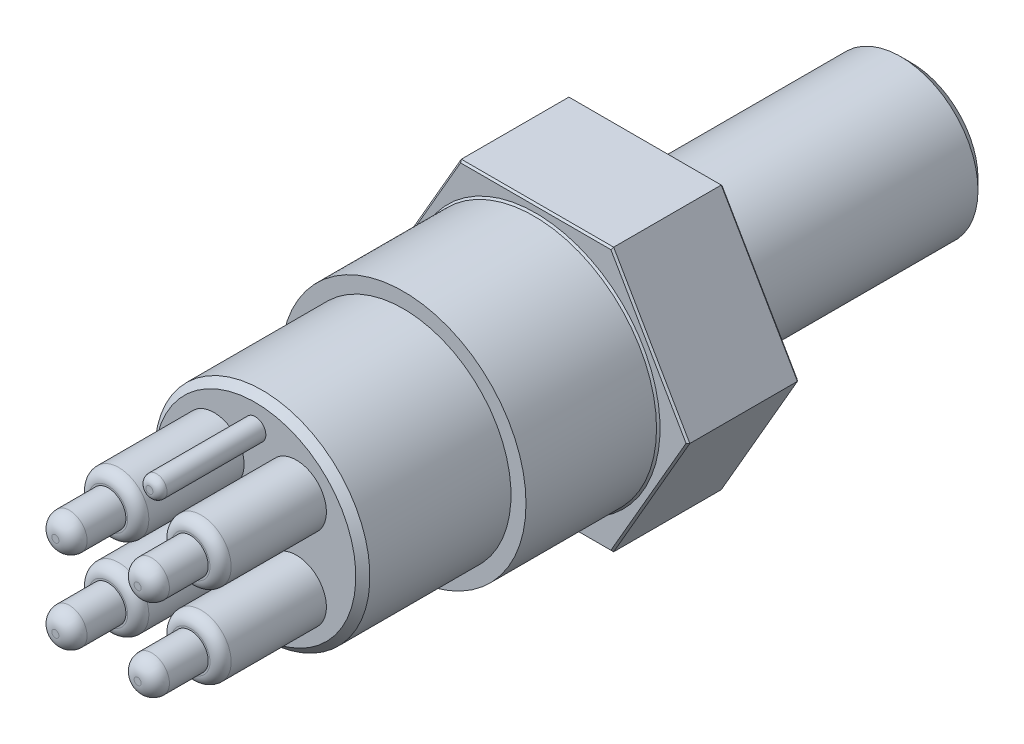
ISO-10303-21;
HEADER;
FILE_DESCRIPTION(('STEP AP214'),'2;1');
FILE_NAME('part.step','',(''),(''),'','','');
FILE_SCHEMA(('AUTOMOTIVE_DESIGN { 1 0 10303 214 1 1 1 1 }'));
ENDSEC;
DATA;
#1=APPLICATION_CONTEXT('core data for automotive mechanical design processes');
#2=APPLICATION_PROTOCOL_DEFINITION('international standard','automotive_design',2000,#1);
#3=PRODUCT_CONTEXT('',#1,'mechanical');
#4=PRODUCT('Part','Part','',(#3));
#5=PRODUCT_RELATED_PRODUCT_CATEGORY('part','',(#4));
#6=PRODUCT_DEFINITION_FORMATION('','',#4);
#7=PRODUCT_DEFINITION_CONTEXT('part definition',#1,'design');
#8=PRODUCT_DEFINITION('design','',#6,#7);
#9=PRODUCT_DEFINITION_SHAPE('','',#8);
#10=(LENGTH_UNIT() NAMED_UNIT(*) SI_UNIT(.MILLI.,.METRE.));
#11=(NAMED_UNIT(*) PLANE_ANGLE_UNIT() SI_UNIT($,.RADIAN.));
#12=(NAMED_UNIT(*) SI_UNIT($,.STERADIAN.) SOLID_ANGLE_UNIT());
#13=UNCERTAINTY_MEASURE_WITH_UNIT(LENGTH_MEASURE(1.E-05),#10,'distance_accuracy_value','');
#14=(GEOMETRIC_REPRESENTATION_CONTEXT(3) GLOBAL_UNCERTAINTY_ASSIGNED_CONTEXT((#13)) GLOBAL_UNIT_ASSIGNED_CONTEXT((#10,
#11,#12)) REPRESENTATION_CONTEXT('',''));
#15=CARTESIAN_POINT('',(0.,0.,0.));
#16=DIRECTION('',(0.,0.,1.));
#17=DIRECTION('',(1.,0.,0.));
#18=AXIS2_PLACEMENT_3D('',#15,#16,#17);
#19=CARTESIAN_POINT('',(2.96348451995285,-2.96348451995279,35.814));
#20=DIRECTION('',(0.,0.,1.));
#21=DIRECTION('',(1.,0.,0.));
#22=AXIS2_PLACEMENT_3D('',#19,#20,#21);
#23=PLANE('',#22);
#24=CARTESIAN_POINT('',(2.96348451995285,-2.96348451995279,35.814));
#25=DIRECTION('',(0.,0.,1.));
#26=DIRECTION('',(1.,0.,0.));
#27=AXIS2_PLACEMENT_3D('',#24,#25,#26);
#28=CIRCLE('',#27,1.397);
#29=CARTESIAN_POINT('',(4.36048451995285,-2.96348451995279,35.814));
#30=VERTEX_POINT('',#29);
#31=EDGE_CURVE('E279',#30,#30,#28,.T.);
#32=ORIENTED_EDGE('',*,*,#31,.T.);
#33=EDGE_LOOP('',(#32));
#34=FACE_BOUND('',#33,.T.);
#35=CARTESIAN_POINT('',(2.96348451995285,-2.96348451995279,35.814));
#36=DIRECTION('',(0.,0.,1.));
#37=DIRECTION('',(1.,0.,0.));
#38=AXIS2_PLACEMENT_3D('',#35,#36,#37);
#39=CIRCLE('',#38,1.27);
#40=CARTESIAN_POINT('',(1.69348451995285,-2.96348451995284,35.814));
#41=VERTEX_POINT('',#40);
#42=EDGE_CURVE('E606',#41,#41,#39,.T.);
#43=ORIENTED_EDGE('',*,*,#42,.F.);
#44=EDGE_LOOP('',(#43));
#45=FACE_BOUND('',#44,.T.);
#46=ADVANCED_FACE('F49',(#34,#45),#23,.T.);
#47=CARTESIAN_POINT('',(2.96348451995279,2.96348451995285,35.814));
#48=DIRECTION('',(0.,0.,1.));
#49=DIRECTION('',(1.,0.,0.));
#50=AXIS2_PLACEMENT_3D('',#47,#48,#49);
#51=PLANE('',#50);
#52=CARTESIAN_POINT('',(2.96348451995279,2.96348451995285,35.814));
#53=DIRECTION('',(0.,0.,1.));
#54=DIRECTION('',(1.,0.,0.));
#55=AXIS2_PLACEMENT_3D('',#52,#53,#54);
#56=CIRCLE('',#55,1.397);
#57=CARTESIAN_POINT('',(4.36048451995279,2.96348451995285,35.814));
#58=VERTEX_POINT('',#57);
#59=EDGE_CURVE('E287',#58,#58,#56,.T.);
#60=ORIENTED_EDGE('',*,*,#59,.T.);
#61=EDGE_LOOP('',(#60));
#62=FACE_BOUND('',#61,.T.);
#63=CARTESIAN_POINT('',(2.96348451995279,2.96348451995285,35.814));
#64=DIRECTION('',(0.,0.,1.));
#65=DIRECTION('',(1.,0.,0.));
#66=AXIS2_PLACEMENT_3D('',#63,#64,#65);
#67=CIRCLE('',#66,1.27);
#68=CARTESIAN_POINT('',(1.69348451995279,2.96348451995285,35.814));
#69=VERTEX_POINT('',#68);
#70=EDGE_CURVE('E602',#69,#69,#67,.T.);
#71=ORIENTED_EDGE('',*,*,#70,.F.);
#72=EDGE_LOOP('',(#71));
#73=FACE_BOUND('',#72,.T.);
#74=ADVANCED_FACE('F323',(#62,#73),#51,.T.);
#75=CARTESIAN_POINT('',(-2.96348451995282,-2.96348451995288,35.814));
#76=DIRECTION('',(0.,0.,1.));
#77=DIRECTION('',(1.,0.,0.));
#78=AXIS2_PLACEMENT_3D('',#75,#76,#77);
#79=PLANE('',#78);
#80=CARTESIAN_POINT('',(-2.96348451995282,-2.96348451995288,35.814));
#81=DIRECTION('',(0.,0.,1.));
#82=DIRECTION('',(1.,0.,0.));
#83=AXIS2_PLACEMENT_3D('',#80,#81,#82);
#84=CIRCLE('',#83,1.397);
#85=CARTESIAN_POINT('',(-1.56648451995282,-2.96348451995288,35.814));
#86=VERTEX_POINT('',#85);
#87=EDGE_CURVE('E295',#86,#86,#84,.T.);
#88=ORIENTED_EDGE('',*,*,#87,.T.);
#89=EDGE_LOOP('',(#88));
#90=FACE_BOUND('',#89,.T.);
#91=CARTESIAN_POINT('',(-2.96348451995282,-2.96348451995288,35.814));
#92=DIRECTION('',(0.,0.,1.));
#93=DIRECTION('',(1.,0.,0.));
#94=AXIS2_PLACEMENT_3D('',#91,#92,#93);
#95=CIRCLE('',#94,1.27);
#96=CARTESIAN_POINT('',(-4.23348451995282,-2.96348451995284,35.814));
#97=VERTEX_POINT('',#96);
#98=EDGE_CURVE('E598',#97,#97,#95,.T.);
#99=ORIENTED_EDGE('',*,*,#98,.F.);
#100=EDGE_LOOP('',(#99));
#101=FACE_BOUND('',#100,.T.);
#102=ADVANCED_FACE('F329',(#90,#101),#79,.T.);
#103=CARTESIAN_POINT('',(-2.96348451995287,2.96348451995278,35.814));
#104=DIRECTION('',(0.,0.,1.));
#105=DIRECTION('',(1.,0.,0.));
#106=AXIS2_PLACEMENT_3D('',#103,#104,#105);
#107=PLANE('',#106);
#108=CARTESIAN_POINT('',(-2.96348451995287,2.96348451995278,35.814));
#109=DIRECTION('',(0.,0.,1.));
#110=DIRECTION('',(1.,0.,0.));
#111=AXIS2_PLACEMENT_3D('',#108,#109,#110);
#112=CIRCLE('',#111,1.397);
#113=CARTESIAN_POINT('',(-1.56648451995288,2.96348451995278,35.814));
#114=VERTEX_POINT('',#113);
#115=EDGE_CURVE('E58',#114,#114,#112,.T.);
#116=ORIENTED_EDGE('',*,*,#115,.T.);
#117=EDGE_LOOP('',(#116));
#118=FACE_BOUND('',#117,.T.);
#119=CARTESIAN_POINT('',(-2.96348451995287,2.96348451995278,35.814));
#120=DIRECTION('',(0.,0.,1.));
#121=DIRECTION('',(1.,0.,0.));
#122=AXIS2_PLACEMENT_3D('',#119,#120,#121);
#123=CIRCLE('',#122,1.27);
#124=CARTESIAN_POINT('',(-4.23348451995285,2.96348451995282,35.814));
#125=VERTEX_POINT('',#124);
#126=EDGE_CURVE('E594',#125,#125,#123,.T.);
#127=ORIENTED_EDGE('',*,*,#126,.F.);
#128=EDGE_LOOP('',(#127));
#129=FACE_BOUND('',#128,.T.);
#130=ADVANCED_FACE('F307',(#118,#129),#107,.T.);
#131=CARTESIAN_POINT('',(0.,0.,28.194));
#132=DIRECTION('',(0.,0.,1.));
#133=DIRECTION('',(1.,0.,0.));
#134=AXIS2_PLACEMENT_3D('',#131,#132,#133);
#135=PLANE('',#134);
#136=CARTESIAN_POINT('',(-2.96348451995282,-2.96348451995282,28.194));
#137=DIRECTION('',(0.,0.,1.));
#138=DIRECTION('',(1.,0.,0.));
#139=AXIS2_PLACEMENT_3D('',#136,#137,#138);
#140=CIRCLE('',#139,2.159);
#141=CARTESIAN_POINT('',(-5.12248451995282,-2.96348451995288,28.194));
#142=VERTEX_POINT('',#141);
#143=EDGE_CURVE('E586',#142,#142,#140,.T.);
#144=ORIENTED_EDGE('',*,*,#143,.F.);
#145=EDGE_LOOP('',(#144));
#146=FACE_BOUND('',#145,.T.);
#147=CARTESIAN_POINT('',(0.,5.58799999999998,28.194));
#148=DIRECTION('',(0.,0.,1.));
#149=DIRECTION('',(1.,0.,0.));
#150=AXIS2_PLACEMENT_3D('',#147,#148,#149);
#151=CIRCLE('',#150,0.762);
#152=CARTESIAN_POINT('',(-0.762,5.58800000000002,28.194));
#153=VERTEX_POINT('',#152);
#154=EDGE_CURVE('E578',#153,#153,#151,.T.);
#155=ORIENTED_EDGE('',*,*,#154,.F.);
#156=EDGE_LOOP('',(#155));
#157=FACE_BOUND('',#156,.T.);
#158=CARTESIAN_POINT('',(0.,0.,28.194));
#159=DIRECTION('',(0.,0.,1.));
#160=DIRECTION('',(1.,0.,0.));
#161=AXIS2_PLACEMENT_3D('',#158,#159,#160);
#162=CIRCLE('',#161,7.239);
#163=CARTESIAN_POINT('',(-7.239,0.,28.194));
#164=VERTEX_POINT('',#163);
#165=EDGE_CURVE('E231',#164,#164,#162,.T.);
#166=ORIENTED_EDGE('',*,*,#165,.T.);
#167=EDGE_LOOP('',(#166));
#168=FACE_BOUND('',#167,.T.);
#169=CARTESIAN_POINT('',(2.96348451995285,-2.96348451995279,28.194));
#170=DIRECTION('',(0.,0.,1.));
#171=DIRECTION('',(1.,0.,0.));
#172=AXIS2_PLACEMENT_3D('',#169,#170,#171);
#173=CIRCLE('',#172,2.159);
#174=CARTESIAN_POINT('',(0.804484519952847,-2.96348451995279,28.194));
#175=VERTEX_POINT('',#174);
#176=EDGE_CURVE('E547',#175,#175,#173,.T.);
#177=ORIENTED_EDGE('',*,*,#176,.F.);
#178=EDGE_LOOP('',(#177));
#179=FACE_BOUND('',#178,.T.);
#180=CARTESIAN_POINT('',(-2.96348451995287,2.96348451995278,28.194));
#181=DIRECTION('',(0.,0.,1.));
#182=DIRECTION('',(1.,0.,0.));
#183=AXIS2_PLACEMENT_3D('',#180,#181,#182);
#184=CIRCLE('',#183,2.159);
#185=CARTESIAN_POINT('',(-5.12248451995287,2.96348451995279,28.194));
#186=VERTEX_POINT('',#185);
#187=EDGE_CURVE('E582',#186,#186,#184,.T.);
#188=ORIENTED_EDGE('',*,*,#187,.F.);
#189=EDGE_LOOP('',(#188));
#190=FACE_BOUND('',#189,.T.);
#191=CARTESIAN_POINT('',(2.96348451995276,2.96348451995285,28.194));
#192=DIRECTION('',(0.,0.,1.));
#193=DIRECTION('',(1.,0.,0.));
#194=AXIS2_PLACEMENT_3D('',#191,#192,#193);
#195=CIRCLE('',#194,2.159);
#196=CARTESIAN_POINT('',(0.804484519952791,2.96348451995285,28.194));
#197=VERTEX_POINT('',#196);
#198=EDGE_CURVE('E590',#197,#197,#195,.T.);
#199=ORIENTED_EDGE('',*,*,#198,.F.);
#200=EDGE_LOOP('',(#199));
#201=FACE_BOUND('',#200,.T.);
#202=ADVANCED_FACE('F346',(#146,#157,#168,#179,#190,#201),#135,.T.);
#203=CARTESIAN_POINT('',(0.,0.,17.526));
#204=DIRECTION('',(0.,0.,1.));
#205=DIRECTION('',(1.,0.,0.));
#206=AXIS2_PLACEMENT_3D('',#203,#204,#205);
#207=PLANE('',#206);
#208=CARTESIAN_POINT('',(0.,0.,17.526));
#209=DIRECTION('',(0.,0.,1.));
#210=DIRECTION('',(1.,0.,0.));
#211=AXIS2_PLACEMENT_3D('',#208,#209,#210);
#212=CIRCLE('',#211,8.8265);
#213=CARTESIAN_POINT('',(-8.8265,0.,17.526));
#214=VERTEX_POINT('',#213);
#215=EDGE_CURVE('E493',#214,#214,#212,.T.);
#216=ORIENTED_EDGE('',*,*,#215,.T.);
#217=EDGE_LOOP('',(#216));
#218=FACE_BOUND('',#217,.T.);
#219=CARTESIAN_POINT('',(0.,0.,17.526));
#220=DIRECTION('',(0.,0.,1.));
#221=DIRECTION('',(1.,0.,0.));
#222=AXIS2_PLACEMENT_3D('',#219,#220,#221);
#223=CIRCLE('',#222,7.747);
#224=CARTESIAN_POINT('',(-7.747,0.,17.526));
#225=VERTEX_POINT('',#224);
#226=EDGE_CURVE('E538',#225,#225,#223,.T.);
#227=ORIENTED_EDGE('',*,*,#226,.F.);
#228=EDGE_LOOP('',(#227));
#229=FACE_BOUND('',#228,.T.);
#230=ADVANCED_FACE('F349',(#218,#229),#207,.T.);
#231=CARTESIAN_POINT('',(5.48459661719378,9.4996,8.00099999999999));
#232=DIRECTION('',(0.,0.,-1.));
#233=DIRECTION('',(-1.,0.,0.));
#234=AXIS2_PLACEMENT_3D('',#231,#232,#233);
#235=PLANE('',#234);
#236=CARTESIAN_POINT('',(0.,0.,8.00099999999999));
#237=DIRECTION('',(0.,0.,-1.));
#238=DIRECTION('',(-1.,0.,0.));
#239=AXIS2_PLACEMENT_3D('',#236,#237,#238);
#240=CIRCLE('',#239,8.95350000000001);
#241=CARTESIAN_POINT('',(-8.9535,0.,8.00099999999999));
#242=VERTEX_POINT('',#241);
#243=EDGE_CURVE('E168',#242,#242,#240,.T.);
#244=ORIENTED_EDGE('',*,*,#243,.T.);
#245=EDGE_LOOP('',(#244));
#246=FACE_BOUND('',#245,.T.);
#247=DIRECTION('',(0.5,0.866025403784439,0.));
#248=VECTOR('',#247,1.);
#249=CARTESIAN_POINT('',(13.6015063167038,4.81329999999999,8.00099999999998));
#250=LINE('',#249,#248);
#251=CARTESIAN_POINT('',(5.41127313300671,-9.37260000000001,8.00099999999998));
#252=VERTEX_POINT('',#251);
#253=CARTESIAN_POINT('',(10.8225462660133,0.,8.00099999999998));
#254=VERTEX_POINT('',#253);
#255=EDGE_CURVE('E165',#252,#254,#250,.T.);
#256=ORIENTED_EDGE('',*,*,#255,.T.);
#257=DIRECTION('',(-0.5,0.866025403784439,0.));
#258=VECTOR('',#257,1.);
#259=CARTESIAN_POINT('',(5.37461139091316,9.4361,8.00099999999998));
#260=LINE('',#259,#258);
#261=CARTESIAN_POINT('',(5.41127313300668,9.37260000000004,8.00099999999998));
#262=VERTEX_POINT('',#261);
#263=EDGE_CURVE('E143',#254,#262,#260,.T.);
#264=ORIENTED_EDGE('',*,*,#263,.T.);
#265=DIRECTION('',(-1.,0.,0.));
#266=VECTOR('',#265,1.);
#267=CARTESIAN_POINT('',(5.48459661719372,9.37259999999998,8.00099999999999));
#268=LINE('',#267,#266);
#269=CARTESIAN_POINT('',(-5.41127313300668,9.37259999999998,8.00099999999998));
#270=VERTEX_POINT('',#269);
#271=EDGE_CURVE('E153',#262,#270,#268,.T.);
#272=ORIENTED_EDGE('',*,*,#271,.T.);
#273=DIRECTION('',(-0.5,-0.866025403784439,0.));
#274=VECTOR('',#273,1.);
#275=CARTESIAN_POINT('',(-2.63231308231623,14.1859,8.00099999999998));
#276=LINE('',#275,#274);
#277=CARTESIAN_POINT('',(-10.8225462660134,0.,8.00099999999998));
#278=VERTEX_POINT('',#277);
#279=EDGE_CURVE('E160',#270,#278,#276,.T.);
#280=ORIENTED_EDGE('',*,*,#279,.T.);
#281=DIRECTION('',(0.5,-0.866025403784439,0.));
#282=VECTOR('',#281,1.);
#283=CARTESIAN_POINT('',(-10.8592080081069,0.0634999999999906,8.00099999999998));
#284=LINE('',#283,#282);
#285=CARTESIAN_POINT('',(-5.41127313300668,-9.37259999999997,8.00099999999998));
#286=VERTEX_POINT('',#285);
#287=EDGE_CURVE('E464',#278,#286,#284,.T.);
#288=ORIENTED_EDGE('',*,*,#287,.T.);
#289=DIRECTION('',(1.,0.,0.));
#290=VECTOR('',#289,1.);
#291=CARTESIAN_POINT('',(5.48459661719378,-9.37259999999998,8.00099999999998));
#292=LINE('',#291,#290);
#293=EDGE_CURVE('E176',#286,#252,#292,.T.);
#294=ORIENTED_EDGE('',*,*,#293,.T.);
#295=EDGE_LOOP('',(#256,#264,#272,#280,#288,#294));
#296=FACE_BOUND('',#295,.T.);
#297=ADVANCED_FACE('F163',(#246,#296),#235,.F.);
#298=CARTESIAN_POINT('',(0.,0.,-19.05));
#299=DIRECTION('',(0.,0.,1.));
#300=DIRECTION('',(1.,0.,0.));
#301=AXIS2_PLACEMENT_3D('',#298,#299,#300);
#302=CYLINDRICAL_SURFACE('',#301,5.55625);
#303=CARTESIAN_POINT('',(0.,0.,-18.288));
#304=DIRECTION('',(0.,0.,1.));
#305=DIRECTION('',(1.,0.,0.));
#306=AXIS2_PLACEMENT_3D('',#303,#304,#305);
#307=CIRCLE('',#306,5.55625);
#308=CARTESIAN_POINT('',(5.55625,0.,-18.288));
#309=VERTEX_POINT('',#308);
#310=EDGE_CURVE('E450',#309,#309,#307,.T.);
#311=CARTESIAN_POINT('',(0.,0.,0.));
#312=DIRECTION('',(0.,0.,1.));
#313=DIRECTION('',(1.,0.,0.));
#314=AXIS2_PLACEMENT_3D('',#311,#312,#313);
#315=CIRCLE('',#314,5.55625);
#316=CARTESIAN_POINT('',(5.55625,0.,0.));
#317=VERTEX_POINT('',#316);
#318=EDGE_CURVE('E458',#317,#317,#315,.T.);
#319=CARTESIAN_POINT('',(5.55625,0.,-18.288));
#320=CARTESIAN_POINT('',(5.55625,0.,-18.0975));
#321=CARTESIAN_POINT('',(5.55625,0.,-17.907));
#322=CARTESIAN_POINT('',(5.55625,0.,-17.526));
#323=CARTESIAN_POINT('',(5.55625,0.,-17.3355));
#324=CARTESIAN_POINT('',(5.55625,0.,-16.9545));
#325=CARTESIAN_POINT('',(5.55625,0.,-16.764));
#326=CARTESIAN_POINT('',(5.55625,0.,-16.383));
#327=CARTESIAN_POINT('',(5.55625,0.,-16.1925));
#328=CARTESIAN_POINT('',(5.55625,0.,-15.8115));
#329=CARTESIAN_POINT('',(5.55625,0.,-15.621));
#330=CARTESIAN_POINT('',(5.55625,0.,-15.24));
#331=CARTESIAN_POINT('',(5.55625,0.,-15.0495));
#332=CARTESIAN_POINT('',(5.55625,0.,-14.6685));
#333=CARTESIAN_POINT('',(5.55625,0.,-14.478));
#334=CARTESIAN_POINT('',(5.55625,0.,-14.097));
#335=CARTESIAN_POINT('',(5.55625,0.,-13.9065));
#336=CARTESIAN_POINT('',(5.55625,0.,-13.5255));
#337=CARTESIAN_POINT('',(5.55625,0.,-13.335));
#338=CARTESIAN_POINT('',(5.55625,0.,-12.954));
#339=CARTESIAN_POINT('',(5.55625,0.,-12.7635));
#340=CARTESIAN_POINT('',(5.55625,0.,-12.3825));
#341=CARTESIAN_POINT('',(5.55625,0.,-12.192));
#342=CARTESIAN_POINT('',(5.55625,0.,-11.811));
#343=CARTESIAN_POINT('',(5.55625,0.,-11.6205));
#344=CARTESIAN_POINT('',(5.55625,0.,-11.2395));
#345=CARTESIAN_POINT('',(5.55625,0.,-11.049));
#346=CARTESIAN_POINT('',(5.55625,0.,-10.668));
#347=CARTESIAN_POINT('',(5.55625,0.,-10.4775));
#348=CARTESIAN_POINT('',(5.55625,0.,-10.0965));
#349=CARTESIAN_POINT('',(5.55625,0.,-9.90600000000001));
#350=CARTESIAN_POINT('',(5.55625,0.,-9.52500000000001));
#351=CARTESIAN_POINT('',(5.55625,0.,-9.33450000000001));
#352=CARTESIAN_POINT('',(5.55625,0.,-8.95350000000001));
#353=CARTESIAN_POINT('',(5.55625,0.,-8.76300000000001));
#354=CARTESIAN_POINT('',(5.55625,0.,-8.38200000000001));
#355=CARTESIAN_POINT('',(5.55625,0.,-8.19150000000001));
#356=CARTESIAN_POINT('',(5.55625,0.,-7.81050000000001));
#357=CARTESIAN_POINT('',(5.55625,0.,-7.62000000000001));
#358=CARTESIAN_POINT('',(5.55625,0.,-7.23900000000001));
#359=CARTESIAN_POINT('',(5.55625,0.,-7.04850000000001));
#360=CARTESIAN_POINT('',(5.55625,0.,-6.66750000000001));
#361=CARTESIAN_POINT('',(5.55625,0.,-6.47700000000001));
#362=CARTESIAN_POINT('',(5.55625,0.,-6.09600000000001));
#363=CARTESIAN_POINT('',(5.55625,0.,-5.90550000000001));
#364=CARTESIAN_POINT('',(5.55625,0.,-5.52450000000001));
#365=CARTESIAN_POINT('',(5.55625,0.,-5.33400000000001));
#366=CARTESIAN_POINT('',(5.55625,0.,-4.95300000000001));
#367=CARTESIAN_POINT('',(5.55625,0.,-4.76250000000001));
#368=CARTESIAN_POINT('',(5.55625,0.,-4.38150000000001));
#369=CARTESIAN_POINT('',(5.55625,0.,-4.19100000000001));
#370=CARTESIAN_POINT('',(5.55625,0.,-3.81000000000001));
#371=CARTESIAN_POINT('',(5.55625,0.,-3.61950000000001));
#372=CARTESIAN_POINT('',(5.55625,0.,-3.23850000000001));
#373=CARTESIAN_POINT('',(5.55625,0.,-3.04800000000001));
#374=CARTESIAN_POINT('',(5.55625,0.,-2.66700000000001));
#375=CARTESIAN_POINT('',(5.55625,0.,-2.47650000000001));
#376=CARTESIAN_POINT('',(5.55625,0.,-2.09550000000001));
#377=CARTESIAN_POINT('',(5.55625,0.,-1.905));
#378=CARTESIAN_POINT('',(5.55625,0.,-1.524));
#379=CARTESIAN_POINT('',(5.55625,0.,-1.3335));
#380=CARTESIAN_POINT('',(5.55625,0.,-0.952500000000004));
#381=CARTESIAN_POINT('',(5.55625,0.,-0.762000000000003));
#382=CARTESIAN_POINT('',(5.55625,0.,-0.381000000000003));
#383=CARTESIAN_POINT('',(5.55625,0.,-0.190500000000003));
#384=CARTESIAN_POINT('',(5.55625,0.,0.));
#385=B_SPLINE_CURVE_WITH_KNOTS('',3,(#319,#320,#321,#322,#323,#324,#325,#326,#327,#328,#329,
#330,#331,#332,#333,#334,#335,#336,#337,#338,#339,#340,#341,#342,#343,#344,#345,#346,#347,#348,
#349,#350,#351,#352,#353,#354,#355,#356,#357,#358,#359,#360,#361,#362,#363,#364,#365,#366,#367,
#368,#369,#370,#371,#372,#373,#374,#375,#376,#377,#378,#379,#380,#381,#382,#383,#384),
.UNSPECIFIED.,.F.,.F.,(4,2,2,2,2,2,2,2,2,2,2,2,2,2,2,2,2,2,2,2,2,2,2,2,2,2,2,2,2,2,2,2,4),(0.,
0.571499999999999,1.143,1.7145,2.286,2.8575,3.429,4.0005,4.572,5.1435,5.715,6.2865,6.858,7.4295,
8.001,8.5725,9.144,9.7155,10.287,10.8585,11.43,12.0015,12.573,13.1445,13.716,14.2875,14.859,
15.4305,16.002,16.5735,17.145,17.7165,18.288),.UNSPECIFIED.);
#386=EDGE_CURVE('BSEAM51',#309,#317,#385,.T.);
#387=ORIENTED_EDGE('',*,*,#310,.T.);
#388=ORIENTED_EDGE('',*,*,#318,.F.);
#389=ORIENTED_EDGE('',*,*,#386,.T.);
#390=ORIENTED_EDGE('',*,*,#386,.F.);
#391=EDGE_LOOP('',(#387,#389,#388,#390));
#392=FACE_BOUND('',#391,.T.);
#393=ADVANCED_FACE('F51',(#392),#302,.T.);
#394=CARTESIAN_POINT('',(0.,0.,-19.05));
#395=DIRECTION('',(0.,0.,1.));
#396=DIRECTION('',(1.,0.,0.));
#397=AXIS2_PLACEMENT_3D('',#394,#395,#396);
#398=PLANE('',#397);
#399=CARTESIAN_POINT('',(0.,0.,-19.05));
#400=DIRECTION('',(0.,0.,1.));
#401=DIRECTION('',(1.,0.,0.));
#402=AXIS2_PLACEMENT_3D('',#399,#400,#401);
#403=CIRCLE('',#402,4.79425);
#404=CARTESIAN_POINT('',(4.79425000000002,0.,-19.05));
#405=VERTEX_POINT('',#404);
#406=EDGE_CURVE('E448',#405,#405,#403,.F.);
#407=ORIENTED_EDGE('',*,*,#406,.T.);
#408=EDGE_LOOP('',(#407));
#409=FACE_BOUND('',#408,.T.);
#410=ADVANCED_FACE('F438',(#409),#398,.F.);
#411=CARTESIAN_POINT('',(0.,0.,-18.288));
#412=DIRECTION('',(0.,0.,1.));
#413=DIRECTION('',(1.,0.,0.));
#414=AXIS2_PLACEMENT_3D('',#411,#412,#413);
#415=CONICAL_SURFACE('',#414,5.55625,0.785398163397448);
#416=CARTESIAN_POINT('',(4.79425000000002,0.,-19.05));
#417=CARTESIAN_POINT('',(4.80218750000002,0.,-19.0420625));
#418=CARTESIAN_POINT('',(4.81012500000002,0.,-19.034125));
#419=CARTESIAN_POINT('',(4.82600000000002,0.,-19.01825));
#420=CARTESIAN_POINT('',(4.83393750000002,0.,-19.0103125));
#421=CARTESIAN_POINT('',(4.84981250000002,0.,-18.9944375));
#422=CARTESIAN_POINT('',(4.85775000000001,0.,-18.9865));
#423=CARTESIAN_POINT('',(4.87362500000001,0.,-18.970625));
#424=CARTESIAN_POINT('',(4.88156250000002,0.,-18.9626875));
#425=CARTESIAN_POINT('',(4.89743750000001,0.,-18.9468125));
#426=CARTESIAN_POINT('',(4.90537500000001,0.,-18.938875));
#427=CARTESIAN_POINT('',(4.92125000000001,0.,-18.923));
#428=CARTESIAN_POINT('',(4.92918750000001,0.,-18.9150625));
#429=CARTESIAN_POINT('',(4.94506250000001,0.,-18.8991875));
#430=CARTESIAN_POINT('',(4.95300000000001,0.,-18.89125));
#431=CARTESIAN_POINT('',(4.96887500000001,0.,-18.875375));
#432=CARTESIAN_POINT('',(4.97681250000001,0.,-18.8674375));
#433=CARTESIAN_POINT('',(4.99268750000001,0.,-18.8515625));
#434=CARTESIAN_POINT('',(5.00062500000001,0.,-18.843625));
#435=CARTESIAN_POINT('',(5.01650000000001,0.,-18.82775));
#436=CARTESIAN_POINT('',(5.02443750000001,0.,-18.8198125));
#437=CARTESIAN_POINT('',(5.04031250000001,0.,-18.8039375));
#438=CARTESIAN_POINT('',(5.04825000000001,0.,-18.796));
#439=CARTESIAN_POINT('',(5.06412500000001,0.,-18.780125));
#440=CARTESIAN_POINT('',(5.07206250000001,0.,-18.7721875));
#441=CARTESIAN_POINT('',(5.08793750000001,0.,-18.7563125));
#442=CARTESIAN_POINT('',(5.09587500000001,0.,-18.748375));
#443=CARTESIAN_POINT('',(5.11175000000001,0.,-18.7325));
#444=CARTESIAN_POINT('',(5.11968750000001,0.,-18.7245625));
#445=CARTESIAN_POINT('',(5.13556250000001,0.,-18.7086875));
#446=CARTESIAN_POINT('',(5.14350000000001,0.,-18.70075));
#447=CARTESIAN_POINT('',(5.15937500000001,0.,-18.684875));
#448=CARTESIAN_POINT('',(5.16731250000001,0.,-18.6769375));
#449=CARTESIAN_POINT('',(5.18318750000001,0.,-18.6610625));
#450=CARTESIAN_POINT('',(5.19112500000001,0.,-18.653125));
#451=CARTESIAN_POINT('',(5.20700000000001,0.,-18.63725));
#452=CARTESIAN_POINT('',(5.21493750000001,0.,-18.6293125));
#453=CARTESIAN_POINT('',(5.23081250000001,0.,-18.6134375));
#454=CARTESIAN_POINT('',(5.23875000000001,0.,-18.6055));
#455=CARTESIAN_POINT('',(5.25462500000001,0.,-18.589625));
#456=CARTESIAN_POINT('',(5.2625625,0.,-18.5816875));
#457=CARTESIAN_POINT('',(5.2784375,0.,-18.5658125));
#458=CARTESIAN_POINT('',(5.286375,0.,-18.557875));
#459=CARTESIAN_POINT('',(5.30225,0.,-18.542));
#460=CARTESIAN_POINT('',(5.3101875,0.,-18.5340625));
#461=CARTESIAN_POINT('',(5.3260625,0.,-18.5181875));
#462=CARTESIAN_POINT('',(5.334,0.,-18.51025));
#463=CARTESIAN_POINT('',(5.349875,0.,-18.494375));
#464=CARTESIAN_POINT('',(5.3578125,0.,-18.4864375));
#465=CARTESIAN_POINT('',(5.3736875,0.,-18.4705625));
#466=CARTESIAN_POINT('',(5.381625,0.,-18.462625));
#467=CARTESIAN_POINT('',(5.3975,0.,-18.44675));
#468=CARTESIAN_POINT('',(5.4054375,0.,-18.4388125));
#469=CARTESIAN_POINT('',(5.4213125,0.,-18.4229375));
#470=CARTESIAN_POINT('',(5.42925,0.,-18.415));
#471=CARTESIAN_POINT('',(5.445125,0.,-18.399125));
#472=CARTESIAN_POINT('',(5.4530625,0.,-18.3911875));
#473=CARTESIAN_POINT('',(5.4689375,0.,-18.3753125));
#474=CARTESIAN_POINT('',(5.476875,0.,-18.367375));
#475=CARTESIAN_POINT('',(5.49275,0.,-18.3515));
#476=CARTESIAN_POINT('',(5.5006875,0.,-18.3435625));
#477=CARTESIAN_POINT('',(5.5165625,0.,-18.3276875));
#478=CARTESIAN_POINT('',(5.5245,0.,-18.31975));
#479=CARTESIAN_POINT('',(5.540375,0.,-18.303875));
#480=CARTESIAN_POINT('',(5.5483125,0.,-18.2959375));
#481=CARTESIAN_POINT('',(5.55625,0.,-18.288));
#482=B_SPLINE_CURVE_WITH_KNOTS('',3,(#416,#417,#418,#419,#420,#421,#422,#423,#424,#425,#426,
#427,#428,#429,#430,#431,#432,#433,#434,#435,#436,#437,#438,#439,#440,#441,#442,#443,#444,#445,
#446,#447,#448,#449,#450,#451,#452,#453,#454,#455,#456,#457,#458,#459,#460,#461,#462,#463,#464,
#465,#466,#467,#468,#469,#470,#471,#472,#473,#474,#475,#476,#477,#478,#479,#480,#481),
.UNSPECIFIED.,.F.,.F.,(4,2,2,2,2,2,2,2,2,2,2,2,2,2,2,2,2,2,2,2,2,2,2,2,2,2,2,2,2,2,2,2,4),(0.,
0.0336759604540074,0.0673519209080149,0.101027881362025,0.134703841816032,0.168379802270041,
0.202055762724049,0.235731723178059,0.269407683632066,0.303083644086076,0.336759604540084,
0.370435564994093,0.4041115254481,0.43778748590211,0.471463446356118,0.505139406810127,
0.538815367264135,0.572491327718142,0.606167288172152,0.639843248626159,0.673519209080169,
0.707195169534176,0.740871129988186,0.774547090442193,0.808223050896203,0.841899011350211,
0.875574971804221,0.909250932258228,0.942926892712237,0.976602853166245,1.01027881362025,
1.04395477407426,1.07763073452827),.UNSPECIFIED.);
#483=EDGE_CURVE('BSEAM435',#405,#309,#482,.T.);
#484=ORIENTED_EDGE('',*,*,#406,.F.);
#485=ORIENTED_EDGE('',*,*,#310,.F.);
#486=ORIENTED_EDGE('',*,*,#483,.T.);
#487=ORIENTED_EDGE('',*,*,#483,.F.);
#488=EDGE_LOOP('',(#484,#486,#485,#487));
#489=FACE_BOUND('',#488,.T.);
#490=ADVANCED_FACE('F435',(#489),#415,.T.);
#491=CARTESIAN_POINT('',(5.48459661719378,9.4996,8.00099999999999));
#492=DIRECTION('',(0.,-1.,0.));
#493=DIRECTION('',(1.,0.,0.));
#494=AXIS2_PLACEMENT_3D('',#491,#492,#493);
#495=PLANE('',#494);
#496=DIRECTION('',(0.,0.,-1.));
#497=VECTOR('',#496,1.);
#498=CARTESIAN_POINT('',(-5.48459661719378,9.49959999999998,8.00099999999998));
#499=LINE('',#498,#497);
#500=CARTESIAN_POINT('',(-5.48459661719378,9.49959999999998,7.87399999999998));
#501=VERTEX_POINT('',#500);
#502=CARTESIAN_POINT('',(-5.48459661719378,9.49959999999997,0.126999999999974));
#503=VERTEX_POINT('',#502);
#504=EDGE_CURVE('E521',#501,#503,#499,.T.);
#505=ORIENTED_EDGE('',*,*,#504,.F.);
#506=DIRECTION('',(1.,0.,0.));
#507=VECTOR('',#506,1.);
#508=CARTESIAN_POINT('',(5.48459661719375,9.49960000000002,7.87399999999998));
#509=LINE('',#508,#507);
#510=CARTESIAN_POINT('',(5.48459661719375,9.49960000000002,7.87399999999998));
#511=VERTEX_POINT('',#510);
#512=EDGE_CURVE('E215',#501,#511,#509,.T.);
#513=ORIENTED_EDGE('',*,*,#512,.T.);
#514=DIRECTION('',(0.,0.,-1.));
#515=VECTOR('',#514,1.);
#516=CARTESIAN_POINT('',(5.48459661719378,9.4996,8.00099999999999));
#517=LINE('',#516,#515);
#518=CARTESIAN_POINT('',(5.48459661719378,9.49960000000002,0.126999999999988));
#519=VERTEX_POINT('',#518);
#520=EDGE_CURVE('E501',#511,#519,#517,.T.);
#521=ORIENTED_EDGE('',*,*,#520,.T.);
#522=DIRECTION('',(-1.,0.,0.));
#523=VECTOR('',#522,1.);
#524=CARTESIAN_POINT('',(-5.48459661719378,9.49959999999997,0.126999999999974));
#525=LINE('',#524,#523);
#526=EDGE_CURVE('E211',#519,#503,#525,.T.);
#527=ORIENTED_EDGE('',*,*,#526,.T.);
#528=EDGE_LOOP('',(#505,#513,#521,#527));
#529=FACE_BOUND('',#528,.T.);
#530=ADVANCED_FACE('F431',(#529),#495,.F.);
#531=CARTESIAN_POINT('',(-5.48459661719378,9.49959999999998,8.00099999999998));
#532=DIRECTION('',(0.866025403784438,-0.5,0.));
#533=DIRECTION('',(0.5,0.866025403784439,0.));
#534=AXIS2_PLACEMENT_3D('',#531,#532,#533);
#535=PLANE('',#534);
#536=DIRECTION('',(0.,0.,-1.));
#537=VECTOR('',#536,1.);
#538=CARTESIAN_POINT('',(-10.9691932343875,0.,8.00099999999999));
#539=LINE('',#538,#537);
#540=CARTESIAN_POINT('',(-10.9691932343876,0.,7.87399999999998));
#541=VERTEX_POINT('',#540);
#542=CARTESIAN_POINT('',(-10.9691932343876,0.,0.126999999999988));
#543=VERTEX_POINT('',#542);
#544=EDGE_CURVE('E517',#541,#543,#539,.T.);
#545=ORIENTED_EDGE('',*,*,#544,.F.);
#546=DIRECTION('',(0.5,0.866025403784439,0.));
#547=VECTOR('',#546,1.);
#548=CARTESIAN_POINT('',(-5.48459661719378,9.49959999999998,7.87399999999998));
#549=LINE('',#548,#547);
#550=EDGE_CURVE('E208',#541,#501,#549,.T.);
#551=ORIENTED_EDGE('',*,*,#550,.T.);
#552=ORIENTED_EDGE('',*,*,#504,.T.);
#553=DIRECTION('',(-0.377964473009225,-0.654653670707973,-0.654653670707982));
#554=VECTOR('',#553,1.);
#555=CARTESIAN_POINT('',(-3.9175690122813,12.2137714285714,2.84117142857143));
#556=LINE('',#555,#554);
#557=CARTESIAN_POINT('',(-5.55792010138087,9.37260000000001,0.));
#558=VERTEX_POINT('',#557);
#559=EDGE_CURVE('E205',#503,#558,#556,.T.);
#560=ORIENTED_EDGE('',*,*,#559,.T.);
#561=DIRECTION('',(-0.5,-0.866025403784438,0.));
#562=VECTOR('',#561,1.);
#563=CARTESIAN_POINT('',(-5.48459661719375,9.4996,0.));
#564=LINE('',#563,#562);
#565=CARTESIAN_POINT('',(-10.8958697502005,0.127000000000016,0.));
#566=VERTEX_POINT('',#565);
#567=EDGE_CURVE('E497',#558,#566,#564,.T.);
#568=ORIENTED_EDGE('',*,*,#567,.T.);
#569=DIRECTION('',(-0.377964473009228,-0.654653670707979,0.654653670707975));
#570=VECTOR('',#569,1.);
#571=CARTESIAN_POINT('',(-10.9691932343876,0.,0.126999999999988));
#572=LINE('',#571,#570);
#573=EDGE_CURVE('E202',#566,#543,#572,.T.);
#574=ORIENTED_EDGE('',*,*,#573,.T.);
#575=EDGE_LOOP('',(#545,#551,#552,#560,#568,#574));
#576=FACE_BOUND('',#575,.T.);
#577=ADVANCED_FACE('F427',(#576),#535,.F.);
#578=CARTESIAN_POINT('',(-10.9691932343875,0.,8.00099999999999));
#579=DIRECTION('',(0.866025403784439,0.5,0.));
#580=DIRECTION('',(-0.5,0.866025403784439,0.));
#581=AXIS2_PLACEMENT_3D('',#578,#579,#580);
#582=PLANE('',#581);
#583=DIRECTION('',(0.,0.,-1.));
#584=VECTOR('',#583,1.);
#585=CARTESIAN_POINT('',(-5.48459661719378,-9.49959999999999,8.00099999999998));
#586=LINE('',#585,#584);
#587=CARTESIAN_POINT('',(-5.48459661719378,-9.49959999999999,7.87399999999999));
#588=VERTEX_POINT('',#587);
#589=CARTESIAN_POINT('',(-5.4845966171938,-9.49960000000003,0.127000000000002));
#590=VERTEX_POINT('',#589);
#591=EDGE_CURVE('E513',#588,#590,#586,.T.);
#592=ORIENTED_EDGE('',*,*,#591,.F.);
#593=DIRECTION('',(-0.5,0.866025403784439,0.));
#594=VECTOR('',#593,1.);
#595=CARTESIAN_POINT('',(-10.9691932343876,0.,7.87399999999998));
#596=LINE('',#595,#594);
#597=EDGE_CURVE('E199',#588,#541,#596,.T.);
#598=ORIENTED_EDGE('',*,*,#597,.T.);
#599=ORIENTED_EDGE('',*,*,#544,.T.);
#600=DIRECTION('',(0.5,-0.866025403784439,0.));
#601=VECTOR('',#600,1.);
#602=CARTESIAN_POINT('',(-5.4845966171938,-9.49960000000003,0.127000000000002));
#603=LINE('',#602,#601);
#604=EDGE_CURVE('E196',#543,#590,#603,.T.);
#605=ORIENTED_EDGE('',*,*,#604,.T.);
#606=EDGE_LOOP('',(#592,#598,#599,#605));
#607=FACE_BOUND('',#606,.T.);
#608=ADVANCED_FACE('F423',(#607),#582,.F.);
#609=CARTESIAN_POINT('',(-5.48459661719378,-9.49959999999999,8.00099999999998));
#610=DIRECTION('',(0.,1.,0.));
#611=DIRECTION('',(-1.,0.,0.));
#612=AXIS2_PLACEMENT_3D('',#609,#610,#611);
#613=PLANE('',#612);
#614=DIRECTION('',(0.,0.,-1.));
#615=VECTOR('',#614,1.);
#616=CARTESIAN_POINT('',(5.48459661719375,-9.4996,8.00099999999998));
#617=LINE('',#616,#615);
#618=CARTESIAN_POINT('',(5.48459661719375,-9.49960000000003,7.87399999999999));
#619=VERTEX_POINT('',#618);
#620=CARTESIAN_POINT('',(5.48459661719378,-9.49959999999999,0.126999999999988));
#621=VERTEX_POINT('',#620);
#622=EDGE_CURVE('E509',#619,#621,#617,.T.);
#623=ORIENTED_EDGE('',*,*,#622,.F.);
#624=DIRECTION('',(-1.,0.,0.));
#625=VECTOR('',#624,1.);
#626=CARTESIAN_POINT('',(-5.48459661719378,-9.49959999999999,7.87399999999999));
#627=LINE('',#626,#625);
#628=EDGE_CURVE('E193',#619,#588,#627,.T.);
#629=ORIENTED_EDGE('',*,*,#628,.T.);
#630=ORIENTED_EDGE('',*,*,#591,.T.);
#631=DIRECTION('',(1.,0.,0.));
#632=VECTOR('',#631,1.);
#633=CARTESIAN_POINT('',(5.48459661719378,-9.49959999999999,0.126999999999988));
#634=LINE('',#633,#632);
#635=EDGE_CURVE('E190',#590,#621,#634,.T.);
#636=ORIENTED_EDGE('',*,*,#635,.T.);
#637=EDGE_LOOP('',(#623,#629,#630,#636));
#638=FACE_BOUND('',#637,.T.);
#639=ADVANCED_FACE('F419',(#638),#613,.F.);
#640=CARTESIAN_POINT('',(5.48459661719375,-9.4996,8.00099999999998));
#641=DIRECTION('',(-0.866025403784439,0.5,0.));
#642=DIRECTION('',(-0.5,-0.866025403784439,0.));
#643=AXIS2_PLACEMENT_3D('',#640,#641,#642);
#644=PLANE('',#643);
#645=DIRECTION('',(0.,0.,-1.));
#646=VECTOR('',#645,1.);
#647=CARTESIAN_POINT('',(10.9691932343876,0.,8.00099999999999));
#648=LINE('',#647,#646);
#649=CARTESIAN_POINT('',(10.9691932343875,0.,7.87399999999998));
#650=VERTEX_POINT('',#649);
#651=CARTESIAN_POINT('',(10.9691932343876,0.,0.126999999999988));
#652=VERTEX_POINT('',#651);
#653=EDGE_CURVE('E505',#650,#652,#648,.T.);
#654=ORIENTED_EDGE('',*,*,#653,.F.);
#655=DIRECTION('',(-0.5,-0.866025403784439,0.));
#656=VECTOR('',#655,1.);
#657=CARTESIAN_POINT('',(5.48459661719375,-9.49960000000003,7.87399999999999));
#658=LINE('',#657,#656);
#659=EDGE_CURVE('E187',#650,#619,#658,.T.);
#660=ORIENTED_EDGE('',*,*,#659,.T.);
#661=ORIENTED_EDGE('',*,*,#622,.T.);
#662=DIRECTION('',(0.5,0.866025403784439,0.));
#663=VECTOR('',#662,1.);
#664=CARTESIAN_POINT('',(10.9691932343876,0.,0.126999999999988));
#665=LINE('',#664,#663);
#666=EDGE_CURVE('E184',#621,#652,#665,.T.);
#667=ORIENTED_EDGE('',*,*,#666,.T.);
#668=EDGE_LOOP('',(#654,#660,#661,#667));
#669=FACE_BOUND('',#668,.T.);
#670=ADVANCED_FACE('F415',(#669),#644,.F.);
#671=CARTESIAN_POINT('',(10.9691932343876,0.,8.00099999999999));
#672=DIRECTION('',(-0.866025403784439,-0.5,0.));
#673=DIRECTION('',(0.5,-0.866025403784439,0.));
#674=AXIS2_PLACEMENT_3D('',#671,#672,#673);
#675=PLANE('',#674);
#676=ORIENTED_EDGE('',*,*,#520,.F.);
#677=DIRECTION('',(0.5,-0.866025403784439,0.));
#678=VECTOR('',#677,1.);
#679=CARTESIAN_POINT('',(10.9691932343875,0.,7.87399999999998));
#680=LINE('',#679,#678);
#681=EDGE_CURVE('E145',#511,#650,#680,.T.);
#682=ORIENTED_EDGE('',*,*,#681,.T.);
#683=ORIENTED_EDGE('',*,*,#653,.T.);
#684=DIRECTION('',(-0.5,0.866025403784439,0.));
#685=VECTOR('',#684,1.);
#686=CARTESIAN_POINT('',(5.48459661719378,9.49960000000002,0.126999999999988));
#687=LINE('',#686,#685);
#688=EDGE_CURVE('E174',#652,#519,#687,.T.);
#689=ORIENTED_EDGE('',*,*,#688,.T.);
#690=EDGE_LOOP('',(#676,#682,#683,#689));
#691=FACE_BOUND('',#690,.T.);
#692=ADVANCED_FACE('F408',(#691),#675,.F.);
#693=CARTESIAN_POINT('',(5.48459661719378,9.4996,0.));
#694=DIRECTION('',(0.,0.,-1.));
#695=DIRECTION('',(-1.,0.,0.));
#696=AXIS2_PLACEMENT_3D('',#693,#694,#695);
#697=PLANE('',#696);
#698=ORIENTED_EDGE('',*,*,#318,.T.);
#699=EDGE_LOOP('',(#698));
#700=FACE_BOUND('',#699,.T.);
#701=ORIENTED_EDGE('',*,*,#567,.F.);
#702=DIRECTION('',(1.,0.,0.));
#703=VECTOR('',#702,1.);
#704=CARTESIAN_POINT('',(5.48459661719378,9.37259999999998,0.));
#705=LINE('',#704,#703);
#706=CARTESIAN_POINT('',(5.41127313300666,9.37259999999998,0.));
#707=VERTEX_POINT('',#706);
#708=EDGE_CURVE('E65',#558,#707,#705,.T.);
#709=ORIENTED_EDGE('',*,*,#708,.T.);
#710=DIRECTION('',(0.5,-0.866025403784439,0.));
#711=VECTOR('',#710,1.);
#712=CARTESIAN_POINT('',(10.8592080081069,-0.0634999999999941,0.));
#713=LINE('',#712,#711);
#714=CARTESIAN_POINT('',(10.8225462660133,0.,0.));
#715=VERTEX_POINT('',#714);
#716=EDGE_CURVE('E69',#707,#715,#713,.T.);
#717=ORIENTED_EDGE('',*,*,#716,.T.);
#718=DIRECTION('',(-0.5,-0.866025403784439,0.));
#719=VECTOR('',#718,1.);
#720=CARTESIAN_POINT('',(5.37461139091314,-9.43610000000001,0.));
#721=LINE('',#720,#719);
#722=CARTESIAN_POINT('',(5.41127313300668,-9.37260000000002,0.));
#723=VERTEX_POINT('',#722);
#724=EDGE_CURVE('E224',#715,#723,#721,.T.);
#725=ORIENTED_EDGE('',*,*,#724,.T.);
#726=DIRECTION('',(-1.,0.,0.));
#727=VECTOR('',#726,1.);
#728=CARTESIAN_POINT('',(-5.48459661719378,-9.37260000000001,0.));
#729=LINE('',#728,#727);
#730=CARTESIAN_POINT('',(-5.41127313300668,-9.37260000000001,0.));
#731=VERTEX_POINT('',#730);
#732=EDGE_CURVE('E221',#723,#731,#729,.T.);
#733=ORIENTED_EDGE('',*,*,#732,.T.);
#734=DIRECTION('',(-0.5,0.866025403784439,0.));
#735=VECTOR('',#734,1.);
#736=CARTESIAN_POINT('',(-10.8592080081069,0.0634999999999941,0.));
#737=LINE('',#736,#735);
#738=EDGE_CURVE('E218',#731,#566,#737,.T.);
#739=ORIENTED_EDGE('',*,*,#738,.T.);
#740=EDGE_LOOP('',(#701,#709,#717,#725,#733,#739));
#741=FACE_BOUND('',#740,.T.);
#742=ADVANCED_FACE('F404',(#700,#741),#697,.T.);
#743=CARTESIAN_POINT('',(0.,0.,17.526));
#744=DIRECTION('',(0.,0.,-1.));
#745=DIRECTION('',(-1.,0.,0.));
#746=AXIS2_PLACEMENT_3D('',#743,#744,#745);
#747=CYLINDRICAL_SURFACE('',#746,8.8265);
#748=CARTESIAN_POINT('',(0.,0.,8.128));
#749=DIRECTION('',(0.,0.,-1.));
#750=DIRECTION('',(-1.,0.,0.));
#751=AXIS2_PLACEMENT_3D('',#748,#749,#750);
#752=CIRCLE('',#751,8.8265);
#753=CARTESIAN_POINT('',(-8.8265,0.,8.128));
#754=VERTEX_POINT('',#753);
#755=EDGE_CURVE('E161',#754,#754,#752,.F.);
#756=CARTESIAN_POINT('',(-8.8265,0.,8.128));
#757=CARTESIAN_POINT('',(-8.8265,0.,8.22589583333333));
#758=CARTESIAN_POINT('',(-8.8265,0.,8.32379166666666));
#759=CARTESIAN_POINT('',(-8.8265,0.,8.51958333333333));
#760=CARTESIAN_POINT('',(-8.8265,0.,8.61747916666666));
#761=CARTESIAN_POINT('',(-8.8265,0.,8.81327083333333));
#762=CARTESIAN_POINT('',(-8.8265,0.,8.91116666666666));
#763=CARTESIAN_POINT('',(-8.8265,0.,9.10695833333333));
#764=CARTESIAN_POINT('',(-8.8265,0.,9.20485416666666));
#765=CARTESIAN_POINT('',(-8.8265,0.,9.40064583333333));
#766=CARTESIAN_POINT('',(-8.8265,0.,9.49854166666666));
#767=CARTESIAN_POINT('',(-8.8265,0.,9.69433333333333));
#768=CARTESIAN_POINT('',(-8.8265,0.,9.79222916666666));
#769=CARTESIAN_POINT('',(-8.8265,0.,9.98802083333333));
#770=CARTESIAN_POINT('',(-8.8265,0.,10.0859166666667));
#771=CARTESIAN_POINT('',(-8.8265,0.,10.2817083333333));
#772=CARTESIAN_POINT('',(-8.8265,0.,10.3796041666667));
#773=CARTESIAN_POINT('',(-8.8265,0.,10.5753958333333));
#774=CARTESIAN_POINT('',(-8.8265,0.,10.6732916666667));
#775=CARTESIAN_POINT('',(-8.8265,0.,10.8690833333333));
#776=CARTESIAN_POINT('',(-8.8265,0.,10.9669791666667));
#777=CARTESIAN_POINT('',(-8.8265,0.,11.1627708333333));
#778=CARTESIAN_POINT('',(-8.8265,0.,11.2606666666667));
#779=CARTESIAN_POINT('',(-8.8265,0.,11.4564583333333));
#780=CARTESIAN_POINT('',(-8.8265,0.,11.5543541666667));
#781=CARTESIAN_POINT('',(-8.8265,0.,11.7501458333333));
#782=CARTESIAN_POINT('',(-8.8265,0.,11.8480416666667));
#783=CARTESIAN_POINT('',(-8.8265,0.,12.0438333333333));
#784=CARTESIAN_POINT('',(-8.8265,0.,12.1417291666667));
#785=CARTESIAN_POINT('',(-8.8265,0.,12.3375208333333));
#786=CARTESIAN_POINT('',(-8.8265,0.,12.4354166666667));
#787=CARTESIAN_POINT('',(-8.8265,0.,12.6312083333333));
#788=CARTESIAN_POINT('',(-8.8265,0.,12.7291041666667));
#789=CARTESIAN_POINT('',(-8.8265,0.,12.9248958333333));
#790=CARTESIAN_POINT('',(-8.8265,0.,13.0227916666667));
#791=CARTESIAN_POINT('',(-8.8265,0.,13.2185833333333));
#792=CARTESIAN_POINT('',(-8.8265,0.,13.3164791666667));
#793=CARTESIAN_POINT('',(-8.8265,0.,13.5122708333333));
#794=CARTESIAN_POINT('',(-8.8265,0.,13.6101666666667));
#795=CARTESIAN_POINT('',(-8.8265,0.,13.8059583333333));
#796=CARTESIAN_POINT('',(-8.8265,0.,13.9038541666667));
#797=CARTESIAN_POINT('',(-8.8265,0.,14.0996458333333));
#798=CARTESIAN_POINT('',(-8.8265,0.,14.1975416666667));
#799=CARTESIAN_POINT('',(-8.8265,0.,14.3933333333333));
#800=CARTESIAN_POINT('',(-8.8265,0.,14.4912291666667));
#801=CARTESIAN_POINT('',(-8.8265,0.,14.6870208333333));
#802=CARTESIAN_POINT('',(-8.8265,0.,14.7849166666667));
#803=CARTESIAN_POINT('',(-8.8265,0.,14.9807083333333));
#804=CARTESIAN_POINT('',(-8.8265,0.,15.0786041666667));
#805=CARTESIAN_POINT('',(-8.8265,0.,15.2743958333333));
#806=CARTESIAN_POINT('',(-8.8265,0.,15.3722916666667));
#807=CARTESIAN_POINT('',(-8.8265,0.,15.5680833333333));
#808=CARTESIAN_POINT('',(-8.8265,0.,15.6659791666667));
#809=CARTESIAN_POINT('',(-8.8265,0.,15.8617708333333));
#810=CARTESIAN_POINT('',(-8.8265,0.,15.9596666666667));
#811=CARTESIAN_POINT('',(-8.8265,0.,16.1554583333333));
#812=CARTESIAN_POINT('',(-8.8265,0.,16.2533541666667));
#813=CARTESIAN_POINT('',(-8.8265,0.,16.4491458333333));
#814=CARTESIAN_POINT('',(-8.8265,0.,16.5470416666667));
#815=CARTESIAN_POINT('',(-8.8265,0.,16.7428333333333));
#816=CARTESIAN_POINT('',(-8.8265,0.,16.8407291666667));
#817=CARTESIAN_POINT('',(-8.8265,0.,17.0365208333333));
#818=CARTESIAN_POINT('',(-8.8265,0.,17.1344166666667));
#819=CARTESIAN_POINT('',(-8.8265,0.,17.3302083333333));
#820=CARTESIAN_POINT('',(-8.8265,0.,17.4281041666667));
#821=CARTESIAN_POINT('',(-8.8265,0.,17.526));
#822=B_SPLINE_CURVE_WITH_KNOTS('',3,(#756,#757,#758,#759,#760,#761,#762,#763,#764,#765,#766,
#767,#768,#769,#770,#771,#772,#773,#774,#775,#776,#777,#778,#779,#780,#781,#782,#783,#784,#785,
#786,#787,#788,#789,#790,#791,#792,#793,#794,#795,#796,#797,#798,#799,#800,#801,#802,#803,#804,
#805,#806,#807,#808,#809,#810,#811,#812,#813,#814,#815,#816,#817,#818,#819,#820,#821),
.UNSPECIFIED.,.F.,.F.,(4,2,2,2,2,2,2,2,2,2,2,2,2,2,2,2,2,2,2,2,2,2,2,2,2,2,2,2,2,2,2,2,4),(0.,
0.293687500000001,0.587374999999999,0.8810625,1.17475,1.4684375,1.762125,2.0558125,2.3495,
2.6431875,2.936875,3.2305625,3.52425,3.81793749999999,4.111625,4.4053125,4.69899999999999,
4.99268749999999,5.28637499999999,5.5800625,5.87374999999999,6.16743749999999,6.46112499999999,
6.75481249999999,7.04849999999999,7.34218749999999,7.63587499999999,7.92956249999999,
8.22324999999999,8.51693749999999,8.81062499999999,9.10431249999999,9.39799999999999),.UNSPECIFIED.);
#823=EDGE_CURVE('BSEAM397',#754,#214,#822,.T.);
#824=ORIENTED_EDGE('',*,*,#755,.T.);
#825=ORIENTED_EDGE('',*,*,#215,.F.);
#826=ORIENTED_EDGE('',*,*,#823,.T.);
#827=ORIENTED_EDGE('',*,*,#823,.F.);
#828=EDGE_LOOP('',(#824,#826,#825,#827));
#829=FACE_BOUND('',#828,.T.);
#830=ADVANCED_FACE('F397',(#829),#747,.T.);
#831=CARTESIAN_POINT('',(0.,0.,8.128));
#832=DIRECTION('',(0.,0.,-1.));
#833=DIRECTION('',(-1.,0.,0.));
#834=AXIS2_PLACEMENT_3D('',#831,#832,#833);
#835=CONICAL_SURFACE('',#834,8.8265,0.785398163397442);
#836=CARTESIAN_POINT('',(-8.9535,0.,8.00099999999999));
#837=CARTESIAN_POINT('',(-8.95217708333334,0.,8.00232291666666));
#838=CARTESIAN_POINT('',(-8.95085416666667,0.,8.00364583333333));
#839=CARTESIAN_POINT('',(-8.94820833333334,0.,8.00629166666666));
#840=CARTESIAN_POINT('',(-8.94688541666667,0.,8.00761458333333));
#841=CARTESIAN_POINT('',(-8.94423958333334,0.,8.01026041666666));
#842=CARTESIAN_POINT('',(-8.94291666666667,0.,8.01158333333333));
#843=CARTESIAN_POINT('',(-8.94027083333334,0.,8.01422916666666));
#844=CARTESIAN_POINT('',(-8.93894791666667,0.,8.01555208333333));
#845=CARTESIAN_POINT('',(-8.93630208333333,0.,8.01819791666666));
#846=CARTESIAN_POINT('',(-8.93497916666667,0.,8.01952083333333));
#847=CARTESIAN_POINT('',(-8.93233333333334,0.,8.02216666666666));
#848=CARTESIAN_POINT('',(-8.93101041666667,0.,8.02348958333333));
#849=CARTESIAN_POINT('',(-8.92836458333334,0.,8.02613541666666));
#850=CARTESIAN_POINT('',(-8.92704166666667,0.,8.02745833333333));
#851=CARTESIAN_POINT('',(-8.92439583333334,0.,8.03010416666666));
#852=CARTESIAN_POINT('',(-8.92307291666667,0.,8.03142708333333));
#853=CARTESIAN_POINT('',(-8.92042708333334,0.,8.03407291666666));
#854=CARTESIAN_POINT('',(-8.91910416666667,0.,8.03539583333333));
#855=CARTESIAN_POINT('',(-8.91645833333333,0.,8.03804166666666));
#856=CARTESIAN_POINT('',(-8.91513541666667,0.,8.03936458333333));
#857=CARTESIAN_POINT('',(-8.91248958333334,0.,8.04201041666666));
#858=CARTESIAN_POINT('',(-8.91116666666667,0.,8.04333333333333));
#859=CARTESIAN_POINT('',(-8.90852083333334,0.,8.04597916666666));
#860=CARTESIAN_POINT('',(-8.90719791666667,0.,8.04730208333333));
#861=CARTESIAN_POINT('',(-8.90455208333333,0.,8.04994791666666));
#862=CARTESIAN_POINT('',(-8.90322916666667,0.,8.05127083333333));
#863=CARTESIAN_POINT('',(-8.90058333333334,0.,8.05391666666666));
#864=CARTESIAN_POINT('',(-8.89926041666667,0.,8.05523958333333));
#865=CARTESIAN_POINT('',(-8.89661458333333,0.,8.05788541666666));
#866=CARTESIAN_POINT('',(-8.89529166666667,0.,8.05920833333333));
#867=CARTESIAN_POINT('',(-8.89264583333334,0.,8.06185416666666));
#868=CARTESIAN_POINT('',(-8.89132291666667,0.,8.06317708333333));
#869=CARTESIAN_POINT('',(-8.88867708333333,0.,8.06582291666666));
#870=CARTESIAN_POINT('',(-8.88735416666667,0.,8.06714583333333));
#871=CARTESIAN_POINT('',(-8.88470833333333,0.,8.06979166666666));
#872=CARTESIAN_POINT('',(-8.88338541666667,0.,8.07111458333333));
#873=CARTESIAN_POINT('',(-8.88073958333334,0.,8.07376041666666));
#874=CARTESIAN_POINT('',(-8.87941666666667,0.,8.07508333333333));
#875=CARTESIAN_POINT('',(-8.87677083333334,0.,8.07772916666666));
#876=CARTESIAN_POINT('',(-8.87544791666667,0.,8.07905208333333));
#877=CARTESIAN_POINT('',(-8.87280208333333,0.,8.08169791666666));
#878=CARTESIAN_POINT('',(-8.87147916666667,0.,8.08302083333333));
#879=CARTESIAN_POINT('',(-8.86883333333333,0.,8.08566666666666));
#880=CARTESIAN_POINT('',(-8.86751041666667,0.,8.08698958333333));
#881=CARTESIAN_POINT('',(-8.86486458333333,0.,8.08963541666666));
#882=CARTESIAN_POINT('',(-8.86354166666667,0.,8.09095833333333));
#883=CARTESIAN_POINT('',(-8.86089583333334,0.,8.09360416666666));
#884=CARTESIAN_POINT('',(-8.85957291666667,0.,8.09492708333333));
#885=CARTESIAN_POINT('',(-8.85692708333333,0.,8.09757291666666));
#886=CARTESIAN_POINT('',(-8.85560416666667,0.,8.09889583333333));
#887=CARTESIAN_POINT('',(-8.85295833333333,0.,8.10154166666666));
#888=CARTESIAN_POINT('',(-8.85163541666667,0.,8.10286458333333));
#889=CARTESIAN_POINT('',(-8.84898958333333,0.,8.10551041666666));
#890=CARTESIAN_POINT('',(-8.84766666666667,0.,8.10683333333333));
#891=CARTESIAN_POINT('',(-8.84502083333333,0.,8.10947916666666));
#892=CARTESIAN_POINT('',(-8.84369791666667,0.,8.11080208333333));
#893=CARTESIAN_POINT('',(-8.84105208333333,0.,8.11344791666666));
#894=CARTESIAN_POINT('',(-8.83972916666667,0.,8.11477083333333));
#895=CARTESIAN_POINT('',(-8.83708333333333,0.,8.11741666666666));
#896=CARTESIAN_POINT('',(-8.83576041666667,0.,8.11873958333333));
#897=CARTESIAN_POINT('',(-8.83311458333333,0.,8.12138541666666));
#898=CARTESIAN_POINT('',(-8.83179166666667,0.,8.12270833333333));
#899=CARTESIAN_POINT('',(-8.82914583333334,0.,8.12535416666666));
#900=CARTESIAN_POINT('',(-8.82782291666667,0.,8.12667708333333));
#901=CARTESIAN_POINT('',(-8.8265,0.,8.128));
#902=B_SPLINE_CURVE_WITH_KNOTS('',3,(#836,#837,#838,#839,#840,#841,#842,#843,#844,#845,#846,
#847,#848,#849,#850,#851,#852,#853,#854,#855,#856,#857,#858,#859,#860,#861,#862,#863,#864,#865,
#866,#867,#868,#869,#870,#871,#872,#873,#874,#875,#876,#877,#878,#879,#880,#881,#882,#883,#884,
#885,#886,#887,#888,#889,#890,#891,#892,#893,#894,#895,#896,#897,#898,#899,#900,#901),
.UNSPECIFIED.,.F.,.F.,(4,2,2,2,2,2,2,2,2,2,2,2,2,2,2,2,2,2,2,2,2,2,2,2,2,2,2,2,2,2,2,2,4),(0.,
0.00561266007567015,0.0112253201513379,0.0168379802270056,0.0224506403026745,0.0280633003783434,
0.0336759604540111,0.0392886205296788,0.0449012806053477,0.0505139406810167,0.0561266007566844,
0.0617392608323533,0.067351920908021,0.0729645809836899,0.0785772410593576,0.0841899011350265,
0.0898025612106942,0.0954152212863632,0.101027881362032,0.1066405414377,0.112253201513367,
0.117865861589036,0.123478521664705,0.129091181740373,0.134703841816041,0.140316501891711,
0.145929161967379,0.151541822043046,0.157154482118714,0.162767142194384,0.168379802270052,
0.17399246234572,0.179605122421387),.UNSPECIFIED.);
#903=EDGE_CURVE('BSEAM393',#242,#754,#902,.T.);
#904=ORIENTED_EDGE('',*,*,#243,.F.);
#905=ORIENTED_EDGE('',*,*,#755,.F.);
#906=ORIENTED_EDGE('',*,*,#903,.T.);
#907=ORIENTED_EDGE('',*,*,#903,.F.);
#908=EDGE_LOOP('',(#904,#906,#905,#907));
#909=FACE_BOUND('',#908,.T.);
#910=ADVANCED_FACE('F393',(#909),#835,.T.);
#911=CARTESIAN_POINT('',(-10.8592080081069,0.0634999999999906,8.00099999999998));
#912=DIRECTION('',(0.612372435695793,0.353553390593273,-0.707106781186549));
#913=DIRECTION('',(-0.755928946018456,0.,-0.654653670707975));
#914=AXIS2_PLACEMENT_3D('',#911,#912,#913);
#915=PLANE('',#914);
#916=DIRECTION('',(0.755928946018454,0.,0.654653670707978));
#917=VECTOR('',#916,1.);
#918=CARTESIAN_POINT('',(-6.14241301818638,0.,12.0541142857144));
#919=LINE('',#918,#917);
#920=EDGE_CURVE('E478',#541,#278,#919,.T.);
#921=ORIENTED_EDGE('',*,*,#920,.F.);
#922=ORIENTED_EDGE('',*,*,#597,.F.);
#923=DIRECTION('',(0.377964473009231,0.654653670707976,0.654653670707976));
#924=VECTOR('',#923,1.);
#925=CARTESIAN_POINT('',(-3.85472031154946,-6.67657142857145,10.6970285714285));
#926=LINE('',#925,#924);
#927=EDGE_CURVE('E490',#286,#588,#926,.F.);
#928=ORIENTED_EDGE('',*,*,#927,.F.);
#929=ORIENTED_EDGE('',*,*,#287,.F.);
#930=EDGE_LOOP('',(#921,#922,#928,#929));
#931=FACE_BOUND('',#930,.T.);
#932=ADVANCED_FACE('F389',(#931),#915,.F.);
#933=CARTESIAN_POINT('',(5.48459661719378,-9.37259999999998,8.00099999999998));
#934=DIRECTION('',(0.,0.707106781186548,-0.707106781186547));
#935=DIRECTION('',(0.,0.707106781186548,0.707106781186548));
#936=AXIS2_PLACEMENT_3D('',#933,#934,#935);
#937=PLANE('',#936);
#938=ORIENTED_EDGE('',*,*,#927,.T.);
#939=ORIENTED_EDGE('',*,*,#628,.F.);
#940=DIRECTION('',(-0.377964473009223,0.654653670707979,0.654653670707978));
#941=VECTOR('',#940,1.);
#942=CARTESIAN_POINT('',(5.42174791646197,-9.39074285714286,7.98285714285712));
#943=LINE('',#942,#941);
#944=EDGE_CURVE('E475',#252,#619,#943,.F.);
#945=ORIENTED_EDGE('',*,*,#944,.F.);
#946=ORIENTED_EDGE('',*,*,#293,.F.);
#947=EDGE_LOOP('',(#938,#939,#945,#946));
#948=FACE_BOUND('',#947,.T.);
#949=ADVANCED_FACE('F385',(#948),#937,.F.);
#950=CARTESIAN_POINT('',(-2.63231308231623,14.1859,8.00099999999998));
#951=DIRECTION('',(0.612372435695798,-0.353553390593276,-0.707106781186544));
#952=DIRECTION('',(-0.755928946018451,0.,-0.654653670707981));
#953=AXIS2_PLACEMENT_3D('',#950,#951,#952);
#954=PLANE('',#953);
#955=ORIENTED_EDGE('',*,*,#920,.T.);
#956=ORIENTED_EDGE('',*,*,#279,.F.);
#957=DIRECTION('',(0.377964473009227,-0.654653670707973,0.654653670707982));
#958=VECTOR('',#957,1.);
#959=CARTESIAN_POINT('',(-3.85472031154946,6.67657142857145,10.6970285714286));
#960=LINE('',#959,#958);
#961=EDGE_CURVE('E156',#501,#270,#960,.T.);
#962=ORIENTED_EDGE('',*,*,#961,.F.);
#963=ORIENTED_EDGE('',*,*,#550,.F.);
#964=EDGE_LOOP('',(#955,#956,#962,#963));
#965=FACE_BOUND('',#964,.T.);
#966=ADVANCED_FACE('F381',(#965),#954,.F.);
#967=CARTESIAN_POINT('',(13.6015063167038,4.81329999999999,8.00099999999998));
#968=DIRECTION('',(-0.612372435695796,0.353553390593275,-0.707106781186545));
#969=DIRECTION('',(-0.755928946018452,0.,0.65465367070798));
#970=AXIS2_PLACEMENT_3D('',#967,#968,#969);
#971=PLANE('',#970);
#972=ORIENTED_EDGE('',*,*,#944,.T.);
#973=ORIENTED_EDGE('',*,*,#659,.F.);
#974=DIRECTION('',(-0.755928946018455,0.,0.654653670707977));
#975=VECTOR('',#974,1.);
#976=CARTESIAN_POINT('',(12.4105234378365,0.,6.6257714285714));
#977=LINE('',#976,#975);
#978=EDGE_CURVE('E149',#254,#650,#977,.F.);
#979=ORIENTED_EDGE('',*,*,#978,.F.);
#980=ORIENTED_EDGE('',*,*,#255,.F.);
#981=EDGE_LOOP('',(#972,#973,#979,#980));
#982=FACE_BOUND('',#981,.T.);
#983=ADVANCED_FACE('F378',(#982),#971,.F.);
#984=CARTESIAN_POINT('',(5.48459661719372,9.37259999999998,8.00099999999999));
#985=DIRECTION('',(0.,-0.707106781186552,-0.707106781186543));
#986=DIRECTION('',(0.,0.707106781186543,-0.707106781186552));
#987=AXIS2_PLACEMENT_3D('',#984,#985,#986);
#988=PLANE('',#987);
#989=ORIENTED_EDGE('',*,*,#961,.T.);
#990=ORIENTED_EDGE('',*,*,#271,.F.);
#991=DIRECTION('',(0.377964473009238,0.65465367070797,-0.654653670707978));
#992=VECTOR('',#991,1.);
#993=CARTESIAN_POINT('',(5.42174791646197,9.39074285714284,7.98285714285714));
#994=LINE('',#993,#992);
#995=EDGE_CURVE('E139',#511,#262,#994,.F.);
#996=ORIENTED_EDGE('',*,*,#995,.F.);
#997=ORIENTED_EDGE('',*,*,#512,.F.);
#998=EDGE_LOOP('',(#989,#990,#996,#997));
#999=FACE_BOUND('',#998,.T.);
#1000=ADVANCED_FACE('F154',(#999),#988,.F.);
#1001=CARTESIAN_POINT('',(5.37461139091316,9.4361,8.00099999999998));
#1002=DIRECTION('',(-0.612372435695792,-0.353553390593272,-0.70710678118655));
#1003=DIRECTION('',(-0.755928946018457,0.,0.654653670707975));
#1004=AXIS2_PLACEMENT_3D('',#1001,#1002,#1003);
#1005=PLANE('',#1004);
#1006=ORIENTED_EDGE('',*,*,#978,.T.);
#1007=ORIENTED_EDGE('',*,*,#681,.F.);
#1008=ORIENTED_EDGE('',*,*,#995,.T.);
#1009=ORIENTED_EDGE('',*,*,#263,.F.);
#1010=EDGE_LOOP('',(#1006,#1007,#1008,#1009));
#1011=FACE_BOUND('',#1010,.T.);
#1012=ADVANCED_FACE('F141',(#1011),#1005,.F.);
#1013=CARTESIAN_POINT('',(-10.9691932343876,0.,0.126999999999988));
#1014=DIRECTION('',(-0.612372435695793,-0.353553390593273,-0.707106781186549));
#1015=DIRECTION('',(-0.755928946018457,0.,0.654653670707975));
#1016=AXIS2_PLACEMENT_3D('',#1013,#1014,#1015);
#1017=PLANE('',#1016);
#1018=ORIENTED_EDGE('',*,*,#573,.F.);
#1019=ORIENTED_EDGE('',*,*,#738,.F.);
#1020=DIRECTION('',(-0.377964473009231,-0.654653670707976,0.654653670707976));
#1021=VECTOR('',#1020,1.);
#1022=CARTESIAN_POINT('',(-3.91756901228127,-6.78542857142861,-2.5871714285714));
#1023=LINE('',#1022,#1021);
#1024=EDGE_CURVE('E150',#590,#731,#1023,.F.);
#1025=ORIENTED_EDGE('',*,*,#1024,.F.);
#1026=ORIENTED_EDGE('',*,*,#604,.F.);
#1027=EDGE_LOOP('',(#1018,#1019,#1025,#1026));
#1028=FACE_BOUND('',#1027,.T.);
#1029=ADVANCED_FACE('F369',(#1028),#1017,.T.);
#1030=CARTESIAN_POINT('',(-5.4845966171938,-9.49960000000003,0.127000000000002));
#1031=DIRECTION('',(0.,-0.707106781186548,-0.707106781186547));
#1032=DIRECTION('',(0.,0.707106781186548,-0.707106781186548));
#1033=AXIS2_PLACEMENT_3D('',#1030,#1031,#1032);
#1034=PLANE('',#1033);
#1035=ORIENTED_EDGE('',*,*,#1024,.T.);
#1036=ORIENTED_EDGE('',*,*,#732,.F.);
#1037=DIRECTION('',(0.377964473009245,-0.654653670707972,0.654653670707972));
#1038=VECTOR('',#1037,1.);
#1039=CARTESIAN_POINT('',(3.9175690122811,-6.78542857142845,-2.58717142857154));
#1040=LINE('',#1039,#1038);
#1041=EDGE_CURVE('E544',#621,#723,#1040,.F.);
#1042=ORIENTED_EDGE('',*,*,#1041,.F.);
#1043=ORIENTED_EDGE('',*,*,#635,.F.);
#1044=EDGE_LOOP('',(#1035,#1036,#1042,#1043));
#1045=FACE_BOUND('',#1044,.T.);
#1046=ADVANCED_FACE('F365',(#1045),#1034,.T.);
#1047=CARTESIAN_POINT('',(5.48459661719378,-9.49959999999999,0.126999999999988));
#1048=DIRECTION('',(0.612372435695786,-0.353553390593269,-0.707106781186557));
#1049=DIRECTION('',(-0.755928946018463,0.,-0.654653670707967));
#1050=AXIS2_PLACEMENT_3D('',#1047,#1048,#1049);
#1051=PLANE('',#1050);
#1052=ORIENTED_EDGE('',*,*,#1041,.T.);
#1053=ORIENTED_EDGE('',*,*,#724,.F.);
#1054=DIRECTION('',(0.75592894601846,0.,0.654653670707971));
#1055=VECTOR('',#1054,1.);
#1056=CARTESIAN_POINT('',(7.83513802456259,0.,-2.58717142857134));
#1057=LINE('',#1056,#1055);
#1058=EDGE_CURVE('E537',#652,#715,#1057,.F.);
#1059=ORIENTED_EDGE('',*,*,#1058,.F.);
#1060=ORIENTED_EDGE('',*,*,#666,.F.);
#1061=EDGE_LOOP('',(#1052,#1053,#1059,#1060));
#1062=FACE_BOUND('',#1061,.T.);
#1063=ADVANCED_FACE('F361',(#1062),#1051,.T.);
#1064=CARTESIAN_POINT('',(10.9691932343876,0.,0.126999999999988));
#1065=DIRECTION('',(0.612372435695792,0.353553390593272,-0.70710678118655));
#1066=DIRECTION('',(-0.755928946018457,0.,-0.654653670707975));
#1067=AXIS2_PLACEMENT_3D('',#1064,#1065,#1066);
#1068=PLANE('',#1067);
#1069=ORIENTED_EDGE('',*,*,#1058,.T.);
#1070=ORIENTED_EDGE('',*,*,#716,.F.);
#1071=DIRECTION('',(0.377964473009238,0.65465367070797,0.654653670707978));
#1072=VECTOR('',#1071,1.);
#1073=CARTESIAN_POINT('',(3.91756901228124,6.78542857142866,-2.58717142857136));
#1074=LINE('',#1073,#1072);
#1075=EDGE_CURVE('E534',#519,#707,#1074,.F.);
#1076=ORIENTED_EDGE('',*,*,#1075,.F.);
#1077=ORIENTED_EDGE('',*,*,#688,.F.);
#1078=EDGE_LOOP('',(#1069,#1070,#1076,#1077));
#1079=FACE_BOUND('',#1078,.T.);
#1080=ADVANCED_FACE('F357',(#1079),#1068,.T.);
#1081=CARTESIAN_POINT('',(5.48459661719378,9.49960000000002,0.126999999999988));
#1082=DIRECTION('',(0.,0.707106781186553,-0.707106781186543));
#1083=DIRECTION('',(0.,0.707106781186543,0.707106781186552));
#1084=AXIS2_PLACEMENT_3D('',#1081,#1082,#1083);
#1085=PLANE('',#1084);
#1086=ORIENTED_EDGE('',*,*,#1075,.T.);
#1087=ORIENTED_EDGE('',*,*,#708,.F.);
#1088=ORIENTED_EDGE('',*,*,#559,.F.);
#1089=ORIENTED_EDGE('',*,*,#526,.F.);
#1090=EDGE_LOOP('',(#1086,#1087,#1088,#1089));
#1091=FACE_BOUND('',#1090,.T.);
#1092=ADVANCED_FACE('F353',(#1091),#1085,.T.);
#1093=CARTESIAN_POINT('',(0.,0.,28.194));
#1094=DIRECTION('',(0.,0.,-1.));
#1095=DIRECTION('',(-1.,0.,0.));
#1096=AXIS2_PLACEMENT_3D('',#1093,#1094,#1095);
#1097=CYLINDRICAL_SURFACE('',#1096,7.747);
#1098=CARTESIAN_POINT('',(0.,0.,27.686));
#1099=DIRECTION('',(0.,0.,1.));
#1100=DIRECTION('',(1.,0.,0.));
#1101=AXIS2_PLACEMENT_3D('',#1098,#1099,#1100);
#1102=CIRCLE('',#1101,7.747);
#1103=CARTESIAN_POINT('',(-7.747,0.,27.686));
#1104=VERTEX_POINT('',#1103);
#1105=EDGE_CURVE('E235',#1104,#1104,#1102,.F.);
#1106=CARTESIAN_POINT('',(-7.747,0.,27.686));
#1107=CARTESIAN_POINT('',(-7.747,0.,27.5801666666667));
#1108=CARTESIAN_POINT('',(-7.747,0.,27.4743333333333));
#1109=CARTESIAN_POINT('',(-7.747,0.,27.2626666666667));
#1110=CARTESIAN_POINT('',(-7.747,0.,27.1568333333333));
#1111=CARTESIAN_POINT('',(-7.747,0.,26.9451666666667));
#1112=CARTESIAN_POINT('',(-7.747,0.,26.8393333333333));
#1113=CARTESIAN_POINT('',(-7.747,0.,26.6276666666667));
#1114=CARTESIAN_POINT('',(-7.747,0.,26.5218333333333));
#1115=CARTESIAN_POINT('',(-7.747,0.,26.3101666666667));
#1116=CARTESIAN_POINT('',(-7.747,0.,26.2043333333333));
#1117=CARTESIAN_POINT('',(-7.747,0.,25.9926666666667));
#1118=CARTESIAN_POINT('',(-7.747,0.,25.8868333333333));
#1119=CARTESIAN_POINT('',(-7.747,0.,25.6751666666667));
#1120=CARTESIAN_POINT('',(-7.747,0.,25.5693333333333));
#1121=CARTESIAN_POINT('',(-7.747,0.,25.3576666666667));
#1122=CARTESIAN_POINT('',(-7.747,0.,25.2518333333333));
#1123=CARTESIAN_POINT('',(-7.747,0.,25.0401666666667));
#1124=CARTESIAN_POINT('',(-7.747,0.,24.9343333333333));
#1125=CARTESIAN_POINT('',(-7.747,0.,24.7226666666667));
#1126=CARTESIAN_POINT('',(-7.747,0.,24.6168333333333));
#1127=CARTESIAN_POINT('',(-7.747,0.,24.4051666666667));
#1128=CARTESIAN_POINT('',(-7.747,0.,24.2993333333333));
#1129=CARTESIAN_POINT('',(-7.747,0.,24.0876666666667));
#1130=CARTESIAN_POINT('',(-7.747,0.,23.9818333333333));
#1131=CARTESIAN_POINT('',(-7.747,0.,23.7701666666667));
#1132=CARTESIAN_POINT('',(-7.747,0.,23.6643333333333));
#1133=CARTESIAN_POINT('',(-7.747,0.,23.4526666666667));
#1134=CARTESIAN_POINT('',(-7.747,0.,23.3468333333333));
#1135=CARTESIAN_POINT('',(-7.747,0.,23.1351666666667));
#1136=CARTESIAN_POINT('',(-7.747,0.,23.0293333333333));
#1137=CARTESIAN_POINT('',(-7.747,0.,22.8176666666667));
#1138=CARTESIAN_POINT('',(-7.747,0.,22.7118333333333));
#1139=CARTESIAN_POINT('',(-7.747,0.,22.5001666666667));
#1140=CARTESIAN_POINT('',(-7.747,0.,22.3943333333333));
#1141=CARTESIAN_POINT('',(-7.747,0.,22.1826666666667));
#1142=CARTESIAN_POINT('',(-7.747,0.,22.0768333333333));
#1143=CARTESIAN_POINT('',(-7.747,0.,21.8651666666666));
#1144=CARTESIAN_POINT('',(-7.747,0.,21.7593333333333));
#1145=CARTESIAN_POINT('',(-7.747,0.,21.5476666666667));
#1146=CARTESIAN_POINT('',(-7.747,0.,21.4418333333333));
#1147=CARTESIAN_POINT('',(-7.747,0.,21.2301666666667));
#1148=CARTESIAN_POINT('',(-7.747,0.,21.1243333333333));
#1149=CARTESIAN_POINT('',(-7.747,0.,20.9126666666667));
#1150=CARTESIAN_POINT('',(-7.747,0.,20.8068333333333));
#1151=CARTESIAN_POINT('',(-7.747,0.,20.5951666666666));
#1152=CARTESIAN_POINT('',(-7.747,0.,20.4893333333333));
#1153=CARTESIAN_POINT('',(-7.747,0.,20.2776666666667));
#1154=CARTESIAN_POINT('',(-7.747,0.,20.1718333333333));
#1155=CARTESIAN_POINT('',(-7.747,0.,19.9601666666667));
#1156=CARTESIAN_POINT('',(-7.747,0.,19.8543333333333));
#1157=CARTESIAN_POINT('',(-7.747,0.,19.6426666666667));
#1158=CARTESIAN_POINT('',(-7.747,0.,19.5368333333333));
#1159=CARTESIAN_POINT('',(-7.747,0.,19.3251666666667));
#1160=CARTESIAN_POINT('',(-7.747,0.,19.2193333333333));
#1161=CARTESIAN_POINT('',(-7.747,0.,19.0076666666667));
#1162=CARTESIAN_POINT('',(-7.747,0.,18.9018333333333));
#1163=CARTESIAN_POINT('',(-7.747,0.,18.6901666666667));
#1164=CARTESIAN_POINT('',(-7.747,0.,18.5843333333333));
#1165=CARTESIAN_POINT('',(-7.747,0.,18.3726666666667));
#1166=CARTESIAN_POINT('',(-7.747,0.,18.2668333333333));
#1167=CARTESIAN_POINT('',(-7.747,0.,18.0551666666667));
#1168=CARTESIAN_POINT('',(-7.747,0.,17.9493333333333));
#1169=CARTESIAN_POINT('',(-7.747,0.,17.7376666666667));
#1170=CARTESIAN_POINT('',(-7.747,0.,17.6318333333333));
#1171=CARTESIAN_POINT('',(-7.747,0.,17.526));
#1172=B_SPLINE_CURVE_WITH_KNOTS('',3,(#1106,#1107,#1108,#1109,#1110,#1111,#1112,#1113,#1114,
#1115,#1116,#1117,#1118,#1119,#1120,#1121,#1122,#1123,#1124,#1125,#1126,#1127,#1128,#1129,#1130,
#1131,#1132,#1133,#1134,#1135,#1136,#1137,#1138,#1139,#1140,#1141,#1142,#1143,#1144,#1145,#1146,
#1147,#1148,#1149,#1150,#1151,#1152,#1153,#1154,#1155,#1156,#1157,#1158,#1159,#1160,#1161,#1162,
#1163,#1164,#1165,#1166,#1167,#1168,#1169,#1170,#1171),.UNSPECIFIED.,.F.,.F.,(4,2,2,2,2,2,2,2,2,
2,2,2,2,2,2,2,2,2,2,2,2,2,2,2,2,2,2,2,2,2,2,2,4),(0.,0.317499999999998,0.635,0.952499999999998,
1.27,1.5875,1.905,2.2225,2.54,2.8575,3.175,3.4925,3.81,4.1275,4.445,4.7625,5.08,5.3975,5.715,
6.0325,6.35,6.6675,6.985,7.3025,7.62,7.9375,8.255,8.5725,8.89,9.2075,9.525,9.8425,10.16),.UNSPECIFIED.);
#1173=EDGE_CURVE('BSEAM344',#1104,#225,#1172,.T.);
#1174=ORIENTED_EDGE('',*,*,#1105,.T.);
#1175=ORIENTED_EDGE('',*,*,#226,.T.);
#1176=ORIENTED_EDGE('',*,*,#1173,.T.);
#1177=ORIENTED_EDGE('',*,*,#1173,.F.);
#1178=EDGE_LOOP('',(#1174,#1176,#1175,#1177));
#1179=FACE_BOUND('',#1178,.T.);
#1180=ADVANCED_FACE('F344',(#1179),#1097,.T.);
#1181=CARTESIAN_POINT('',(0.,0.,28.194));
#1182=DIRECTION('',(0.,0.,-1.));
#1183=DIRECTION('',(-1.,0.,0.));
#1184=AXIS2_PLACEMENT_3D('',#1181,#1182,#1183);
#1185=CONICAL_SURFACE('',#1184,7.239,0.785398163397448);
#1186=CARTESIAN_POINT('',(-7.74700000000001,0.,27.686));
#1187=CARTESIAN_POINT('',(-7.74170833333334,0.,27.6912916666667));
#1188=CARTESIAN_POINT('',(-7.73641666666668,0.,27.6965833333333));
#1189=CARTESIAN_POINT('',(-7.72583333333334,0.,27.7071666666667));
#1190=CARTESIAN_POINT('',(-7.72054166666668,0.,27.7124583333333));
#1191=CARTESIAN_POINT('',(-7.70995833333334,0.,27.7230416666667));
#1192=CARTESIAN_POINT('',(-7.70466666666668,0.,27.7283333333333));
#1193=CARTESIAN_POINT('',(-7.69408333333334,0.,27.7389166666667));
#1194=CARTESIAN_POINT('',(-7.68879166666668,0.,27.7442083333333));
#1195=CARTESIAN_POINT('',(-7.67820833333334,0.,27.7547916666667));
#1196=CARTESIAN_POINT('',(-7.67291666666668,0.,27.7600833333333));
#1197=CARTESIAN_POINT('',(-7.66233333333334,0.,27.7706666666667));
#1198=CARTESIAN_POINT('',(-7.65704166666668,0.,27.7759583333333));
#1199=CARTESIAN_POINT('',(-7.64645833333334,0.,27.7865416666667));
#1200=CARTESIAN_POINT('',(-7.64116666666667,0.,27.7918333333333));
#1201=CARTESIAN_POINT('',(-7.63058333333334,0.,27.8024166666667));
#1202=CARTESIAN_POINT('',(-7.62529166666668,0.,27.8077083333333));
#1203=CARTESIAN_POINT('',(-7.61470833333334,0.,27.8182916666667));
#1204=CARTESIAN_POINT('',(-7.60941666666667,0.,27.8235833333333));
#1205=CARTESIAN_POINT('',(-7.59883333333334,0.,27.8341666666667));
#1206=CARTESIAN_POINT('',(-7.59354166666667,0.,27.8394583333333));
#1207=CARTESIAN_POINT('',(-7.58295833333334,0.,27.8500416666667));
#1208=CARTESIAN_POINT('',(-7.57766666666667,0.,27.8553333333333));
#1209=CARTESIAN_POINT('',(-7.56708333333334,0.,27.8659166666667));
#1210=CARTESIAN_POINT('',(-7.56179166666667,0.,27.8712083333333));
#1211=CARTESIAN_POINT('',(-7.55120833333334,0.,27.8817916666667));
#1212=CARTESIAN_POINT('',(-7.54591666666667,0.,27.8870833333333));
#1213=CARTESIAN_POINT('',(-7.53533333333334,0.,27.8976666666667));
#1214=CARTESIAN_POINT('',(-7.53004166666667,0.,27.9029583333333));
#1215=CARTESIAN_POINT('',(-7.51945833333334,0.,27.9135416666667));
#1216=CARTESIAN_POINT('',(-7.51416666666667,0.,27.9188333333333));
#1217=CARTESIAN_POINT('',(-7.50358333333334,0.,27.9294166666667));
#1218=CARTESIAN_POINT('',(-7.49829166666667,0.,27.9347083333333));
#1219=CARTESIAN_POINT('',(-7.48770833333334,0.,27.9452916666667));
#1220=CARTESIAN_POINT('',(-7.48241666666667,0.,27.9505833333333));
#1221=CARTESIAN_POINT('',(-7.47183333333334,0.,27.9611666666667));
#1222=CARTESIAN_POINT('',(-7.46654166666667,0.,27.9664583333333));
#1223=CARTESIAN_POINT('',(-7.45595833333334,0.,27.9770416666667));
#1224=CARTESIAN_POINT('',(-7.45066666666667,0.,27.9823333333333));
#1225=CARTESIAN_POINT('',(-7.44008333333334,0.,27.9929166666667));
#1226=CARTESIAN_POINT('',(-7.43479166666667,0.,27.9982083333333));
#1227=CARTESIAN_POINT('',(-7.42420833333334,0.,28.0087916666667));
#1228=CARTESIAN_POINT('',(-7.41891666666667,0.,28.0140833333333));
#1229=CARTESIAN_POINT('',(-7.40833333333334,0.,28.0246666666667));
#1230=CARTESIAN_POINT('',(-7.40304166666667,0.,28.0299583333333));
#1231=CARTESIAN_POINT('',(-7.39245833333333,0.,28.0405416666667));
#1232=CARTESIAN_POINT('',(-7.38716666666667,0.,28.0458333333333));
#1233=CARTESIAN_POINT('',(-7.37658333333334,0.,28.0564166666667));
#1234=CARTESIAN_POINT('',(-7.37129166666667,0.,28.0617083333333));
#1235=CARTESIAN_POINT('',(-7.36070833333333,0.,28.0722916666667));
#1236=CARTESIAN_POINT('',(-7.35541666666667,0.,28.0775833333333));
#1237=CARTESIAN_POINT('',(-7.34483333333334,0.,28.0881666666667));
#1238=CARTESIAN_POINT('',(-7.33954166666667,0.,28.0934583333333));
#1239=CARTESIAN_POINT('',(-7.32895833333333,0.,28.1040416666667));
#1240=CARTESIAN_POINT('',(-7.32366666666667,0.,28.1093333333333));
#1241=CARTESIAN_POINT('',(-7.31308333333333,0.,28.1199166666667));
#1242=CARTESIAN_POINT('',(-7.30779166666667,0.,28.1252083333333));
#1243=CARTESIAN_POINT('',(-7.29720833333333,0.,28.1357916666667));
#1244=CARTESIAN_POINT('',(-7.29191666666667,0.,28.1410833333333));
#1245=CARTESIAN_POINT('',(-7.28133333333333,0.,28.1516666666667));
#1246=CARTESIAN_POINT('',(-7.27604166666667,0.,28.1569583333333));
#1247=CARTESIAN_POINT('',(-7.26545833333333,0.,28.1675416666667));
#1248=CARTESIAN_POINT('',(-7.26016666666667,0.,28.1728333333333));
#1249=CARTESIAN_POINT('',(-7.24958333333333,0.,28.1834166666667));
#1250=CARTESIAN_POINT('',(-7.24429166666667,0.,28.1887083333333));
#1251=CARTESIAN_POINT('',(-7.239,0.,28.194));
#1252=B_SPLINE_CURVE_WITH_KNOTS('',3,(#1186,#1187,#1188,#1189,#1190,#1191,#1192,#1193,#1194,
#1195,#1196,#1197,#1198,#1199,#1200,#1201,#1202,#1203,#1204,#1205,#1206,#1207,#1208,#1209,#1210,
#1211,#1212,#1213,#1214,#1215,#1216,#1217,#1218,#1219,#1220,#1221,#1222,#1223,#1224,#1225,#1226,
#1227,#1228,#1229,#1230,#1231,#1232,#1233,#1234,#1235,#1236,#1237,#1238,#1239,#1240,#1241,#1242,
#1243,#1244,#1245,#1246,#1247,#1248,#1249,#1250,#1251),.UNSPECIFIED.,.F.,.F.,(4,2,2,2,2,2,2,2,2,
2,2,2,2,2,2,2,2,2,2,2,2,2,2,2,2,2,2,2,2,2,2,2,4),(0.,0.0224506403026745,0.044901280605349,
0.067351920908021,0.0898025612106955,0.112253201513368,0.134703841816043,0.157154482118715,
0.179605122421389,0.202055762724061,0.224506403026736,0.246957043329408,0.269407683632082,
0.291858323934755,0.314308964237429,0.336759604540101,0.359210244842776,0.38166088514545,
0.404111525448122,0.426562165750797,0.449012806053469,0.471463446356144,0.493914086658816,
0.51636472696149,0.538815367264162,0.561266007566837,0.583716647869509,0.606167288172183,
0.628617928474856,0.651068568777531,0.673519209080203,0.695969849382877,0.718420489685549),.UNSPECIFIED.);
#1253=EDGE_CURVE('BSEAM340',#1104,#164,#1252,.T.);
#1254=ORIENTED_EDGE('',*,*,#1105,.F.);
#1255=ORIENTED_EDGE('',*,*,#165,.F.);
#1256=ORIENTED_EDGE('',*,*,#1253,.T.);
#1257=ORIENTED_EDGE('',*,*,#1253,.F.);
#1258=EDGE_LOOP('',(#1254,#1256,#1255,#1257));
#1259=FACE_BOUND('',#1258,.T.);
#1260=ADVANCED_FACE('F340',(#1259),#1185,.T.);
#1261=CARTESIAN_POINT('',(2.96348451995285,-2.96348451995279,35.814));
#1262=DIRECTION('',(0.,0.,-1.));
#1263=DIRECTION('',(-1.,0.,0.));
#1264=AXIS2_PLACEMENT_3D('',#1261,#1262,#1263);
#1265=CYLINDRICAL_SURFACE('',#1264,2.159);
#1266=CARTESIAN_POINT('',(2.96348451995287,-2.96348451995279,35.052));
#1267=DIRECTION('',(0.,0.,1.));
#1268=DIRECTION('',(1.,0.,0.));
#1269=AXIS2_PLACEMENT_3D('',#1266,#1267,#1268);
#1270=CIRCLE('',#1269,2.159);
#1271=CARTESIAN_POINT('',(0.804484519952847,-2.96348451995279,35.052));
#1272=VERTEX_POINT('',#1271);
#1273=EDGE_CURVE('E283',#1272,#1272,#1270,.F.);
#1274=CARTESIAN_POINT('',(0.804484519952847,-2.96348451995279,35.052));
#1275=CARTESIAN_POINT('',(0.804484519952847,-2.96348451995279,34.9805625));
#1276=CARTESIAN_POINT('',(0.804484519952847,-2.96348451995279,34.909125));
#1277=CARTESIAN_POINT('',(0.804484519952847,-2.96348451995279,34.76625));
#1278=CARTESIAN_POINT('',(0.804484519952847,-2.96348451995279,34.6948125));
#1279=CARTESIAN_POINT('',(0.804484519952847,-2.96348451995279,34.5519375));
#1280=CARTESIAN_POINT('',(0.804484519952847,-2.96348451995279,34.4805));
#1281=CARTESIAN_POINT('',(0.804484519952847,-2.96348451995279,34.337625));
#1282=CARTESIAN_POINT('',(0.804484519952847,-2.96348451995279,34.2661875));
#1283=CARTESIAN_POINT('',(0.804484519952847,-2.96348451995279,34.1233125));
#1284=CARTESIAN_POINT('',(0.804484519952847,-2.96348451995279,34.051875));
#1285=CARTESIAN_POINT('',(0.804484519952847,-2.96348451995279,33.909));
#1286=CARTESIAN_POINT('',(0.804484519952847,-2.96348451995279,33.8375625));
#1287=CARTESIAN_POINT('',(0.804484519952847,-2.96348451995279,33.6946875));
#1288=CARTESIAN_POINT('',(0.804484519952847,-2.96348451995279,33.62325));
#1289=CARTESIAN_POINT('',(0.804484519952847,-2.96348451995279,33.480375));
#1290=CARTESIAN_POINT('',(0.804484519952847,-2.96348451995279,33.4089375));
#1291=CARTESIAN_POINT('',(0.804484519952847,-2.96348451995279,33.2660625));
#1292=CARTESIAN_POINT('',(0.804484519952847,-2.96348451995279,33.194625));
#1293=CARTESIAN_POINT('',(0.804484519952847,-2.96348451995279,33.05175));
#1294=CARTESIAN_POINT('',(0.804484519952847,-2.96348451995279,32.9803125));
#1295=CARTESIAN_POINT('',(0.804484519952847,-2.96348451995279,32.8374375));
#1296=CARTESIAN_POINT('',(0.804484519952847,-2.96348451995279,32.766));
#1297=CARTESIAN_POINT('',(0.804484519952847,-2.96348451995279,32.623125));
#1298=CARTESIAN_POINT('',(0.804484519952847,-2.96348451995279,32.5516875));
#1299=CARTESIAN_POINT('',(0.804484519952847,-2.96348451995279,32.4088125));
#1300=CARTESIAN_POINT('',(0.804484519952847,-2.96348451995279,32.337375));
#1301=CARTESIAN_POINT('',(0.804484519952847,-2.96348451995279,32.1945));
#1302=CARTESIAN_POINT('',(0.804484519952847,-2.96348451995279,32.1230625));
#1303=CARTESIAN_POINT('',(0.804484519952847,-2.96348451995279,31.9801875));
#1304=CARTESIAN_POINT('',(0.804484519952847,-2.96348451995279,31.90875));
#1305=CARTESIAN_POINT('',(0.804484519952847,-2.96348451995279,31.765875));
#1306=CARTESIAN_POINT('',(0.804484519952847,-2.96348451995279,31.6944375));
#1307=CARTESIAN_POINT('',(0.804484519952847,-2.96348451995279,31.5515625));
#1308=CARTESIAN_POINT('',(0.804484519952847,-2.96348451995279,31.480125));
#1309=CARTESIAN_POINT('',(0.804484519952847,-2.96348451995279,31.33725));
#1310=CARTESIAN_POINT('',(0.804484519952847,-2.96348451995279,31.2658125));
#1311=CARTESIAN_POINT('',(0.804484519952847,-2.96348451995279,31.1229375));
#1312=CARTESIAN_POINT('',(0.804484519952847,-2.96348451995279,31.0515));
#1313=CARTESIAN_POINT('',(0.804484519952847,-2.96348451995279,30.908625));
#1314=CARTESIAN_POINT('',(0.804484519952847,-2.96348451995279,30.8371875));
#1315=CARTESIAN_POINT('',(0.804484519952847,-2.96348451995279,30.6943125));
#1316=CARTESIAN_POINT('',(0.804484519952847,-2.96348451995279,30.622875));
#1317=CARTESIAN_POINT('',(0.804484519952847,-2.96348451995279,30.48));
#1318=CARTESIAN_POINT('',(0.804484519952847,-2.96348451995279,30.4085625));
#1319=CARTESIAN_POINT('',(0.804484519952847,-2.96348451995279,30.2656875));
#1320=CARTESIAN_POINT('',(0.804484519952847,-2.96348451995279,30.19425));
#1321=CARTESIAN_POINT('',(0.804484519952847,-2.96348451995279,30.051375));
#1322=CARTESIAN_POINT('',(0.804484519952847,-2.96348451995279,29.9799375));
#1323=CARTESIAN_POINT('',(0.804484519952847,-2.96348451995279,29.8370625));
#1324=CARTESIAN_POINT('',(0.804484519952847,-2.96348451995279,29.765625));
#1325=CARTESIAN_POINT('',(0.804484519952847,-2.96348451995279,29.62275));
#1326=CARTESIAN_POINT('',(0.804484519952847,-2.96348451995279,29.5513125));
#1327=CARTESIAN_POINT('',(0.804484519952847,-2.96348451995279,29.4084375));
#1328=CARTESIAN_POINT('',(0.804484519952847,-2.96348451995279,29.337));
#1329=CARTESIAN_POINT('',(0.804484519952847,-2.96348451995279,29.194125));
#1330=CARTESIAN_POINT('',(0.804484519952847,-2.96348451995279,29.1226875));
#1331=CARTESIAN_POINT('',(0.804484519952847,-2.96348451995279,28.9798125));
#1332=CARTESIAN_POINT('',(0.804484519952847,-2.96348451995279,28.908375));
#1333=CARTESIAN_POINT('',(0.804484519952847,-2.96348451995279,28.7655));
#1334=CARTESIAN_POINT('',(0.804484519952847,-2.96348451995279,28.6940625));
#1335=CARTESIAN_POINT('',(0.804484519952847,-2.96348451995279,28.5511875));
#1336=CARTESIAN_POINT('',(0.804484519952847,-2.96348451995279,28.47975));
#1337=CARTESIAN_POINT('',(0.804484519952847,-2.96348451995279,28.336875));
#1338=CARTESIAN_POINT('',(0.804484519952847,-2.96348451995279,28.2654375));
#1339=CARTESIAN_POINT('',(0.804484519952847,-2.96348451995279,28.194));
#1340=B_SPLINE_CURVE_WITH_KNOTS('',3,(#1274,#1275,#1276,#1277,#1278,#1279,#1280,#1281,#1282,
#1283,#1284,#1285,#1286,#1287,#1288,#1289,#1290,#1291,#1292,#1293,#1294,#1295,#1296,#1297,#1298,
#1299,#1300,#1301,#1302,#1303,#1304,#1305,#1306,#1307,#1308,#1309,#1310,#1311,#1312,#1313,#1314,
#1315,#1316,#1317,#1318,#1319,#1320,#1321,#1322,#1323,#1324,#1325,#1326,#1327,#1328,#1329,#1330,
#1331,#1332,#1333,#1334,#1335,#1336,#1337,#1338,#1339),.UNSPECIFIED.,.F.,.F.,(4,2,2,2,2,2,2,2,2,
2,2,2,2,2,2,2,2,2,2,2,2,2,2,2,2,2,2,2,2,2,2,2,4),(0.,0.214312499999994,0.428624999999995,
0.642937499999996,0.857249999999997,1.0715625,1.285875,1.5001875,1.7145,1.92881249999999,
2.143125,2.3574375,2.57175,2.7860625,3.000375,3.2146875,3.429,3.6433125,3.857625,4.0719375,
4.28625,4.5005625,4.714875,4.9291875,5.1435,5.3578125,5.572125,5.7864375,6.00075,6.2150625,
6.429375,6.6436875,6.858),.UNSPECIFIED.);
#1341=EDGE_CURVE('BSEAM337',#1272,#175,#1340,.T.);
#1342=ORIENTED_EDGE('',*,*,#1273,.T.);
#1343=ORIENTED_EDGE('',*,*,#176,.T.);
#1344=ORIENTED_EDGE('',*,*,#1341,.T.);
#1345=ORIENTED_EDGE('',*,*,#1341,.F.);
#1346=EDGE_LOOP('',(#1342,#1344,#1343,#1345));
#1347=FACE_BOUND('',#1346,.T.);
#1348=ADVANCED_FACE('F337',(#1347),#1265,.T.);
#1349=CARTESIAN_POINT('',(0.,5.58800000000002,35.814));
#1350=DIRECTION('',(0.,0.,-1.));
#1351=DIRECTION('',(-1.,0.,0.));
#1352=AXIS2_PLACEMENT_3D('',#1349,#1350,#1351);
#1353=CYLINDRICAL_SURFACE('',#1352,0.762);
#1354=CARTESIAN_POINT('',(0.,5.58799999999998,35.306));
#1355=DIRECTION('',(0.,0.,1.));
#1356=DIRECTION('',(1.,0.,0.));
#1357=AXIS2_PLACEMENT_3D('',#1354,#1355,#1356);
#1358=CIRCLE('',#1357,0.762);
#1359=CARTESIAN_POINT('',(-0.762,5.58800000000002,35.306));
#1360=VERTEX_POINT('',#1359);
#1361=EDGE_CURVE('E275',#1360,#1360,#1358,.F.);
#1362=CARTESIAN_POINT('',(-0.762,5.58800000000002,35.306));
#1363=CARTESIAN_POINT('',(-0.762,5.58800000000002,35.2319166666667));
#1364=CARTESIAN_POINT('',(-0.762,5.58800000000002,35.1578333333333));
#1365=CARTESIAN_POINT('',(-0.762,5.58800000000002,35.0096666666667));
#1366=CARTESIAN_POINT('',(-0.762,5.58800000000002,34.9355833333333));
#1367=CARTESIAN_POINT('',(-0.762,5.58800000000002,34.7874166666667));
#1368=CARTESIAN_POINT('',(-0.762,5.58800000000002,34.7133333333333));
#1369=CARTESIAN_POINT('',(-0.762,5.58800000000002,34.5651666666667));
#1370=CARTESIAN_POINT('',(-0.762,5.58800000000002,34.4910833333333));
#1371=CARTESIAN_POINT('',(-0.762,5.58800000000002,34.3429166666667));
#1372=CARTESIAN_POINT('',(-0.762,5.58800000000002,34.2688333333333));
#1373=CARTESIAN_POINT('',(-0.762,5.58800000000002,34.1206666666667));
#1374=CARTESIAN_POINT('',(-0.762,5.58800000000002,34.0465833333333));
#1375=CARTESIAN_POINT('',(-0.762,5.58800000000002,33.8984166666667));
#1376=CARTESIAN_POINT('',(-0.762,5.58800000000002,33.8243333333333));
#1377=CARTESIAN_POINT('',(-0.762,5.58800000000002,33.6761666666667));
#1378=CARTESIAN_POINT('',(-0.762,5.58800000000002,33.6020833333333));
#1379=CARTESIAN_POINT('',(-0.762,5.58800000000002,33.4539166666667));
#1380=CARTESIAN_POINT('',(-0.762,5.58800000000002,33.3798333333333));
#1381=CARTESIAN_POINT('',(-0.762,5.58800000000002,33.2316666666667));
#1382=CARTESIAN_POINT('',(-0.762,5.58800000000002,33.1575833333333));
#1383=CARTESIAN_POINT('',(-0.762,5.58800000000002,33.0094166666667));
#1384=CARTESIAN_POINT('',(-0.762,5.58800000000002,32.9353333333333));
#1385=CARTESIAN_POINT('',(-0.762,5.58800000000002,32.7871666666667));
#1386=CARTESIAN_POINT('',(-0.762,5.58800000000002,32.7130833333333));
#1387=CARTESIAN_POINT('',(-0.762,5.58800000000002,32.5649166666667));
#1388=CARTESIAN_POINT('',(-0.762,5.58800000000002,32.4908333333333));
#1389=CARTESIAN_POINT('',(-0.762,5.58800000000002,32.3426666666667));
#1390=CARTESIAN_POINT('',(-0.762,5.58800000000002,32.2685833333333));
#1391=CARTESIAN_POINT('',(-0.762,5.58800000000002,32.1204166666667));
#1392=CARTESIAN_POINT('',(-0.762,5.58800000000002,32.0463333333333));
#1393=CARTESIAN_POINT('',(-0.762,5.58800000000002,31.8981666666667));
#1394=CARTESIAN_POINT('',(-0.762,5.58800000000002,31.8240833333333));
#1395=CARTESIAN_POINT('',(-0.762,5.58800000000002,31.6759166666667));
#1396=CARTESIAN_POINT('',(-0.762,5.58800000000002,31.6018333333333));
#1397=CARTESIAN_POINT('',(-0.762,5.58800000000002,31.4536666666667));
#1398=CARTESIAN_POINT('',(-0.762,5.58800000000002,31.3795833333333));
#1399=CARTESIAN_POINT('',(-0.762,5.58800000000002,31.2314166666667));
#1400=CARTESIAN_POINT('',(-0.762,5.58800000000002,31.1573333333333));
#1401=CARTESIAN_POINT('',(-0.762,5.58800000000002,31.0091666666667));
#1402=CARTESIAN_POINT('',(-0.762,5.58800000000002,30.9350833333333));
#1403=CARTESIAN_POINT('',(-0.762,5.58800000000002,30.7869166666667));
#1404=CARTESIAN_POINT('',(-0.762,5.58800000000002,30.7128333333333));
#1405=CARTESIAN_POINT('',(-0.762,5.58800000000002,30.5646666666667));
#1406=CARTESIAN_POINT('',(-0.762,5.58800000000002,30.4905833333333));
#1407=CARTESIAN_POINT('',(-0.762,5.58800000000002,30.3424166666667));
#1408=CARTESIAN_POINT('',(-0.762,5.58800000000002,30.2683333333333));
#1409=CARTESIAN_POINT('',(-0.762,5.58800000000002,30.1201666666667));
#1410=CARTESIAN_POINT('',(-0.762,5.58800000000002,30.0460833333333));
#1411=CARTESIAN_POINT('',(-0.762,5.58800000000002,29.8979166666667));
#1412=CARTESIAN_POINT('',(-0.762,5.58800000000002,29.8238333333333));
#1413=CARTESIAN_POINT('',(-0.762,5.58800000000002,29.6756666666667));
#1414=CARTESIAN_POINT('',(-0.762,5.58800000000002,29.6015833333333));
#1415=CARTESIAN_POINT('',(-0.762,5.58800000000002,29.4534166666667));
#1416=CARTESIAN_POINT('',(-0.762,5.58800000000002,29.3793333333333));
#1417=CARTESIAN_POINT('',(-0.762,5.58800000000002,29.2311666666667));
#1418=CARTESIAN_POINT('',(-0.762,5.58800000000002,29.1570833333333));
#1419=CARTESIAN_POINT('',(-0.762,5.58800000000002,29.0089166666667));
#1420=CARTESIAN_POINT('',(-0.762,5.58800000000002,28.9348333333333));
#1421=CARTESIAN_POINT('',(-0.762,5.58800000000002,28.7866666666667));
#1422=CARTESIAN_POINT('',(-0.762,5.58800000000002,28.7125833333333));
#1423=CARTESIAN_POINT('',(-0.762,5.58800000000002,28.5644166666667));
#1424=CARTESIAN_POINT('',(-0.762,5.58800000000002,28.4903333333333));
#1425=CARTESIAN_POINT('',(-0.762,5.58800000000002,28.3421666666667));
#1426=CARTESIAN_POINT('',(-0.762,5.58800000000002,28.2680833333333));
#1427=CARTESIAN_POINT('',(-0.762,5.58800000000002,28.194));
#1428=B_SPLINE_CURVE_WITH_KNOTS('',3,(#1362,#1363,#1364,#1365,#1366,#1367,#1368,#1369,#1370,
#1371,#1372,#1373,#1374,#1375,#1376,#1377,#1378,#1379,#1380,#1381,#1382,#1383,#1384,#1385,#1386,
#1387,#1388,#1389,#1390,#1391,#1392,#1393,#1394,#1395,#1396,#1397,#1398,#1399,#1400,#1401,#1402,
#1403,#1404,#1405,#1406,#1407,#1408,#1409,#1410,#1411,#1412,#1413,#1414,#1415,#1416,#1417,#1418,
#1419,#1420,#1421,#1422,#1423,#1424,#1425,#1426,#1427),.UNSPECIFIED.,.F.,.F.,(4,2,2,2,2,2,2,2,2,
2,2,2,2,2,2,2,2,2,2,2,2,2,2,2,2,2,2,2,2,2,2,2,4),(0.,0.22225,0.444500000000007,
0.666750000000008,0.889000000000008,1.11125,1.33350000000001,1.55575000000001,1.77800000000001,
2.00025000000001,2.22250000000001,2.44475000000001,2.66700000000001,2.88925000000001,
3.11150000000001,3.33375000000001,3.55600000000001,3.77825000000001,4.00050000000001,
4.22275000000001,4.44500000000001,4.66725000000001,4.88950000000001,5.11175000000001,
5.33400000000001,5.55625000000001,5.77850000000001,6.00075000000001,6.22300000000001,
6.44525000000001,6.66750000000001,6.88975000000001,7.11200000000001),.UNSPECIFIED.);
#1429=EDGE_CURVE('BSEAM335',#1360,#153,#1428,.T.);
#1430=ORIENTED_EDGE('',*,*,#1361,.T.);
#1431=ORIENTED_EDGE('',*,*,#154,.T.);
#1432=ORIENTED_EDGE('',*,*,#1429,.T.);
#1433=ORIENTED_EDGE('',*,*,#1429,.F.);
#1434=EDGE_LOOP('',(#1430,#1432,#1431,#1433));
#1435=FACE_BOUND('',#1434,.T.);
#1436=ADVANCED_FACE('F335',(#1435),#1353,.T.);
#1437=CARTESIAN_POINT('',(0.,5.58800000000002,35.814));
#1438=DIRECTION('',(0.,0.,1.));
#1439=DIRECTION('',(1.,0.,0.));
#1440=AXIS2_PLACEMENT_3D('',#1437,#1438,#1439);
#1441=PLANE('',#1440);
#1442=CARTESIAN_POINT('',(0.,5.58800000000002,35.814));
#1443=DIRECTION('',(0.,0.,1.));
#1444=DIRECTION('',(1.,0.,0.));
#1445=AXIS2_PLACEMENT_3D('',#1442,#1443,#1444);
#1446=CIRCLE('',#1445,0.254);
#1447=CARTESIAN_POINT('',(0.254,5.58800000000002,35.814));
#1448=VERTEX_POINT('',#1447);
#1449=EDGE_CURVE('E271',#1448,#1448,#1446,.T.);
#1450=ORIENTED_EDGE('',*,*,#1449,.T.);
#1451=EDGE_LOOP('',(#1450));
#1452=FACE_BOUND('',#1451,.T.);
#1453=ADVANCED_FACE('F664',(#1452),#1441,.T.);
#1454=CARTESIAN_POINT('',(-2.96348451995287,2.96348451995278,35.814));
#1455=DIRECTION('',(0.,0.,-1.));
#1456=DIRECTION('',(-1.,0.,0.));
#1457=AXIS2_PLACEMENT_3D('',#1454,#1455,#1456);
#1458=CYLINDRICAL_SURFACE('',#1457,2.159);
#1459=CARTESIAN_POINT('',(-2.96348451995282,2.96348451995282,35.052));
#1460=DIRECTION('',(0.,0.,1.));
#1461=DIRECTION('',(1.,0.,0.));
#1462=AXIS2_PLACEMENT_3D('',#1459,#1460,#1461);
#1463=CIRCLE('',#1462,2.159);
#1464=CARTESIAN_POINT('',(-5.12248451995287,2.96348451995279,35.052));
#1465=VERTEX_POINT('',#1464);
#1466=EDGE_CURVE('E11',#1465,#1465,#1463,.F.);
#1467=CARTESIAN_POINT('',(-5.12248451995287,2.96348451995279,35.052));
#1468=CARTESIAN_POINT('',(-5.12248451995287,2.96348451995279,34.9805625));
#1469=CARTESIAN_POINT('',(-5.12248451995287,2.96348451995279,34.909125));
#1470=CARTESIAN_POINT('',(-5.12248451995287,2.96348451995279,34.76625));
#1471=CARTESIAN_POINT('',(-5.12248451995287,2.96348451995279,34.6948125));
#1472=CARTESIAN_POINT('',(-5.12248451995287,2.96348451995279,34.5519375));
#1473=CARTESIAN_POINT('',(-5.12248451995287,2.96348451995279,34.4805));
#1474=CARTESIAN_POINT('',(-5.12248451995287,2.96348451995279,34.337625));
#1475=CARTESIAN_POINT('',(-5.12248451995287,2.96348451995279,34.2661875));
#1476=CARTESIAN_POINT('',(-5.12248451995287,2.96348451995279,34.1233125));
#1477=CARTESIAN_POINT('',(-5.12248451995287,2.96348451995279,34.051875));
#1478=CARTESIAN_POINT('',(-5.12248451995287,2.96348451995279,33.909));
#1479=CARTESIAN_POINT('',(-5.12248451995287,2.96348451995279,33.8375625));
#1480=CARTESIAN_POINT('',(-5.12248451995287,2.96348451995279,33.6946875));
#1481=CARTESIAN_POINT('',(-5.12248451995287,2.96348451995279,33.62325));
#1482=CARTESIAN_POINT('',(-5.12248451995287,2.96348451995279,33.480375));
#1483=CARTESIAN_POINT('',(-5.12248451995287,2.96348451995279,33.4089375));
#1484=CARTESIAN_POINT('',(-5.12248451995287,2.96348451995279,33.2660625));
#1485=CARTESIAN_POINT('',(-5.12248451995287,2.96348451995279,33.194625));
#1486=CARTESIAN_POINT('',(-5.12248451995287,2.96348451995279,33.05175));
#1487=CARTESIAN_POINT('',(-5.12248451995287,2.96348451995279,32.9803125));
#1488=CARTESIAN_POINT('',(-5.12248451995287,2.96348451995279,32.8374375));
#1489=CARTESIAN_POINT('',(-5.12248451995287,2.96348451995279,32.766));
#1490=CARTESIAN_POINT('',(-5.12248451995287,2.96348451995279,32.623125));
#1491=CARTESIAN_POINT('',(-5.12248451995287,2.96348451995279,32.5516875));
#1492=CARTESIAN_POINT('',(-5.12248451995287,2.96348451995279,32.4088125));
#1493=CARTESIAN_POINT('',(-5.12248451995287,2.96348451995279,32.337375));
#1494=CARTESIAN_POINT('',(-5.12248451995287,2.96348451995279,32.1945));
#1495=CARTESIAN_POINT('',(-5.12248451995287,2.96348451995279,32.1230625));
#1496=CARTESIAN_POINT('',(-5.12248451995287,2.96348451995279,31.9801875));
#1497=CARTESIAN_POINT('',(-5.12248451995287,2.96348451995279,31.90875));
#1498=CARTESIAN_POINT('',(-5.12248451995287,2.96348451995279,31.765875));
#1499=CARTESIAN_POINT('',(-5.12248451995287,2.96348451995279,31.6944375));
#1500=CARTESIAN_POINT('',(-5.12248451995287,2.96348451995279,31.5515625));
#1501=CARTESIAN_POINT('',(-5.12248451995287,2.96348451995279,31.480125));
#1502=CARTESIAN_POINT('',(-5.12248451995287,2.96348451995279,31.33725));
#1503=CARTESIAN_POINT('',(-5.12248451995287,2.96348451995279,31.2658125));
#1504=CARTESIAN_POINT('',(-5.12248451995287,2.96348451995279,31.1229375));
#1505=CARTESIAN_POINT('',(-5.12248451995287,2.96348451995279,31.0515));
#1506=CARTESIAN_POINT('',(-5.12248451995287,2.96348451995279,30.908625));
#1507=CARTESIAN_POINT('',(-5.12248451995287,2.96348451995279,30.8371875));
#1508=CARTESIAN_POINT('',(-5.12248451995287,2.96348451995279,30.6943125));
#1509=CARTESIAN_POINT('',(-5.12248451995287,2.96348451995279,30.622875));
#1510=CARTESIAN_POINT('',(-5.12248451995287,2.96348451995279,30.48));
#1511=CARTESIAN_POINT('',(-5.12248451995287,2.96348451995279,30.4085625));
#1512=CARTESIAN_POINT('',(-5.12248451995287,2.96348451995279,30.2656875));
#1513=CARTESIAN_POINT('',(-5.12248451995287,2.96348451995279,30.19425));
#1514=CARTESIAN_POINT('',(-5.12248451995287,2.96348451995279,30.051375));
#1515=CARTESIAN_POINT('',(-5.12248451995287,2.96348451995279,29.9799375));
#1516=CARTESIAN_POINT('',(-5.12248451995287,2.96348451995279,29.8370625));
#1517=CARTESIAN_POINT('',(-5.12248451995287,2.96348451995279,29.765625));
#1518=CARTESIAN_POINT('',(-5.12248451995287,2.96348451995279,29.62275));
#1519=CARTESIAN_POINT('',(-5.12248451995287,2.96348451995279,29.5513125));
#1520=CARTESIAN_POINT('',(-5.12248451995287,2.96348451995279,29.4084375));
#1521=CARTESIAN_POINT('',(-5.12248451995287,2.96348451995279,29.337));
#1522=CARTESIAN_POINT('',(-5.12248451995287,2.96348451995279,29.194125));
#1523=CARTESIAN_POINT('',(-5.12248451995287,2.96348451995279,29.1226875));
#1524=CARTESIAN_POINT('',(-5.12248451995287,2.96348451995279,28.9798125));
#1525=CARTESIAN_POINT('',(-5.12248451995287,2.96348451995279,28.908375));
#1526=CARTESIAN_POINT('',(-5.12248451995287,2.96348451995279,28.7655));
#1527=CARTESIAN_POINT('',(-5.12248451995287,2.96348451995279,28.6940625));
#1528=CARTESIAN_POINT('',(-5.12248451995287,2.96348451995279,28.5511875));
#1529=CARTESIAN_POINT('',(-5.12248451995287,2.96348451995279,28.47975));
#1530=CARTESIAN_POINT('',(-5.12248451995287,2.96348451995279,28.336875));
#1531=CARTESIAN_POINT('',(-5.12248451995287,2.96348451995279,28.2654375));
#1532=CARTESIAN_POINT('',(-5.12248451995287,2.96348451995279,28.194));
#1533=B_SPLINE_CURVE_WITH_KNOTS('',3,(#1467,#1468,#1469,#1470,#1471,#1472,#1473,#1474,#1475,
#1476,#1477,#1478,#1479,#1480,#1481,#1482,#1483,#1484,#1485,#1486,#1487,#1488,#1489,#1490,#1491,
#1492,#1493,#1494,#1495,#1496,#1497,#1498,#1499,#1500,#1501,#1502,#1503,#1504,#1505,#1506,#1507,
#1508,#1509,#1510,#1511,#1512,#1513,#1514,#1515,#1516,#1517,#1518,#1519,#1520,#1521,#1522,#1523,
#1524,#1525,#1526,#1527,#1528,#1529,#1530,#1531,#1532),.UNSPECIFIED.,.F.,.F.,(4,2,2,2,2,2,2,2,2,
2,2,2,2,2,2,2,2,2,2,2,2,2,2,2,2,2,2,2,2,2,2,2,4),(0.,0.214312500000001,0.428625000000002,
0.642937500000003,0.857250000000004,1.0715625,1.28587500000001,1.5001875,1.7145,1.9288125,
2.143125,2.3574375,2.57175,2.78606250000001,3.000375,3.2146875,3.429,3.6433125,3.857625,
4.0719375,4.28625,4.5005625,4.714875,4.9291875,5.1435,5.3578125,5.572125,5.7864375,6.00075,
6.2150625,6.429375,6.6436875,6.858),.UNSPECIFIED.);
#1534=EDGE_CURVE('BSEAM659',#1465,#186,#1533,.T.);
#1535=ORIENTED_EDGE('',*,*,#1466,.T.);
#1536=ORIENTED_EDGE('',*,*,#187,.T.);
#1537=ORIENTED_EDGE('',*,*,#1534,.T.);
#1538=ORIENTED_EDGE('',*,*,#1534,.F.);
#1539=EDGE_LOOP('',(#1535,#1537,#1536,#1538));
#1540=FACE_BOUND('',#1539,.T.);
#1541=ADVANCED_FACE('F659',(#1540),#1458,.T.);
#1542=CARTESIAN_POINT('',(-2.96348451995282,-2.96348451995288,35.814));
#1543=DIRECTION('',(0.,0.,-1.));
#1544=DIRECTION('',(-1.,0.,0.));
#1545=AXIS2_PLACEMENT_3D('',#1542,#1543,#1544);
#1546=CYLINDRICAL_SURFACE('',#1545,2.159);
#1547=CARTESIAN_POINT('',(-2.96348451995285,-2.96348451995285,35.052));
#1548=DIRECTION('',(0.,0.,1.));
#1549=DIRECTION('',(1.,0.,0.));
#1550=AXIS2_PLACEMENT_3D('',#1547,#1548,#1549);
#1551=CIRCLE('',#1550,2.159);
#1552=CARTESIAN_POINT('',(-5.12248451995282,-2.96348451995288,35.052));
#1553=VERTEX_POINT('',#1552);
#1554=EDGE_CURVE('E299',#1553,#1553,#1551,.F.);
#1555=CARTESIAN_POINT('',(-5.12248451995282,-2.96348451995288,35.052));
#1556=CARTESIAN_POINT('',(-5.12248451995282,-2.96348451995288,34.9805625));
#1557=CARTESIAN_POINT('',(-5.12248451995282,-2.96348451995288,34.909125));
#1558=CARTESIAN_POINT('',(-5.12248451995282,-2.96348451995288,34.76625));
#1559=CARTESIAN_POINT('',(-5.12248451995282,-2.96348451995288,34.6948125));
#1560=CARTESIAN_POINT('',(-5.12248451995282,-2.96348451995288,34.5519375));
#1561=CARTESIAN_POINT('',(-5.12248451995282,-2.96348451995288,34.4805));
#1562=CARTESIAN_POINT('',(-5.12248451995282,-2.96348451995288,34.337625));
#1563=CARTESIAN_POINT('',(-5.12248451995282,-2.96348451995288,34.2661875));
#1564=CARTESIAN_POINT('',(-5.12248451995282,-2.96348451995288,34.1233125));
#1565=CARTESIAN_POINT('',(-5.12248451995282,-2.96348451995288,34.051875));
#1566=CARTESIAN_POINT('',(-5.12248451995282,-2.96348451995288,33.909));
#1567=CARTESIAN_POINT('',(-5.12248451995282,-2.96348451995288,33.8375625));
#1568=CARTESIAN_POINT('',(-5.12248451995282,-2.96348451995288,33.6946875));
#1569=CARTESIAN_POINT('',(-5.12248451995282,-2.96348451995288,33.62325));
#1570=CARTESIAN_POINT('',(-5.12248451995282,-2.96348451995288,33.480375));
#1571=CARTESIAN_POINT('',(-5.12248451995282,-2.96348451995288,33.4089375));
#1572=CARTESIAN_POINT('',(-5.12248451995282,-2.96348451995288,33.2660625));
#1573=CARTESIAN_POINT('',(-5.12248451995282,-2.96348451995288,33.194625));
#1574=CARTESIAN_POINT('',(-5.12248451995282,-2.96348451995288,33.05175));
#1575=CARTESIAN_POINT('',(-5.12248451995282,-2.96348451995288,32.9803125));
#1576=CARTESIAN_POINT('',(-5.12248451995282,-2.96348451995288,32.8374375));
#1577=CARTESIAN_POINT('',(-5.12248451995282,-2.96348451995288,32.766));
#1578=CARTESIAN_POINT('',(-5.12248451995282,-2.96348451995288,32.623125));
#1579=CARTESIAN_POINT('',(-5.12248451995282,-2.96348451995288,32.5516875));
#1580=CARTESIAN_POINT('',(-5.12248451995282,-2.96348451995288,32.4088125));
#1581=CARTESIAN_POINT('',(-5.12248451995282,-2.96348451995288,32.337375));
#1582=CARTESIAN_POINT('',(-5.12248451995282,-2.96348451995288,32.1945));
#1583=CARTESIAN_POINT('',(-5.12248451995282,-2.96348451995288,32.1230625));
#1584=CARTESIAN_POINT('',(-5.12248451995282,-2.96348451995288,31.9801875));
#1585=CARTESIAN_POINT('',(-5.12248451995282,-2.96348451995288,31.90875));
#1586=CARTESIAN_POINT('',(-5.12248451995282,-2.96348451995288,31.765875));
#1587=CARTESIAN_POINT('',(-5.12248451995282,-2.96348451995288,31.6944375));
#1588=CARTESIAN_POINT('',(-5.12248451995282,-2.96348451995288,31.5515625));
#1589=CARTESIAN_POINT('',(-5.12248451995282,-2.96348451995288,31.480125));
#1590=CARTESIAN_POINT('',(-5.12248451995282,-2.96348451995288,31.33725));
#1591=CARTESIAN_POINT('',(-5.12248451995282,-2.96348451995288,31.2658125));
#1592=CARTESIAN_POINT('',(-5.12248451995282,-2.96348451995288,31.1229375));
#1593=CARTESIAN_POINT('',(-5.12248451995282,-2.96348451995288,31.0515));
#1594=CARTESIAN_POINT('',(-5.12248451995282,-2.96348451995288,30.908625));
#1595=CARTESIAN_POINT('',(-5.12248451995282,-2.96348451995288,30.8371875));
#1596=CARTESIAN_POINT('',(-5.12248451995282,-2.96348451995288,30.6943125));
#1597=CARTESIAN_POINT('',(-5.12248451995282,-2.96348451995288,30.622875));
#1598=CARTESIAN_POINT('',(-5.12248451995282,-2.96348451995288,30.48));
#1599=CARTESIAN_POINT('',(-5.12248451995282,-2.96348451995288,30.4085625));
#1600=CARTESIAN_POINT('',(-5.12248451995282,-2.96348451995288,30.2656875));
#1601=CARTESIAN_POINT('',(-5.12248451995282,-2.96348451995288,30.19425));
#1602=CARTESIAN_POINT('',(-5.12248451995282,-2.96348451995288,30.051375));
#1603=CARTESIAN_POINT('',(-5.12248451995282,-2.96348451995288,29.9799375));
#1604=CARTESIAN_POINT('',(-5.12248451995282,-2.96348451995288,29.8370625));
#1605=CARTESIAN_POINT('',(-5.12248451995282,-2.96348451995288,29.765625));
#1606=CARTESIAN_POINT('',(-5.12248451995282,-2.96348451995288,29.62275));
#1607=CARTESIAN_POINT('',(-5.12248451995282,-2.96348451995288,29.5513125));
#1608=CARTESIAN_POINT('',(-5.12248451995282,-2.96348451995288,29.4084375));
#1609=CARTESIAN_POINT('',(-5.12248451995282,-2.96348451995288,29.337));
#1610=CARTESIAN_POINT('',(-5.12248451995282,-2.96348451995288,29.194125));
#1611=CARTESIAN_POINT('',(-5.12248451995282,-2.96348451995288,29.1226875));
#1612=CARTESIAN_POINT('',(-5.12248451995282,-2.96348451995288,28.9798125));
#1613=CARTESIAN_POINT('',(-5.12248451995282,-2.96348451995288,28.908375));
#1614=CARTESIAN_POINT('',(-5.12248451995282,-2.96348451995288,28.7655));
#1615=CARTESIAN_POINT('',(-5.12248451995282,-2.96348451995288,28.6940625));
#1616=CARTESIAN_POINT('',(-5.12248451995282,-2.96348451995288,28.5511875));
#1617=CARTESIAN_POINT('',(-5.12248451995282,-2.96348451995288,28.47975));
#1618=CARTESIAN_POINT('',(-5.12248451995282,-2.96348451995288,28.336875));
#1619=CARTESIAN_POINT('',(-5.12248451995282,-2.96348451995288,28.2654375));
#1620=CARTESIAN_POINT('',(-5.12248451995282,-2.96348451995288,28.194));
#1621=B_SPLINE_CURVE_WITH_KNOTS('',3,(#1555,#1556,#1557,#1558,#1559,#1560,#1561,#1562,#1563,
#1564,#1565,#1566,#1567,#1568,#1569,#1570,#1571,#1572,#1573,#1574,#1575,#1576,#1577,#1578,#1579,
#1580,#1581,#1582,#1583,#1584,#1585,#1586,#1587,#1588,#1589,#1590,#1591,#1592,#1593,#1594,#1595,
#1596,#1597,#1598,#1599,#1600,#1601,#1602,#1603,#1604,#1605,#1606,#1607,#1608,#1609,#1610,#1611,
#1612,#1613,#1614,#1615,#1616,#1617,#1618,#1619,#1620),.UNSPECIFIED.,.F.,.F.,(4,2,2,2,2,2,2,2,2,
2,2,2,2,2,2,2,2,2,2,2,2,2,2,2,2,2,2,2,2,2,2,2,4),(0.,0.214312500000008,0.428625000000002,
0.64293750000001,0.857250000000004,1.0715625,1.28587500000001,1.50018750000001,1.71450000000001,
1.92881250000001,2.14312500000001,2.35743750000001,2.57175000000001,2.78606250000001,
3.00037500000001,3.21468750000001,3.42900000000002,3.64331250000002,3.85762500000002,
4.07193750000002,4.28625000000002,4.50056250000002,4.71487500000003,4.92918750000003,
5.14350000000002,5.35781250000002,5.57212500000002,5.78643750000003,6.00075000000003,
6.21506250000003,6.42937500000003,6.64368750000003,6.85800000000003),.UNSPECIFIED.);
#1622=EDGE_CURVE('BSEAM652',#1553,#142,#1621,.T.);
#1623=ORIENTED_EDGE('',*,*,#1554,.T.);
#1624=ORIENTED_EDGE('',*,*,#143,.T.);
#1625=ORIENTED_EDGE('',*,*,#1622,.T.);
#1626=ORIENTED_EDGE('',*,*,#1622,.F.);
#1627=EDGE_LOOP('',(#1623,#1625,#1624,#1626));
#1628=FACE_BOUND('',#1627,.T.);
#1629=ADVANCED_FACE('F652',(#1628),#1546,.T.);
#1630=CARTESIAN_POINT('',(2.96348451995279,2.96348451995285,35.814));
#1631=DIRECTION('',(0.,0.,-1.));
#1632=DIRECTION('',(-1.,0.,0.));
#1633=AXIS2_PLACEMENT_3D('',#1630,#1631,#1632);
#1634=CYLINDRICAL_SURFACE('',#1633,2.159);
#1635=CARTESIAN_POINT('',(2.96348451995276,2.96348451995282,35.052));
#1636=DIRECTION('',(0.,0.,1.));
#1637=DIRECTION('',(1.,0.,0.));
#1638=AXIS2_PLACEMENT_3D('',#1635,#1636,#1637);
#1639=CIRCLE('',#1638,2.159);
#1640=CARTESIAN_POINT('',(0.804484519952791,2.96348451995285,35.052));
#1641=VERTEX_POINT('',#1640);
#1642=EDGE_CURVE('E291',#1641,#1641,#1639,.F.);
#1643=CARTESIAN_POINT('',(0.804484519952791,2.96348451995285,35.052));
#1644=CARTESIAN_POINT('',(0.804484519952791,2.96348451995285,34.9805625));
#1645=CARTESIAN_POINT('',(0.804484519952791,2.96348451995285,34.909125));
#1646=CARTESIAN_POINT('',(0.804484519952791,2.96348451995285,34.76625));
#1647=CARTESIAN_POINT('',(0.804484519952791,2.96348451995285,34.6948125));
#1648=CARTESIAN_POINT('',(0.804484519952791,2.96348451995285,34.5519375));
#1649=CARTESIAN_POINT('',(0.804484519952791,2.96348451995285,34.4805));
#1650=CARTESIAN_POINT('',(0.804484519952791,2.96348451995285,34.337625));
#1651=CARTESIAN_POINT('',(0.804484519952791,2.96348451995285,34.2661875));
#1652=CARTESIAN_POINT('',(0.804484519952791,2.96348451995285,34.1233125));
#1653=CARTESIAN_POINT('',(0.804484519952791,2.96348451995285,34.051875));
#1654=CARTESIAN_POINT('',(0.804484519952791,2.96348451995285,33.909));
#1655=CARTESIAN_POINT('',(0.804484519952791,2.96348451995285,33.8375625));
#1656=CARTESIAN_POINT('',(0.804484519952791,2.96348451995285,33.6946875));
#1657=CARTESIAN_POINT('',(0.804484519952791,2.96348451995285,33.62325));
#1658=CARTESIAN_POINT('',(0.804484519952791,2.96348451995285,33.480375));
#1659=CARTESIAN_POINT('',(0.804484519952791,2.96348451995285,33.4089375));
#1660=CARTESIAN_POINT('',(0.804484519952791,2.96348451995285,33.2660625));
#1661=CARTESIAN_POINT('',(0.804484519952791,2.96348451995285,33.194625));
#1662=CARTESIAN_POINT('',(0.804484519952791,2.96348451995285,33.05175));
#1663=CARTESIAN_POINT('',(0.804484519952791,2.96348451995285,32.9803125));
#1664=CARTESIAN_POINT('',(0.804484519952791,2.96348451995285,32.8374375));
#1665=CARTESIAN_POINT('',(0.804484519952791,2.96348451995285,32.766));
#1666=CARTESIAN_POINT('',(0.804484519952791,2.96348451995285,32.623125));
#1667=CARTESIAN_POINT('',(0.804484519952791,2.96348451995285,32.5516875));
#1668=CARTESIAN_POINT('',(0.804484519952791,2.96348451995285,32.4088125));
#1669=CARTESIAN_POINT('',(0.804484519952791,2.96348451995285,32.337375));
#1670=CARTESIAN_POINT('',(0.804484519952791,2.96348451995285,32.1945));
#1671=CARTESIAN_POINT('',(0.804484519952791,2.96348451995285,32.1230625));
#1672=CARTESIAN_POINT('',(0.804484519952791,2.96348451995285,31.9801875));
#1673=CARTESIAN_POINT('',(0.804484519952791,2.96348451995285,31.90875));
#1674=CARTESIAN_POINT('',(0.804484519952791,2.96348451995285,31.765875));
#1675=CARTESIAN_POINT('',(0.804484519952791,2.96348451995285,31.6944375));
#1676=CARTESIAN_POINT('',(0.804484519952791,2.96348451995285,31.5515625));
#1677=CARTESIAN_POINT('',(0.804484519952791,2.96348451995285,31.480125));
#1678=CARTESIAN_POINT('',(0.804484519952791,2.96348451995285,31.33725));
#1679=CARTESIAN_POINT('',(0.804484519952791,2.96348451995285,31.2658125));
#1680=CARTESIAN_POINT('',(0.804484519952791,2.96348451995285,31.1229375));
#1681=CARTESIAN_POINT('',(0.804484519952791,2.96348451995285,31.0515));
#1682=CARTESIAN_POINT('',(0.804484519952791,2.96348451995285,30.908625));
#1683=CARTESIAN_POINT('',(0.804484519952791,2.96348451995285,30.8371875));
#1684=CARTESIAN_POINT('',(0.804484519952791,2.96348451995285,30.6943125));
#1685=CARTESIAN_POINT('',(0.804484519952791,2.96348451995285,30.622875));
#1686=CARTESIAN_POINT('',(0.804484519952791,2.96348451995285,30.48));
#1687=CARTESIAN_POINT('',(0.804484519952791,2.96348451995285,30.4085625));
#1688=CARTESIAN_POINT('',(0.804484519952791,2.96348451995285,30.2656875));
#1689=CARTESIAN_POINT('',(0.804484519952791,2.96348451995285,30.19425));
#1690=CARTESIAN_POINT('',(0.804484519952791,2.96348451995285,30.051375));
#1691=CARTESIAN_POINT('',(0.804484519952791,2.96348451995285,29.9799375));
#1692=CARTESIAN_POINT('',(0.804484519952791,2.96348451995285,29.8370625));
#1693=CARTESIAN_POINT('',(0.804484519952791,2.96348451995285,29.765625));
#1694=CARTESIAN_POINT('',(0.804484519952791,2.96348451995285,29.62275));
#1695=CARTESIAN_POINT('',(0.804484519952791,2.96348451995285,29.5513125));
#1696=CARTESIAN_POINT('',(0.804484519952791,2.96348451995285,29.4084375));
#1697=CARTESIAN_POINT('',(0.804484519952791,2.96348451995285,29.337));
#1698=CARTESIAN_POINT('',(0.804484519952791,2.96348451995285,29.194125));
#1699=CARTESIAN_POINT('',(0.804484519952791,2.96348451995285,29.1226875));
#1700=CARTESIAN_POINT('',(0.804484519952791,2.96348451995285,28.9798125));
#1701=CARTESIAN_POINT('',(0.804484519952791,2.96348451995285,28.908375));
#1702=CARTESIAN_POINT('',(0.804484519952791,2.96348451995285,28.7655));
#1703=CARTESIAN_POINT('',(0.804484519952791,2.96348451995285,28.6940625));
#1704=CARTESIAN_POINT('',(0.804484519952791,2.96348451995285,28.5511875));
#1705=CARTESIAN_POINT('',(0.804484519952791,2.96348451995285,28.47975));
#1706=CARTESIAN_POINT('',(0.804484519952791,2.96348451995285,28.336875));
#1707=CARTESIAN_POINT('',(0.804484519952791,2.96348451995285,28.2654375));
#1708=CARTESIAN_POINT('',(0.804484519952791,2.96348451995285,28.194));
#1709=B_SPLINE_CURVE_WITH_KNOTS('',3,(#1643,#1644,#1645,#1646,#1647,#1648,#1649,#1650,#1651,
#1652,#1653,#1654,#1655,#1656,#1657,#1658,#1659,#1660,#1661,#1662,#1663,#1664,#1665,#1666,#1667,
#1668,#1669,#1670,#1671,#1672,#1673,#1674,#1675,#1676,#1677,#1678,#1679,#1680,#1681,#1682,#1683,
#1684,#1685,#1686,#1687,#1688,#1689,#1690,#1691,#1692,#1693,#1694,#1695,#1696,#1697,#1698,#1699,
#1700,#1701,#1702,#1703,#1704,#1705,#1706,#1707,#1708),.UNSPECIFIED.,.F.,.F.,(4,2,2,2,2,2,2,2,2,
2,2,2,2,2,2,2,2,2,2,2,2,2,2,2,2,2,2,2,2,2,2,2,4),(0.,0.214312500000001,0.428625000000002,
0.642937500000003,0.857250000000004,1.0715625,1.28587500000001,1.50018750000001,
1.71450000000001,1.92881250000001,2.14312500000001,2.35743750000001,2.57175000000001,
2.78606250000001,3.00037500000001,3.21468750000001,3.42900000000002,3.64331250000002,
3.85762500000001,4.07193750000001,4.28625000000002,4.50056250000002,4.71487500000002,
4.92918750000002,5.14350000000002,5.35781250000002,5.57212500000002,5.78643750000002,
6.00075000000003,6.21506250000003,6.42937500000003,6.64368750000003,6.85800000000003),.UNSPECIFIED.);
#1710=EDGE_CURVE('BSEAM647',#1641,#197,#1709,.T.);
#1711=ORIENTED_EDGE('',*,*,#1642,.T.);
#1712=ORIENTED_EDGE('',*,*,#198,.T.);
#1713=ORIENTED_EDGE('',*,*,#1710,.T.);
#1714=ORIENTED_EDGE('',*,*,#1710,.F.);
#1715=EDGE_LOOP('',(#1711,#1713,#1712,#1714));
#1716=FACE_BOUND('',#1715,.T.);
#1717=ADVANCED_FACE('F647',(#1716),#1634,.T.);
#1718=CARTESIAN_POINT('',(-2.96348451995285,2.96348451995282,39.624));
#1719=DIRECTION('',(0.,0.,-1.));
#1720=DIRECTION('',(-1.,0.,0.));
#1721=AXIS2_PLACEMENT_3D('',#1718,#1719,#1720);
#1722=CYLINDRICAL_SURFACE('',#1721,1.27);
#1723=CARTESIAN_POINT('',(-2.96348451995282,2.96348451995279,38.608));
#1724=DIRECTION('',(0.,0.,1.));
#1725=DIRECTION('',(1.,0.,0.));
#1726=AXIS2_PLACEMENT_3D('',#1723,#1724,#1725);
#1727=CIRCLE('',#1726,1.27);
#1728=CARTESIAN_POINT('',(-4.23348451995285,2.96348451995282,38.608));
#1729=VERTEX_POINT('',#1728);
#1730=EDGE_CURVE('E267',#1729,#1729,#1727,.F.);
#1731=CARTESIAN_POINT('',(-4.23348451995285,2.96348451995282,38.608));
#1732=CARTESIAN_POINT('',(-4.23348451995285,2.96348451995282,38.5788958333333));
#1733=CARTESIAN_POINT('',(-4.23348451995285,2.96348451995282,38.5497916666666));
#1734=CARTESIAN_POINT('',(-4.23348451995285,2.96348451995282,38.4915833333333));
#1735=CARTESIAN_POINT('',(-4.23348451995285,2.96348451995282,38.4624791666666));
#1736=CARTESIAN_POINT('',(-4.23348451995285,2.96348451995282,38.4042708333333));
#1737=CARTESIAN_POINT('',(-4.23348451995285,2.96348451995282,38.3751666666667));
#1738=CARTESIAN_POINT('',(-4.23348451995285,2.96348451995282,38.3169583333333));
#1739=CARTESIAN_POINT('',(-4.23348451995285,2.96348451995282,38.2878541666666));
#1740=CARTESIAN_POINT('',(-4.23348451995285,2.96348451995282,38.2296458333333));
#1741=CARTESIAN_POINT('',(-4.23348451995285,2.96348451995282,38.2005416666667));
#1742=CARTESIAN_POINT('',(-4.23348451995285,2.96348451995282,38.1423333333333));
#1743=CARTESIAN_POINT('',(-4.23348451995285,2.96348451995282,38.1132291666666));
#1744=CARTESIAN_POINT('',(-4.23348451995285,2.96348451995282,38.0550208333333));
#1745=CARTESIAN_POINT('',(-4.23348451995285,2.96348451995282,38.0259166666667));
#1746=CARTESIAN_POINT('',(-4.23348451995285,2.96348451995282,37.9677083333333));
#1747=CARTESIAN_POINT('',(-4.23348451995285,2.96348451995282,37.9386041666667));
#1748=CARTESIAN_POINT('',(-4.23348451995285,2.96348451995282,37.8803958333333));
#1749=CARTESIAN_POINT('',(-4.23348451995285,2.96348451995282,37.8512916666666));
#1750=CARTESIAN_POINT('',(-4.23348451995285,2.96348451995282,37.7930833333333));
#1751=CARTESIAN_POINT('',(-4.23348451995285,2.96348451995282,37.7639791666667));
#1752=CARTESIAN_POINT('',(-4.23348451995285,2.96348451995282,37.7057708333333));
#1753=CARTESIAN_POINT('',(-4.23348451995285,2.96348451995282,37.6766666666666));
#1754=CARTESIAN_POINT('',(-4.23348451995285,2.96348451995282,37.6184583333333));
#1755=CARTESIAN_POINT('',(-4.23348451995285,2.96348451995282,37.5893541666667));
#1756=CARTESIAN_POINT('',(-4.23348451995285,2.96348451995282,37.5311458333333));
#1757=CARTESIAN_POINT('',(-4.23348451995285,2.96348451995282,37.5020416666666));
#1758=CARTESIAN_POINT('',(-4.23348451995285,2.96348451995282,37.4438333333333));
#1759=CARTESIAN_POINT('',(-4.23348451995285,2.96348451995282,37.4147291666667));
#1760=CARTESIAN_POINT('',(-4.23348451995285,2.96348451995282,37.3565208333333));
#1761=CARTESIAN_POINT('',(-4.23348451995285,2.96348451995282,37.3274166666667));
#1762=CARTESIAN_POINT('',(-4.23348451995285,2.96348451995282,37.2692083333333));
#1763=CARTESIAN_POINT('',(-4.23348451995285,2.96348451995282,37.2401041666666));
#1764=CARTESIAN_POINT('',(-4.23348451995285,2.96348451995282,37.1818958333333));
#1765=CARTESIAN_POINT('',(-4.23348451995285,2.96348451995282,37.1527916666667));
#1766=CARTESIAN_POINT('',(-4.23348451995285,2.96348451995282,37.0945833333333));
#1767=CARTESIAN_POINT('',(-4.23348451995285,2.96348451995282,37.0654791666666));
#1768=CARTESIAN_POINT('',(-4.23348451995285,2.96348451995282,37.0072708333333));
#1769=CARTESIAN_POINT('',(-4.23348451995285,2.96348451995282,36.9781666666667));
#1770=CARTESIAN_POINT('',(-4.23348451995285,2.96348451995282,36.9199583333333));
#1771=CARTESIAN_POINT('',(-4.23348451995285,2.96348451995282,36.8908541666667));
#1772=CARTESIAN_POINT('',(-4.23348451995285,2.96348451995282,36.8326458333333));
#1773=CARTESIAN_POINT('',(-4.23348451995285,2.96348451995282,36.8035416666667));
#1774=CARTESIAN_POINT('',(-4.23348451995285,2.96348451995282,36.7453333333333));
#1775=CARTESIAN_POINT('',(-4.23348451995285,2.96348451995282,36.7162291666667));
#1776=CARTESIAN_POINT('',(-4.23348451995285,2.96348451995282,36.6580208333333));
#1777=CARTESIAN_POINT('',(-4.23348451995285,2.96348451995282,36.6289166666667));
#1778=CARTESIAN_POINT('',(-4.23348451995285,2.96348451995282,36.5707083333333));
#1779=CARTESIAN_POINT('',(-4.23348451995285,2.96348451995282,36.5416041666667));
#1780=CARTESIAN_POINT('',(-4.23348451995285,2.96348451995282,36.4833958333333));
#1781=CARTESIAN_POINT('',(-4.23348451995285,2.96348451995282,36.4542916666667));
#1782=CARTESIAN_POINT('',(-4.23348451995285,2.96348451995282,36.3960833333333));
#1783=CARTESIAN_POINT('',(-4.23348451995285,2.96348451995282,36.3669791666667));
#1784=CARTESIAN_POINT('',(-4.23348451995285,2.96348451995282,36.3087708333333));
#1785=CARTESIAN_POINT('',(-4.23348451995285,2.96348451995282,36.2796666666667));
#1786=CARTESIAN_POINT('',(-4.23348451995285,2.96348451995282,36.2214583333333));
#1787=CARTESIAN_POINT('',(-4.23348451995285,2.96348451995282,36.1923541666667));
#1788=CARTESIAN_POINT('',(-4.23348451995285,2.96348451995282,36.1341458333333));
#1789=CARTESIAN_POINT('',(-4.23348451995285,2.96348451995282,36.1050416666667));
#1790=CARTESIAN_POINT('',(-4.23348451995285,2.96348451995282,36.0468333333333));
#1791=CARTESIAN_POINT('',(-4.23348451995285,2.96348451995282,36.0177291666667));
#1792=CARTESIAN_POINT('',(-4.23348451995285,2.96348451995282,35.9595208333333));
#1793=CARTESIAN_POINT('',(-4.23348451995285,2.96348451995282,35.9304166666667));
#1794=CARTESIAN_POINT('',(-4.23348451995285,2.96348451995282,35.8722083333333));
#1795=CARTESIAN_POINT('',(-4.23348451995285,2.96348451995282,35.8431041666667));
#1796=CARTESIAN_POINT('',(-4.23348451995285,2.96348451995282,35.814));
#1797=B_SPLINE_CURVE_WITH_KNOTS('',3,(#1731,#1732,#1733,#1734,#1735,#1736,#1737,#1738,#1739,
#1740,#1741,#1742,#1743,#1744,#1745,#1746,#1747,#1748,#1749,#1750,#1751,#1752,#1753,#1754,#1755,
#1756,#1757,#1758,#1759,#1760,#1761,#1762,#1763,#1764,#1765,#1766,#1767,#1768,#1769,#1770,#1771,
#1772,#1773,#1774,#1775,#1776,#1777,#1778,#1779,#1780,#1781,#1782,#1783,#1784,#1785,#1786,#1787,
#1788,#1789,#1790,#1791,#1792,#1793,#1794,#1795,#1796),.UNSPECIFIED.,.F.,.F.,(4,2,2,2,2,2,2,2,2,
2,2,2,2,2,2,2,2,2,2,2,2,2,2,2,2,2,2,2,2,2,2,2,4),(0.,0.0873125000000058,0.174625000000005,
0.261937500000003,0.349250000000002,0.436562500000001,0.523875,0.611187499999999,
0.698499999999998,0.785812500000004,0.873125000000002,0.960437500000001,1.04775,1.1350625,
1.222375,1.3096875,1.397,1.4843125,1.571625,1.6589375,1.74625,1.8335625,1.920875,
2.00818749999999,2.09549999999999,2.1828125,2.270125,2.3574375,2.44475,2.53206249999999,
2.61937499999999,2.70668749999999,2.794),.UNSPECIFIED.);
#1798=EDGE_CURVE('BSEAM644',#1729,#125,#1797,.T.);
#1799=ORIENTED_EDGE('',*,*,#1730,.T.);
#1800=ORIENTED_EDGE('',*,*,#126,.T.);
#1801=ORIENTED_EDGE('',*,*,#1798,.T.);
#1802=ORIENTED_EDGE('',*,*,#1798,.F.);
#1803=EDGE_LOOP('',(#1799,#1801,#1800,#1802));
#1804=FACE_BOUND('',#1803,.T.);
#1805=ADVANCED_FACE('F644',(#1804),#1722,.T.);
#1806=CARTESIAN_POINT('',(-2.96348451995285,2.96348451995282,39.624));
#1807=DIRECTION('',(0.,0.,1.));
#1808=DIRECTION('',(1.,0.,0.));
#1809=AXIS2_PLACEMENT_3D('',#1806,#1807,#1808);
#1810=PLANE('',#1809);
#1811=CARTESIAN_POINT('',(-2.96348451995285,2.96348451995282,39.624));
#1812=DIRECTION('',(0.,0.,1.));
#1813=DIRECTION('',(1.,0.,0.));
#1814=AXIS2_PLACEMENT_3D('',#1811,#1812,#1813);
#1815=CIRCLE('',#1814,0.254);
#1816=CARTESIAN_POINT('',(-2.70948451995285,2.96348451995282,39.624));
#1817=VERTEX_POINT('',#1816);
#1818=EDGE_CURVE('E263',#1817,#1817,#1815,.T.);
#1819=ORIENTED_EDGE('',*,*,#1818,.T.);
#1820=EDGE_LOOP('',(#1819));
#1821=FACE_BOUND('',#1820,.T.);
#1822=ADVANCED_FACE('F640',(#1821),#1810,.T.);
#1823=CARTESIAN_POINT('',(-2.96348451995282,-2.96348451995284,39.624));
#1824=DIRECTION('',(0.,0.,-1.));
#1825=DIRECTION('',(-1.,0.,0.));
#1826=AXIS2_PLACEMENT_3D('',#1823,#1824,#1825);
#1827=CYLINDRICAL_SURFACE('',#1826,1.27);
#1828=CARTESIAN_POINT('',(-2.96348451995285,-2.96348451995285,38.608));
#1829=DIRECTION('',(0.,0.,1.));
#1830=DIRECTION('',(1.,0.,0.));
#1831=AXIS2_PLACEMENT_3D('',#1828,#1829,#1830);
#1832=CIRCLE('',#1831,1.27);
#1833=CARTESIAN_POINT('',(-4.23348451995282,-2.96348451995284,38.608));
#1834=VERTEX_POINT('',#1833);
#1835=EDGE_CURVE('E259',#1834,#1834,#1832,.F.);
#1836=CARTESIAN_POINT('',(-4.23348451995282,-2.96348451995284,38.608));
#1837=CARTESIAN_POINT('',(-4.23348451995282,-2.96348451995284,38.5788958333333));
#1838=CARTESIAN_POINT('',(-4.23348451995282,-2.96348451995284,38.5497916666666));
#1839=CARTESIAN_POINT('',(-4.23348451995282,-2.96348451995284,38.4915833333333));
#1840=CARTESIAN_POINT('',(-4.23348451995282,-2.96348451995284,38.4624791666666));
#1841=CARTESIAN_POINT('',(-4.23348451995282,-2.96348451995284,38.4042708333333));
#1842=CARTESIAN_POINT('',(-4.23348451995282,-2.96348451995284,38.3751666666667));
#1843=CARTESIAN_POINT('',(-4.23348451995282,-2.96348451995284,38.3169583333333));
#1844=CARTESIAN_POINT('',(-4.23348451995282,-2.96348451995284,38.2878541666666));
#1845=CARTESIAN_POINT('',(-4.23348451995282,-2.96348451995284,38.2296458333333));
#1846=CARTESIAN_POINT('',(-4.23348451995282,-2.96348451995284,38.2005416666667));
#1847=CARTESIAN_POINT('',(-4.23348451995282,-2.96348451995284,38.1423333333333));
#1848=CARTESIAN_POINT('',(-4.23348451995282,-2.96348451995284,38.1132291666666));
#1849=CARTESIAN_POINT('',(-4.23348451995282,-2.96348451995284,38.0550208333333));
#1850=CARTESIAN_POINT('',(-4.23348451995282,-2.96348451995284,38.0259166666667));
#1851=CARTESIAN_POINT('',(-4.23348451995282,-2.96348451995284,37.9677083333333));
#1852=CARTESIAN_POINT('',(-4.23348451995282,-2.96348451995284,37.9386041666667));
#1853=CARTESIAN_POINT('',(-4.23348451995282,-2.96348451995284,37.8803958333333));
#1854=CARTESIAN_POINT('',(-4.23348451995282,-2.96348451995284,37.8512916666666));
#1855=CARTESIAN_POINT('',(-4.23348451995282,-2.96348451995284,37.7930833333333));
#1856=CARTESIAN_POINT('',(-4.23348451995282,-2.96348451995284,37.7639791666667));
#1857=CARTESIAN_POINT('',(-4.23348451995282,-2.96348451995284,37.7057708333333));
#1858=CARTESIAN_POINT('',(-4.23348451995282,-2.96348451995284,37.6766666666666));
#1859=CARTESIAN_POINT('',(-4.23348451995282,-2.96348451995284,37.6184583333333));
#1860=CARTESIAN_POINT('',(-4.23348451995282,-2.96348451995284,37.5893541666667));
#1861=CARTESIAN_POINT('',(-4.23348451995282,-2.96348451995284,37.5311458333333));
#1862=CARTESIAN_POINT('',(-4.23348451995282,-2.96348451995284,37.5020416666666));
#1863=CARTESIAN_POINT('',(-4.23348451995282,-2.96348451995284,37.4438333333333));
#1864=CARTESIAN_POINT('',(-4.23348451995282,-2.96348451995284,37.4147291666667));
#1865=CARTESIAN_POINT('',(-4.23348451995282,-2.96348451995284,37.3565208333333));
#1866=CARTESIAN_POINT('',(-4.23348451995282,-2.96348451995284,37.3274166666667));
#1867=CARTESIAN_POINT('',(-4.23348451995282,-2.96348451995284,37.2692083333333));
#1868=CARTESIAN_POINT('',(-4.23348451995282,-2.96348451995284,37.2401041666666));
#1869=CARTESIAN_POINT('',(-4.23348451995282,-2.96348451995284,37.1818958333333));
#1870=CARTESIAN_POINT('',(-4.23348451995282,-2.96348451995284,37.1527916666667));
#1871=CARTESIAN_POINT('',(-4.23348451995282,-2.96348451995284,37.0945833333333));
#1872=CARTESIAN_POINT('',(-4.23348451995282,-2.96348451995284,37.0654791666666));
#1873=CARTESIAN_POINT('',(-4.23348451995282,-2.96348451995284,37.0072708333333));
#1874=CARTESIAN_POINT('',(-4.23348451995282,-2.96348451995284,36.9781666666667));
#1875=CARTESIAN_POINT('',(-4.23348451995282,-2.96348451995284,36.9199583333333));
#1876=CARTESIAN_POINT('',(-4.23348451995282,-2.96348451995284,36.8908541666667));
#1877=CARTESIAN_POINT('',(-4.23348451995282,-2.96348451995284,36.8326458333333));
#1878=CARTESIAN_POINT('',(-4.23348451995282,-2.96348451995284,36.8035416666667));
#1879=CARTESIAN_POINT('',(-4.23348451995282,-2.96348451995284,36.7453333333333));
#1880=CARTESIAN_POINT('',(-4.23348451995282,-2.96348451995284,36.7162291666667));
#1881=CARTESIAN_POINT('',(-4.23348451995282,-2.96348451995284,36.6580208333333));
#1882=CARTESIAN_POINT('',(-4.23348451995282,-2.96348451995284,36.6289166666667));
#1883=CARTESIAN_POINT('',(-4.23348451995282,-2.96348451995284,36.5707083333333));
#1884=CARTESIAN_POINT('',(-4.23348451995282,-2.96348451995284,36.5416041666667));
#1885=CARTESIAN_POINT('',(-4.23348451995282,-2.96348451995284,36.4833958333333));
#1886=CARTESIAN_POINT('',(-4.23348451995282,-2.96348451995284,36.4542916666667));
#1887=CARTESIAN_POINT('',(-4.23348451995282,-2.96348451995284,36.3960833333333));
#1888=CARTESIAN_POINT('',(-4.23348451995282,-2.96348451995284,36.3669791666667));
#1889=CARTESIAN_POINT('',(-4.23348451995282,-2.96348451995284,36.3087708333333));
#1890=CARTESIAN_POINT('',(-4.23348451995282,-2.96348451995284,36.2796666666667));
#1891=CARTESIAN_POINT('',(-4.23348451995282,-2.96348451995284,36.2214583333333));
#1892=CARTESIAN_POINT('',(-4.23348451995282,-2.96348451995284,36.1923541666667));
#1893=CARTESIAN_POINT('',(-4.23348451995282,-2.96348451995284,36.1341458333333));
#1894=CARTESIAN_POINT('',(-4.23348451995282,-2.96348451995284,36.1050416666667));
#1895=CARTESIAN_POINT('',(-4.23348451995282,-2.96348451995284,36.0468333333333));
#1896=CARTESIAN_POINT('',(-4.23348451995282,-2.96348451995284,36.0177291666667));
#1897=CARTESIAN_POINT('',(-4.23348451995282,-2.96348451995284,35.9595208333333));
#1898=CARTESIAN_POINT('',(-4.23348451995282,-2.96348451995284,35.9304166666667));
#1899=CARTESIAN_POINT('',(-4.23348451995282,-2.96348451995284,35.8722083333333));
#1900=CARTESIAN_POINT('',(-4.23348451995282,-2.96348451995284,35.8431041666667));
#1901=CARTESIAN_POINT('',(-4.23348451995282,-2.96348451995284,35.814));
#1902=B_SPLINE_CURVE_WITH_KNOTS('',3,(#1836,#1837,#1838,#1839,#1840,#1841,#1842,#1843,#1844,
#1845,#1846,#1847,#1848,#1849,#1850,#1851,#1852,#1853,#1854,#1855,#1856,#1857,#1858,#1859,#1860,
#1861,#1862,#1863,#1864,#1865,#1866,#1867,#1868,#1869,#1870,#1871,#1872,#1873,#1874,#1875,#1876,
#1877,#1878,#1879,#1880,#1881,#1882,#1883,#1884,#1885,#1886,#1887,#1888,#1889,#1890,#1891,#1892,
#1893,#1894,#1895,#1896,#1897,#1898,#1899,#1900,#1901),.UNSPECIFIED.,.F.,.F.,(4,2,2,2,2,2,2,2,2,
2,2,2,2,2,2,2,2,2,2,2,2,2,2,2,2,2,2,2,2,2,2,2,4),(0.,0.0873125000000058,0.174625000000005,
0.261937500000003,0.349250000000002,0.436562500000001,0.523875,0.611187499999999,
0.698499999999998,0.785812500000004,0.873125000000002,0.960437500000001,1.04775,1.1350625,
1.222375,1.3096875,1.397,1.4843125,1.571625,1.6589375,1.74625,1.8335625,1.920875,
2.00818749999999,2.09549999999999,2.1828125,2.270125,2.3574375,2.44475,2.53206249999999,
2.61937499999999,2.70668749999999,2.794),.UNSPECIFIED.);
#1903=EDGE_CURVE('BSEAM636',#1834,#97,#1902,.T.);
#1904=ORIENTED_EDGE('',*,*,#1835,.T.);
#1905=ORIENTED_EDGE('',*,*,#98,.T.);
#1906=ORIENTED_EDGE('',*,*,#1903,.T.);
#1907=ORIENTED_EDGE('',*,*,#1903,.F.);
#1908=EDGE_LOOP('',(#1904,#1906,#1905,#1907));
#1909=FACE_BOUND('',#1908,.T.);
#1910=ADVANCED_FACE('F636',(#1909),#1827,.T.);
#1911=CARTESIAN_POINT('',(-2.96348451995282,-2.96348451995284,39.624));
#1912=DIRECTION('',(0.,0.,1.));
#1913=DIRECTION('',(1.,0.,0.));
#1914=AXIS2_PLACEMENT_3D('',#1911,#1912,#1913);
#1915=PLANE('',#1914);
#1916=CARTESIAN_POINT('',(-2.96348451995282,-2.96348451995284,39.624));
#1917=DIRECTION('',(0.,0.,1.));
#1918=DIRECTION('',(1.,0.,0.));
#1919=AXIS2_PLACEMENT_3D('',#1916,#1917,#1918);
#1920=CIRCLE('',#1919,0.254);
#1921=CARTESIAN_POINT('',(-2.70948451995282,-2.96348451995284,39.624));
#1922=VERTEX_POINT('',#1921);
#1923=EDGE_CURVE('E255',#1922,#1922,#1920,.T.);
#1924=ORIENTED_EDGE('',*,*,#1923,.T.);
#1925=EDGE_LOOP('',(#1924));
#1926=FACE_BOUND('',#1925,.T.);
#1927=ADVANCED_FACE('F632',(#1926),#1915,.T.);
#1928=CARTESIAN_POINT('',(2.96348451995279,2.96348451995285,39.624));
#1929=DIRECTION('',(0.,0.,-1.));
#1930=DIRECTION('',(-1.,0.,0.));
#1931=AXIS2_PLACEMENT_3D('',#1928,#1929,#1930);
#1932=CYLINDRICAL_SURFACE('',#1931,1.27);
#1933=CARTESIAN_POINT('',(2.96348451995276,2.96348451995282,38.608));
#1934=DIRECTION('',(0.,0.,1.));
#1935=DIRECTION('',(1.,0.,0.));
#1936=AXIS2_PLACEMENT_3D('',#1933,#1934,#1935);
#1937=CIRCLE('',#1936,1.27);
#1938=CARTESIAN_POINT('',(1.69348451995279,2.96348451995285,38.608));
#1939=VERTEX_POINT('',#1938);
#1940=EDGE_CURVE('E243',#1939,#1939,#1937,.F.);
#1941=CARTESIAN_POINT('',(1.69348451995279,2.96348451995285,38.608));
#1942=CARTESIAN_POINT('',(1.69348451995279,2.96348451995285,38.5788958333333));
#1943=CARTESIAN_POINT('',(1.69348451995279,2.96348451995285,38.5497916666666));
#1944=CARTESIAN_POINT('',(1.69348451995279,2.96348451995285,38.4915833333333));
#1945=CARTESIAN_POINT('',(1.69348451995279,2.96348451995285,38.4624791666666));
#1946=CARTESIAN_POINT('',(1.69348451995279,2.96348451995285,38.4042708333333));
#1947=CARTESIAN_POINT('',(1.69348451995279,2.96348451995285,38.3751666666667));
#1948=CARTESIAN_POINT('',(1.69348451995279,2.96348451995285,38.3169583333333));
#1949=CARTESIAN_POINT('',(1.69348451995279,2.96348451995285,38.2878541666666));
#1950=CARTESIAN_POINT('',(1.69348451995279,2.96348451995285,38.2296458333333));
#1951=CARTESIAN_POINT('',(1.69348451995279,2.96348451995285,38.2005416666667));
#1952=CARTESIAN_POINT('',(1.69348451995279,2.96348451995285,38.1423333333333));
#1953=CARTESIAN_POINT('',(1.69348451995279,2.96348451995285,38.1132291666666));
#1954=CARTESIAN_POINT('',(1.69348451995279,2.96348451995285,38.0550208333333));
#1955=CARTESIAN_POINT('',(1.69348451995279,2.96348451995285,38.0259166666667));
#1956=CARTESIAN_POINT('',(1.69348451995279,2.96348451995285,37.9677083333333));
#1957=CARTESIAN_POINT('',(1.69348451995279,2.96348451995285,37.9386041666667));
#1958=CARTESIAN_POINT('',(1.69348451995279,2.96348451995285,37.8803958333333));
#1959=CARTESIAN_POINT('',(1.69348451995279,2.96348451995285,37.8512916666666));
#1960=CARTESIAN_POINT('',(1.69348451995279,2.96348451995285,37.7930833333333));
#1961=CARTESIAN_POINT('',(1.69348451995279,2.96348451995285,37.7639791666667));
#1962=CARTESIAN_POINT('',(1.69348451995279,2.96348451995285,37.7057708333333));
#1963=CARTESIAN_POINT('',(1.69348451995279,2.96348451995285,37.6766666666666));
#1964=CARTESIAN_POINT('',(1.69348451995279,2.96348451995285,37.6184583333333));
#1965=CARTESIAN_POINT('',(1.69348451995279,2.96348451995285,37.5893541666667));
#1966=CARTESIAN_POINT('',(1.69348451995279,2.96348451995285,37.5311458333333));
#1967=CARTESIAN_POINT('',(1.69348451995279,2.96348451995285,37.5020416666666));
#1968=CARTESIAN_POINT('',(1.69348451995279,2.96348451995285,37.4438333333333));
#1969=CARTESIAN_POINT('',(1.69348451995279,2.96348451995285,37.4147291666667));
#1970=CARTESIAN_POINT('',(1.69348451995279,2.96348451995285,37.3565208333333));
#1971=CARTESIAN_POINT('',(1.69348451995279,2.96348451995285,37.3274166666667));
#1972=CARTESIAN_POINT('',(1.69348451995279,2.96348451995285,37.2692083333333));
#1973=CARTESIAN_POINT('',(1.69348451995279,2.96348451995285,37.2401041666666));
#1974=CARTESIAN_POINT('',(1.69348451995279,2.96348451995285,37.1818958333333));
#1975=CARTESIAN_POINT('',(1.69348451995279,2.96348451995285,37.1527916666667));
#1976=CARTESIAN_POINT('',(1.69348451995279,2.96348451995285,37.0945833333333));
#1977=CARTESIAN_POINT('',(1.69348451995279,2.96348451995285,37.0654791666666));
#1978=CARTESIAN_POINT('',(1.69348451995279,2.96348451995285,37.0072708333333));
#1979=CARTESIAN_POINT('',(1.69348451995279,2.96348451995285,36.9781666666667));
#1980=CARTESIAN_POINT('',(1.69348451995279,2.96348451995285,36.9199583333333));
#1981=CARTESIAN_POINT('',(1.69348451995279,2.96348451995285,36.8908541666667));
#1982=CARTESIAN_POINT('',(1.69348451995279,2.96348451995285,36.8326458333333));
#1983=CARTESIAN_POINT('',(1.69348451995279,2.96348451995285,36.8035416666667));
#1984=CARTESIAN_POINT('',(1.69348451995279,2.96348451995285,36.7453333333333));
#1985=CARTESIAN_POINT('',(1.69348451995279,2.96348451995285,36.7162291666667));
#1986=CARTESIAN_POINT('',(1.69348451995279,2.96348451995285,36.6580208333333));
#1987=CARTESIAN_POINT('',(1.69348451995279,2.96348451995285,36.6289166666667));
#1988=CARTESIAN_POINT('',(1.69348451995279,2.96348451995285,36.5707083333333));
#1989=CARTESIAN_POINT('',(1.69348451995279,2.96348451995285,36.5416041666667));
#1990=CARTESIAN_POINT('',(1.69348451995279,2.96348451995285,36.4833958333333));
#1991=CARTESIAN_POINT('',(1.69348451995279,2.96348451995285,36.4542916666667));
#1992=CARTESIAN_POINT('',(1.69348451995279,2.96348451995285,36.3960833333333));
#1993=CARTESIAN_POINT('',(1.69348451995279,2.96348451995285,36.3669791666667));
#1994=CARTESIAN_POINT('',(1.69348451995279,2.96348451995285,36.3087708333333));
#1995=CARTESIAN_POINT('',(1.69348451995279,2.96348451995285,36.2796666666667));
#1996=CARTESIAN_POINT('',(1.69348451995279,2.96348451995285,36.2214583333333));
#1997=CARTESIAN_POINT('',(1.69348451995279,2.96348451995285,36.1923541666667));
#1998=CARTESIAN_POINT('',(1.69348451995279,2.96348451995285,36.1341458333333));
#1999=CARTESIAN_POINT('',(1.69348451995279,2.96348451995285,36.1050416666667));
#2000=CARTESIAN_POINT('',(1.69348451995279,2.96348451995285,36.0468333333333));
#2001=CARTESIAN_POINT('',(1.69348451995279,2.96348451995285,36.0177291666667));
#2002=CARTESIAN_POINT('',(1.69348451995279,2.96348451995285,35.9595208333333));
#2003=CARTESIAN_POINT('',(1.69348451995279,2.96348451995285,35.9304166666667));
#2004=CARTESIAN_POINT('',(1.69348451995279,2.96348451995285,35.8722083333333));
#2005=CARTESIAN_POINT('',(1.69348451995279,2.96348451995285,35.8431041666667));
#2006=CARTESIAN_POINT('',(1.69348451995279,2.96348451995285,35.814));
#2007=B_SPLINE_CURVE_WITH_KNOTS('',3,(#1941,#1942,#1943,#1944,#1945,#1946,#1947,#1948,#1949,
#1950,#1951,#1952,#1953,#1954,#1955,#1956,#1957,#1958,#1959,#1960,#1961,#1962,#1963,#1964,#1965,
#1966,#1967,#1968,#1969,#1970,#1971,#1972,#1973,#1974,#1975,#1976,#1977,#1978,#1979,#1980,#1981,
#1982,#1983,#1984,#1985,#1986,#1987,#1988,#1989,#1990,#1991,#1992,#1993,#1994,#1995,#1996,#1997,
#1998,#1999,#2000,#2001,#2002,#2003,#2004,#2005,#2006),.UNSPECIFIED.,.F.,.F.,(4,2,2,2,2,2,2,2,2,
2,2,2,2,2,2,2,2,2,2,2,2,2,2,2,2,2,2,2,2,2,2,2,4),(0.,0.0873125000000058,0.174625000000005,
0.261937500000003,0.349250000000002,0.436562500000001,0.523875,0.611187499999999,
0.698499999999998,0.785812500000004,0.873125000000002,0.960437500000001,1.04775,1.1350625,
1.222375,1.3096875,1.397,1.4843125,1.571625,1.6589375,1.74625,1.8335625,1.920875,
2.00818749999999,2.09549999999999,2.1828125,2.270125,2.3574375,2.44475,2.53206249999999,
2.61937499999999,2.70668749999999,2.794),.UNSPECIFIED.);
#2008=EDGE_CURVE('BSEAM625',#1939,#69,#2007,.T.);
#2009=ORIENTED_EDGE('',*,*,#1940,.T.);
#2010=ORIENTED_EDGE('',*,*,#70,.T.);
#2011=ORIENTED_EDGE('',*,*,#2008,.T.);
#2012=ORIENTED_EDGE('',*,*,#2008,.F.);
#2013=EDGE_LOOP('',(#2009,#2011,#2010,#2012));
#2014=FACE_BOUND('',#2013,.T.);
#2015=ADVANCED_FACE('F625',(#2014),#1932,.T.);
#2016=CARTESIAN_POINT('',(2.96348451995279,2.96348451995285,39.624));
#2017=DIRECTION('',(0.,0.,1.));
#2018=DIRECTION('',(1.,0.,0.));
#2019=AXIS2_PLACEMENT_3D('',#2016,#2017,#2018);
#2020=PLANE('',#2019);
#2021=CARTESIAN_POINT('',(2.96348451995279,2.96348451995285,39.624));
#2022=DIRECTION('',(0.,0.,1.));
#2023=DIRECTION('',(1.,0.,0.));
#2024=AXIS2_PLACEMENT_3D('',#2021,#2022,#2023);
#2025=CIRCLE('',#2024,0.254);
#2026=CARTESIAN_POINT('',(3.21748451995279,2.96348451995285,39.624));
#2027=VERTEX_POINT('',#2026);
#2028=EDGE_CURVE('E239',#2027,#2027,#2025,.T.);
#2029=ORIENTED_EDGE('',*,*,#2028,.T.);
#2030=EDGE_LOOP('',(#2029));
#2031=FACE_BOUND('',#2030,.T.);
#2032=ADVANCED_FACE('F615',(#2031),#2020,.T.);
#2033=CARTESIAN_POINT('',(2.96348451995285,-2.96348451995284,39.624));
#2034=DIRECTION('',(0.,0.,-1.));
#2035=DIRECTION('',(-1.,0.,0.));
#2036=AXIS2_PLACEMENT_3D('',#2033,#2034,#2035);
#2037=CYLINDRICAL_SURFACE('',#2036,1.27);
#2038=CARTESIAN_POINT('',(2.96348451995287,-2.96348451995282,38.608));
#2039=DIRECTION('',(0.,0.,1.));
#2040=DIRECTION('',(1.,0.,0.));
#2041=AXIS2_PLACEMENT_3D('',#2038,#2039,#2040);
#2042=CIRCLE('',#2041,1.27);
#2043=CARTESIAN_POINT('',(1.69348451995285,-2.96348451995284,38.608));
#2044=VERTEX_POINT('',#2043);
#2045=EDGE_CURVE('E251',#2044,#2044,#2042,.F.);
#2046=CARTESIAN_POINT('',(1.69348451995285,-2.96348451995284,38.608));
#2047=CARTESIAN_POINT('',(1.69348451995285,-2.96348451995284,38.5788958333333));
#2048=CARTESIAN_POINT('',(1.69348451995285,-2.96348451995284,38.5497916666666));
#2049=CARTESIAN_POINT('',(1.69348451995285,-2.96348451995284,38.4915833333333));
#2050=CARTESIAN_POINT('',(1.69348451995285,-2.96348451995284,38.4624791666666));
#2051=CARTESIAN_POINT('',(1.69348451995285,-2.96348451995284,38.4042708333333));
#2052=CARTESIAN_POINT('',(1.69348451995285,-2.96348451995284,38.3751666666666));
#2053=CARTESIAN_POINT('',(1.69348451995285,-2.96348451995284,38.3169583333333));
#2054=CARTESIAN_POINT('',(1.69348451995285,-2.96348451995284,38.2878541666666));
#2055=CARTESIAN_POINT('',(1.69348451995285,-2.96348451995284,38.2296458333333));
#2056=CARTESIAN_POINT('',(1.69348451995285,-2.96348451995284,38.2005416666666));
#2057=CARTESIAN_POINT('',(1.69348451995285,-2.96348451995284,38.1423333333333));
#2058=CARTESIAN_POINT('',(1.69348451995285,-2.96348451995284,38.1132291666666));
#2059=CARTESIAN_POINT('',(1.69348451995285,-2.96348451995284,38.0550208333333));
#2060=CARTESIAN_POINT('',(1.69348451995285,-2.96348451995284,38.0259166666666));
#2061=CARTESIAN_POINT('',(1.69348451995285,-2.96348451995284,37.9677083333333));
#2062=CARTESIAN_POINT('',(1.69348451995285,-2.96348451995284,37.9386041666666));
#2063=CARTESIAN_POINT('',(1.69348451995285,-2.96348451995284,37.8803958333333));
#2064=CARTESIAN_POINT('',(1.69348451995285,-2.96348451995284,37.8512916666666));
#2065=CARTESIAN_POINT('',(1.69348451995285,-2.96348451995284,37.7930833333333));
#2066=CARTESIAN_POINT('',(1.69348451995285,-2.96348451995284,37.7639791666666));
#2067=CARTESIAN_POINT('',(1.69348451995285,-2.96348451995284,37.7057708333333));
#2068=CARTESIAN_POINT('',(1.69348451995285,-2.96348451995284,37.6766666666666));
#2069=CARTESIAN_POINT('',(1.69348451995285,-2.96348451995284,37.6184583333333));
#2070=CARTESIAN_POINT('',(1.69348451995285,-2.96348451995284,37.5893541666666));
#2071=CARTESIAN_POINT('',(1.69348451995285,-2.96348451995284,37.5311458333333));
#2072=CARTESIAN_POINT('',(1.69348451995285,-2.96348451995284,37.5020416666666));
#2073=CARTESIAN_POINT('',(1.69348451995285,-2.96348451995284,37.4438333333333));
#2074=CARTESIAN_POINT('',(1.69348451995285,-2.96348451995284,37.4147291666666));
#2075=CARTESIAN_POINT('',(1.69348451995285,-2.96348451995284,37.3565208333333));
#2076=CARTESIAN_POINT('',(1.69348451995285,-2.96348451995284,37.3274166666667));
#2077=CARTESIAN_POINT('',(1.69348451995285,-2.96348451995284,37.2692083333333));
#2078=CARTESIAN_POINT('',(1.69348451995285,-2.96348451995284,37.2401041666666));
#2079=CARTESIAN_POINT('',(1.69348451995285,-2.96348451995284,37.1818958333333));
#2080=CARTESIAN_POINT('',(1.69348451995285,-2.96348451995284,37.1527916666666));
#2081=CARTESIAN_POINT('',(1.69348451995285,-2.96348451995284,37.0945833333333));
#2082=CARTESIAN_POINT('',(1.69348451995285,-2.96348451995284,37.0654791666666));
#2083=CARTESIAN_POINT('',(1.69348451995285,-2.96348451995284,37.0072708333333));
#2084=CARTESIAN_POINT('',(1.69348451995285,-2.96348451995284,36.9781666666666));
#2085=CARTESIAN_POINT('',(1.69348451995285,-2.96348451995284,36.9199583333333));
#2086=CARTESIAN_POINT('',(1.69348451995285,-2.96348451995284,36.8908541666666));
#2087=CARTESIAN_POINT('',(1.69348451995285,-2.96348451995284,36.8326458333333));
#2088=CARTESIAN_POINT('',(1.69348451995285,-2.96348451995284,36.8035416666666));
#2089=CARTESIAN_POINT('',(1.69348451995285,-2.96348451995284,36.7453333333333));
#2090=CARTESIAN_POINT('',(1.69348451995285,-2.96348451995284,36.7162291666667));
#2091=CARTESIAN_POINT('',(1.69348451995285,-2.96348451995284,36.6580208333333));
#2092=CARTESIAN_POINT('',(1.69348451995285,-2.96348451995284,36.6289166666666));
#2093=CARTESIAN_POINT('',(1.69348451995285,-2.96348451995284,36.5707083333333));
#2094=CARTESIAN_POINT('',(1.69348451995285,-2.96348451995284,36.5416041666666));
#2095=CARTESIAN_POINT('',(1.69348451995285,-2.96348451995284,36.4833958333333));
#2096=CARTESIAN_POINT('',(1.69348451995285,-2.96348451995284,36.4542916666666));
#2097=CARTESIAN_POINT('',(1.69348451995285,-2.96348451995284,36.3960833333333));
#2098=CARTESIAN_POINT('',(1.69348451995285,-2.96348451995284,36.3669791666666));
#2099=CARTESIAN_POINT('',(1.69348451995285,-2.96348451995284,36.3087708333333));
#2100=CARTESIAN_POINT('',(1.69348451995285,-2.96348451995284,36.2796666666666));
#2101=CARTESIAN_POINT('',(1.69348451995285,-2.96348451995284,36.2214583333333));
#2102=CARTESIAN_POINT('',(1.69348451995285,-2.96348451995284,36.1923541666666));
#2103=CARTESIAN_POINT('',(1.69348451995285,-2.96348451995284,36.1341458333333));
#2104=CARTESIAN_POINT('',(1.69348451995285,-2.96348451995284,36.1050416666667));
#2105=CARTESIAN_POINT('',(1.69348451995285,-2.96348451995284,36.0468333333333));
#2106=CARTESIAN_POINT('',(1.69348451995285,-2.96348451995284,36.0177291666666));
#2107=CARTESIAN_POINT('',(1.69348451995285,-2.96348451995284,35.9595208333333));
#2108=CARTESIAN_POINT('',(1.69348451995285,-2.96348451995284,35.9304166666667));
#2109=CARTESIAN_POINT('',(1.69348451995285,-2.96348451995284,35.8722083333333));
#2110=CARTESIAN_POINT('',(1.69348451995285,-2.96348451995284,35.8431041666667));
#2111=CARTESIAN_POINT('',(1.69348451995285,-2.96348451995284,35.814));
#2112=B_SPLINE_CURVE_WITH_KNOTS('',3,(#2046,#2047,#2048,#2049,#2050,#2051,#2052,#2053,#2054,
#2055,#2056,#2057,#2058,#2059,#2060,#2061,#2062,#2063,#2064,#2065,#2066,#2067,#2068,#2069,#2070,
#2071,#2072,#2073,#2074,#2075,#2076,#2077,#2078,#2079,#2080,#2081,#2082,#2083,#2084,#2085,#2086,
#2087,#2088,#2089,#2090,#2091,#2092,#2093,#2094,#2095,#2096,#2097,#2098,#2099,#2100,#2101,#2102,
#2103,#2104,#2105,#2106,#2107,#2108,#2109,#2110,#2111),.UNSPECIFIED.,.F.,.F.,(4,2,2,2,2,2,2,2,2,
2,2,2,2,2,2,2,2,2,2,2,2,2,2,2,2,2,2,2,2,2,2,2,4),(0.,0.0873124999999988,0.174624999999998,
0.261937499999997,0.349249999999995,0.436562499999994,0.523874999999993,0.611187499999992,
0.698499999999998,0.785812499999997,0.873124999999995,0.960437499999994,1.04774999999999,
1.13506249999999,1.22237499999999,1.30968749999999,1.397,1.48431249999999,1.57162499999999,
1.65893749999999,1.74624999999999,1.83356249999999,1.92087499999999,2.00818749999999,
2.09549999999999,2.18281249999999,2.27012499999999,2.35743749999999,2.44474999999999,
2.53206249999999,2.61937499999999,2.70668749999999,2.79399999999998),.UNSPECIFIED.);
#2113=EDGE_CURVE('BSEAM612',#2044,#41,#2112,.T.);
#2114=ORIENTED_EDGE('',*,*,#2045,.T.);
#2115=ORIENTED_EDGE('',*,*,#42,.T.);
#2116=ORIENTED_EDGE('',*,*,#2113,.T.);
#2117=ORIENTED_EDGE('',*,*,#2113,.F.);
#2118=EDGE_LOOP('',(#2114,#2116,#2115,#2117));
#2119=FACE_BOUND('',#2118,.T.);
#2120=ADVANCED_FACE('F612',(#2119),#2037,.T.);
#2121=CARTESIAN_POINT('',(2.96348451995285,-2.96348451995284,39.624));
#2122=DIRECTION('',(0.,0.,1.));
#2123=DIRECTION('',(1.,0.,0.));
#2124=AXIS2_PLACEMENT_3D('',#2121,#2122,#2123);
#2125=PLANE('',#2124);
#2126=CARTESIAN_POINT('',(2.96348451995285,-2.96348451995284,39.624));
#2127=DIRECTION('',(0.,0.,1.));
#2128=DIRECTION('',(1.,0.,0.));
#2129=AXIS2_PLACEMENT_3D('',#2126,#2127,#2128);
#2130=CIRCLE('',#2129,0.254);
#2131=CARTESIAN_POINT('',(3.21748451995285,-2.96348451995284,39.624));
#2132=VERTEX_POINT('',#2131);
#2133=EDGE_CURVE('E247',#2132,#2132,#2130,.T.);
#2134=ORIENTED_EDGE('',*,*,#2133,.T.);
#2135=EDGE_LOOP('',(#2134));
#2136=FACE_BOUND('',#2135,.T.);
#2137=ADVANCED_FACE('F614',(#2136),#2125,.T.);
#2138=CARTESIAN_POINT('',(2.96348451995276,2.96348451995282,38.608));
#2139=DIRECTION('',(0.,0.,1.));
#2140=DIRECTION('',(1.,0.,0.));
#2141=AXIS2_PLACEMENT_3D('',#2138,#2139,#2140);
#2142=DEGENERATE_TOROIDAL_SURFACE('',#2141,0.254,1.016,.T.);
#2143=ORIENTED_EDGE('',*,*,#1940,.F.);
#2144=EDGE_LOOP('',(#2143));
#2145=FACE_BOUND('',#2144,.T.);
#2146=ORIENTED_EDGE('',*,*,#2028,.F.);
#2147=EDGE_LOOP('',(#2146));
#2148=FACE_BOUND('',#2147,.T.);
#2149=ADVANCED_FACE('F622',(#2145,#2148),#2142,.T.);
#2150=CARTESIAN_POINT('',(2.96348451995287,-2.96348451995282,38.608));
#2151=DIRECTION('',(0.,0.,1.));
#2152=DIRECTION('',(1.,0.,0.));
#2153=AXIS2_PLACEMENT_3D('',#2150,#2151,#2152);
#2154=DEGENERATE_TOROIDAL_SURFACE('',#2153,0.254,1.016,.T.);
#2155=ORIENTED_EDGE('',*,*,#2045,.F.);
#2156=EDGE_LOOP('',(#2155));
#2157=FACE_BOUND('',#2156,.T.);
#2158=ORIENTED_EDGE('',*,*,#2133,.F.);
#2159=EDGE_LOOP('',(#2158));
#2160=FACE_BOUND('',#2159,.T.);
#2161=ADVANCED_FACE('F696',(#2157,#2160),#2154,.T.);
#2162=CARTESIAN_POINT('',(-2.96348451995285,-2.96348451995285,38.608));
#2163=DIRECTION('',(0.,0.,1.));
#2164=DIRECTION('',(1.,0.,0.));
#2165=AXIS2_PLACEMENT_3D('',#2162,#2163,#2164);
#2166=DEGENERATE_TOROIDAL_SURFACE('',#2165,0.254,1.016,.T.);
#2167=ORIENTED_EDGE('',*,*,#1835,.F.);
#2168=EDGE_LOOP('',(#2167));
#2169=FACE_BOUND('',#2168,.T.);
#2170=ORIENTED_EDGE('',*,*,#1923,.F.);
#2171=EDGE_LOOP('',(#2170));
#2172=FACE_BOUND('',#2171,.T.);
#2173=ADVANCED_FACE('F688',(#2169,#2172),#2166,.T.);
#2174=CARTESIAN_POINT('',(-2.96348451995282,2.96348451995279,38.608));
#2175=DIRECTION('',(0.,0.,1.));
#2176=DIRECTION('',(1.,0.,0.));
#2177=AXIS2_PLACEMENT_3D('',#2174,#2175,#2176);
#2178=DEGENERATE_TOROIDAL_SURFACE('',#2177,0.254,1.016,.T.);
#2179=ORIENTED_EDGE('',*,*,#1730,.F.);
#2180=EDGE_LOOP('',(#2179));
#2181=FACE_BOUND('',#2180,.T.);
#2182=ORIENTED_EDGE('',*,*,#1818,.F.);
#2183=EDGE_LOOP('',(#2182));
#2184=FACE_BOUND('',#2183,.T.);
#2185=ADVANCED_FACE('F678',(#2181,#2184),#2178,.T.);
#2186=CARTESIAN_POINT('',(0.,5.58799999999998,35.306));
#2187=DIRECTION('',(0.,0.,1.));
#2188=DIRECTION('',(1.,0.,0.));
#2189=AXIS2_PLACEMENT_3D('',#2186,#2187,#2188);
#2190=DEGENERATE_TOROIDAL_SURFACE('',#2189,0.254,0.508,.T.);
#2191=ORIENTED_EDGE('',*,*,#1361,.F.);
#2192=EDGE_LOOP('',(#2191));
#2193=FACE_BOUND('',#2192,.T.);
#2194=ORIENTED_EDGE('',*,*,#1449,.F.);
#2195=EDGE_LOOP('',(#2194));
#2196=FACE_BOUND('',#2195,.T.);
#2197=ADVANCED_FACE('F675',(#2193,#2196),#2190,.T.);
#2198=CARTESIAN_POINT('',(2.96348451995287,-2.96348451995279,35.052));
#2199=DIRECTION('',(0.,0.,1.));
#2200=DIRECTION('',(1.,0.,0.));
#2201=AXIS2_PLACEMENT_3D('',#2198,#2199,#2200);
#2202=TOROIDAL_SURFACE('',#2201,1.397,0.762);
#2203=ORIENTED_EDGE('',*,*,#1273,.F.);
#2204=EDGE_LOOP('',(#2203));
#2205=FACE_BOUND('',#2204,.T.);
#2206=ORIENTED_EDGE('',*,*,#31,.F.);
#2207=EDGE_LOOP('',(#2206));
#2208=FACE_BOUND('',#2207,.T.);
#2209=ADVANCED_FACE('F677',(#2205,#2208),#2202,.T.);
#2210=CARTESIAN_POINT('',(2.96348451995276,2.96348451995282,35.052));
#2211=DIRECTION('',(0.,0.,1.));
#2212=DIRECTION('',(1.,0.,0.));
#2213=AXIS2_PLACEMENT_3D('',#2210,#2211,#2212);
#2214=TOROIDAL_SURFACE('',#2213,1.397,0.762);
#2215=ORIENTED_EDGE('',*,*,#1642,.F.);
#2216=EDGE_LOOP('',(#2215));
#2217=FACE_BOUND('',#2216,.T.);
#2218=ORIENTED_EDGE('',*,*,#59,.F.);
#2219=EDGE_LOOP('',(#2218));
#2220=FACE_BOUND('',#2219,.T.);
#2221=ADVANCED_FACE('F318',(#2217,#2220),#2214,.T.);
#2222=CARTESIAN_POINT('',(-2.96348451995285,-2.96348451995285,35.052));
#2223=DIRECTION('',(0.,0.,1.));
#2224=DIRECTION('',(1.,0.,0.));
#2225=AXIS2_PLACEMENT_3D('',#2222,#2223,#2224);
#2226=TOROIDAL_SURFACE('',#2225,1.397,0.762);
#2227=ORIENTED_EDGE('',*,*,#1554,.F.);
#2228=EDGE_LOOP('',(#2227));
#2229=FACE_BOUND('',#2228,.T.);
#2230=ORIENTED_EDGE('',*,*,#87,.F.);
#2231=EDGE_LOOP('',(#2230));
#2232=FACE_BOUND('',#2231,.T.);
#2233=ADVANCED_FACE('F312',(#2229,#2232),#2226,.T.);
#2234=CARTESIAN_POINT('',(-2.96348451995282,2.96348451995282,35.052));
#2235=DIRECTION('',(0.,0.,1.));
#2236=DIRECTION('',(1.,0.,0.));
#2237=AXIS2_PLACEMENT_3D('',#2234,#2235,#2236);
#2238=TOROIDAL_SURFACE('',#2237,1.397,0.762);
#2239=ORIENTED_EDGE('',*,*,#1466,.F.);
#2240=EDGE_LOOP('',(#2239));
#2241=FACE_BOUND('',#2240,.T.);
#2242=ORIENTED_EDGE('',*,*,#115,.F.);
#2243=EDGE_LOOP('',(#2242));
#2244=FACE_BOUND('',#2243,.T.);
#2245=ADVANCED_FACE('F310',(#2241,#2244),#2238,.T.);
#2246=CLOSED_SHELL('',(#46,#74,#102,#130,#202,#230,#297,#393,#410,#490,#530,#577,#608,#639,#670,
#692,#742,#830,#910,#932,#949,#966,#983,#1000,#1012,#1029,#1046,#1063,#1080,#1092,#1180,#1260,
#1348,#1436,#1453,#1541,#1629,#1717,#1805,#1822,#1910,#1927,#2015,#2032,#2120,#2137,#2149,#2161,
#2173,#2185,#2197,#2209,#2221,#2233,#2245));
#2247=MANIFOLD_SOLID_BREP('B2',#2246);
#2248=ADVANCED_BREP_SHAPE_REPRESENTATION('',(#18,#2247),#14);
#2249=SHAPE_DEFINITION_REPRESENTATION(#9,#2248);
ENDSEC;
END-ISO-10303-21;
